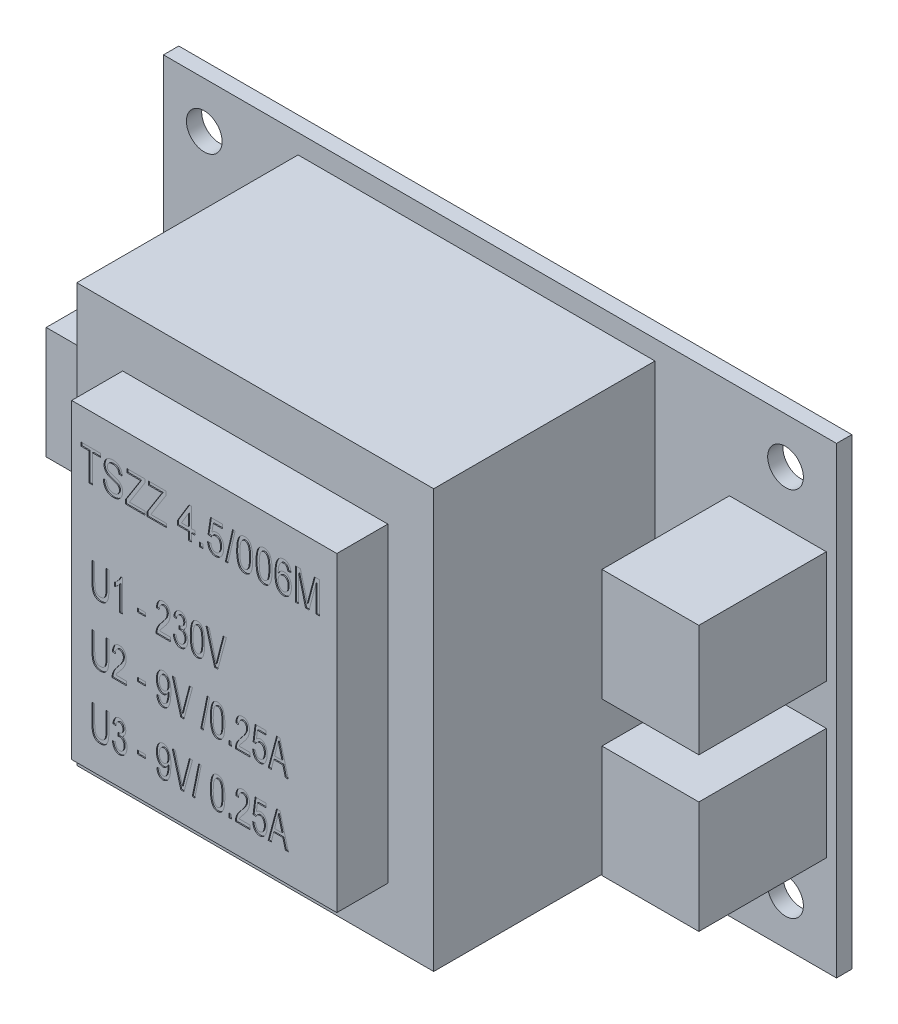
from build123d import *

# Parameters (mm, degrees)
SKICA1_W                 = 66
SKICA1_H                 = 45.4
SKICA1_R                 = 1.75
P_IDAT_VYSUNUT_M1_DEPTH  = 1.5
SKICA2_W                 = 35
SKICA2_H                 = 41
P_IDAT_VYSUNUT_M2_DEPTH  = 23.2
SKICA3_W                 = 26
SKICA3_H                 = 30.5
P_IDAT_VYSUNUT_M3_DEPTH  = 5
SKICA4_W                 = 0.316100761
SKICA4_H                 = 0.395125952
SKICA4_W_2               = 0.790251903
SKICA4_H_2               = 0.355613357
SKICA4_H_3               = 0.355613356
SKICA4_W_3               = 0.276588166
SKICA4_H_4               = 0.395125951
ODEBRAT_VYSUNUT_M1_DEPTH = 0.1
SKICA5_W                 = 9.5
SKICA5_H                 = 11
P_IDAT_VYSUNUT_M4_DEPTH  = 12.5


with BuildPart() as part:
    # Skica1 → P_idat vysunut_m1 (new body)
    with BuildSketch(Plane.XY):
        with Locations((-11.212066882, -13.283333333)):
            Rectangle(SKICA1_W, SKICA1_H)
        with Locations((-40.212066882, 4.916666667)):
            Circle(SKICA1_R, mode=Mode.SUBTRACT)
        with Locations((16.787933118, 4.916666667)):
            Circle(SKICA1_R, mode=Mode.SUBTRACT)
        with Locations((16.787933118, -31.483333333)):
            Circle(SKICA1_R, mode=Mode.SUBTRACT)
        with Locations((-40.212066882, -31.483333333)):
            Circle(SKICA1_R, mode=Mode.SUBTRACT)
    extrude(amount=P_IDAT_VYSUNUT_M1_DEPTH)

    # Skica2 → P_idat vysunut_m2 (add)
    with BuildSketch(Plane.XY):
        with Locations((-13.512066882, -12.983333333)):
            Rectangle(SKICA2_W, SKICA2_H)
    extrude(amount=P_IDAT_VYSUNUT_M2_DEPTH)

    # Skica3 → P_idat vysunut_m3 (add)
    with BuildSketch(Plane.XY.offset(23.2)):
        with Locations((-13.512066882, -12.983333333)):
            Rectangle(SKICA3_W, SKICA3_H)
    extrude(amount=P_IDAT_VYSUNUT_M3_DEPTH)

    # Skica4 → Odebrat vysunut_m1 (cut)
    # profile 1 of 41: a face of its own
    with BuildSketch(Plane.XY.offset(28.2)):
        Polygon((-24.796416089, -3.890209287), (-24.796416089, -1.163840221), (-25.586667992, -1.163840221), (-25.586667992, -0.808226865), (-23.690063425, -0.808226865), (-23.690063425, -1.163840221), (-24.480315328, -1.163840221), (-24.480315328, -3.890209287), align=None)
    # profile 2 of 41: a face of its own
    with BuildSketch(Plane.XY.offset(28.2)):
        with BuildLine():
            Line((-23.413475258, -2.823369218), (-23.097374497, -2.823369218))
            add(Edge.make_bspline(
                [(-23.097374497, -2.823369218), (-23.093434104, -2.862338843), (-23.085887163, -2.936976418), (-23.06571248, -3.043293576), (-23.037831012, -3.138426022), (-23.004544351, -3.22426869), (-22.960001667, -3.29977994), (-22.906861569, -3.367979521), (-22.841904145, -3.427536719), (-22.768495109, -3.480025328), (-22.686546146, -3.52152825), (-22.599082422, -3.552394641), (-22.506254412, -3.570540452), (-22.44261429, -3.572905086), (-22.410225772, -3.574108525)],
                knots=[0, 0, 0, 0, 1.238232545, 2.371556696, 3.415629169, 4.370290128, 5.274348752, 6.177868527, 7.094140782, 8.051105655, 9.02317427, 9.988422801, 10.976243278, 12, 12, 12, 12], degree=3))
            add(Edge.make_bspline(
                [(-22.410225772, -3.574108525), (-22.3817498, -3.573462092), (-22.326067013, -3.572198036), (-22.245457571, -3.556940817), (-22.169279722, -3.535544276), (-22.099495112, -3.503026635), (-22.036388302, -3.462954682), (-21.980794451, -3.416018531), (-21.934404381, -3.361490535), (-21.897912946, -3.300750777), (-21.868849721, -3.236904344), (-21.848503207, -3.170891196), (-21.83560778, -3.103956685), (-21.833848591, -3.058854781), (-21.832971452, -3.036366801)],
                knots=[0, 0, 0, 0, 1.157021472, 2.262475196, 3.327583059, 4.369160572, 5.381932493, 6.36191215, 7.318283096, 8.28046479, 9.236102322, 10.165705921, 11.08541399, 12, 12, 12, 12], degree=3))
            add(Edge.make_bspline(
                [(-21.832971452, -3.036366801), (-21.833552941, -3.014114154), (-21.834683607, -2.970845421), (-21.843740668, -2.908145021), (-21.860280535, -2.850089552), (-21.881986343, -2.795252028), (-21.914581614, -2.744200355), (-21.959335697, -2.697494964), (-22.017273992, -2.655269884), (-22.061860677, -2.632377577), (-22.085481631, -2.620249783)],
                knots=[0, 0, 0, 0, 1.026754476, 1.996453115, 2.913522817, 3.807687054, 4.708683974, 5.68948004, 6.775942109, 8, 8, 8, 8], degree=3))
            add(Edge.make_bspline(
                [(-22.085481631, -2.620249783), (-22.094685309, -2.615795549), (-22.11545296, -2.605744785), (-22.151401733, -2.592411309), (-22.193830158, -2.57518862), (-22.244127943, -2.557422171), (-22.301945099, -2.538656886), (-22.366926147, -2.517505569), (-22.439169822, -2.494686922), (-22.516684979, -2.470839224), (-22.59480951, -2.446335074), (-22.669063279, -2.421864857), (-22.736865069, -2.397008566), (-22.798822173, -2.373206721), (-22.854329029, -2.349081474), (-22.903749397, -2.325632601), (-22.947392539, -2.303182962), (-22.973385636, -2.28663165), (-22.985627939, -2.278836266)],
                knots=[0, 0, 0, 0, 0.50840653, 1.147194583, 1.905773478, 2.786597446, 3.799951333, 4.929893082, 6.18620717, 7.568942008, 8.964503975, 10.259518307, 11.457843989, 12.556747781, 13.560958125, 14.467699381, 15.278312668, 16, 16, 16, 16], degree=3))
            add(Edge.make_bspline(
                [(-22.985627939, -2.278836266), (-23.013480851, -2.259082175), (-23.068073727, -2.220363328), (-23.140508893, -2.152618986), (-23.200860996, -2.0771538), (-23.250027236, -1.995076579), (-23.28768325, -1.906658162), (-23.314845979, -1.813204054), (-23.331293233, -1.714506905), (-23.333382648, -1.647109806), (-23.334450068, -1.612678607)],
                knots=[0, 0, 0, 0, 1.041883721, 2.042135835, 3.016652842, 3.983338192, 4.954506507, 5.942844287, 6.949059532, 8, 8, 8, 8], degree=3))
            add(Edge.make_bspline(
                [(-23.334450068, -1.612678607), (-23.333125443, -1.574521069), (-23.330501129, -1.498924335), (-23.310111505, -1.387771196), (-23.277127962, -1.280657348), (-23.231751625, -1.178295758), (-23.17376315, -1.083383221), (-23.102577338, -0.999355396), (-23.018792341, -0.92830843), (-22.923686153, -0.870428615), (-22.820105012, -0.825135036), (-22.709890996, -0.792019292), (-22.593847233, -0.772828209), (-22.514633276, -0.770099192), (-22.474433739, -0.76871427)],
                knots=[0, 0, 0, 0, 1.013419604, 2.007760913, 2.991946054, 3.985791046, 4.975248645, 5.937294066, 6.899339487, 7.881273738, 8.885117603, 9.895463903, 10.931989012, 12, 12, 12, 12], degree=3))
            add(Edge.make_bspline(
                [(-22.474433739, -0.76871427), (-22.430312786, -0.769946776), (-22.344454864, -0.772345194), (-22.219557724, -0.793098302), (-22.10304672, -0.827676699), (-21.99494638, -0.875240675), (-21.896303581, -0.93566059), (-21.809932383, -1.010765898), (-21.734742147, -1.098030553), (-21.673488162, -1.198129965), (-21.624272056, -1.307369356), (-21.587781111, -1.42448412), (-21.563849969, -1.548583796), (-21.558904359, -1.633974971), (-21.556383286, -1.677503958)],
                knots=[0, 0, 0, 0, 1.092607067, 2.126177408, 3.126395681, 4.096596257, 5.044609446, 5.980936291, 6.921128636, 7.887516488, 8.877926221, 9.882618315, 10.920643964, 12, 12, 12, 12], degree=3))
            Line((-21.556383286, -1.677503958), (-21.872484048, -1.677503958))
            add(Edge.make_bspline(
                [(-21.872484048, -1.677503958), (-21.874861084, -1.655442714), (-21.879504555, -1.612346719), (-21.891285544, -1.550032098), (-21.906597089, -1.491782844), (-21.92571196, -1.437834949), (-21.948519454, -1.388149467), (-21.975325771, -1.342730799), (-22.00549395, -1.30116242), (-22.039677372, -1.263895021), (-22.077643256, -1.230760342), (-22.119986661, -1.202245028), (-22.166620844, -1.17810493), (-22.21756236, -1.158353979), (-22.272792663, -1.143033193), (-22.332049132, -1.131880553), (-22.395700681, -1.125959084), (-22.439437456, -1.124884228), (-22.462086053, -1.124327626)],
                knots=[0, 0, 0, 0, 1.168744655, 2.283108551, 3.337792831, 4.339240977, 5.294973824, 6.213635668, 7.113679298, 7.996244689, 8.872459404, 9.76265184, 10.679263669, 11.633703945, 12.636090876, 13.695169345, 14.806469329, 16, 16, 16, 16], degree=3))
            add(Edge.make_bspline(
                [(-22.462086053, -1.124327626), (-22.485569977, -1.124522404), (-22.530794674, -1.124897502), (-22.596124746, -1.132273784), (-22.656526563, -1.142184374), (-22.712152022, -1.15712083), (-22.762738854, -1.176283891), (-22.809186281, -1.198872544), (-22.849938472, -1.226991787), (-22.886044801, -1.258477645), (-22.916738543, -1.293519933), (-22.943975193, -1.329737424), (-22.967156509, -1.367685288), (-22.985764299, -1.407717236), (-23.000566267, -1.449455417), (-23.011036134, -1.492899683), (-23.017502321, -1.537984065), (-23.018062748, -1.568616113), (-23.018349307, -1.584278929)],
                knots=[0, 0, 0, 0, 1.379823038, 2.657225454, 3.860687, 4.976010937, 6.036705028, 7.037753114, 8.004276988, 8.938764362, 9.847115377, 10.737643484, 11.600874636, 12.456097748, 13.328606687, 14.200192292, 15.079720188, 16, 16, 16, 16], degree=3))
            add(Edge.make_bspline(
                [(-23.018349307, -1.584278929), (-23.017163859, -1.610727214), (-23.014876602, -1.661757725), (-22.997237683, -1.734826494), (-22.967938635, -1.800905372), (-22.938889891, -1.83811947), (-22.924506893, -1.856545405)],
                knots=[0, 0, 0, 0, 1.078005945, 2.079953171, 3.049321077, 4, 4, 4, 4], degree=3))
            add(Edge.make_bspline(
                [(-22.924506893, -1.856545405), (-22.91546996, -1.865651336), (-22.895630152, -1.885642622), (-22.857869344, -1.912280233), (-22.811200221, -1.93951085), (-22.75500687, -1.966160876), (-22.689788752, -1.993228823), (-22.615552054, -2.021128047), (-22.531832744, -2.048585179), (-22.44134048, -2.075234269), (-22.350366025, -2.101875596), (-22.264552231, -2.128458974), (-22.186445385, -2.153682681), (-22.116188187, -2.178221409), (-22.053719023, -2.202132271), (-21.999448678, -2.225624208), (-21.952783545, -2.247663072), (-21.924895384, -2.263067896), (-21.911996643, -2.270192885)],
                knots=[0, 0, 0, 0, 0.558600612, 1.226359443, 2.006748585, 2.91390734, 3.935648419, 5.085850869, 6.37149526, 7.776979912, 9.199666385, 10.505482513, 11.694660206, 12.778932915, 13.750611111, 14.610875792, 15.357506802, 16, 16, 16, 16], degree=3))
            add(Edge.make_bspline(
                [(-21.911996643, -2.270192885), (-21.879909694, -2.291192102), (-21.817185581, -2.332241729), (-21.734855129, -2.406538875), (-21.666261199, -2.489466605), (-21.610788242, -2.58037224), (-21.568783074, -2.679132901), (-21.53841039, -2.78482905), (-21.520381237, -2.897868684), (-21.518059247, -2.975591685), (-21.516870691, -3.015375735)],
                knots=[0, 0, 0, 0, 1.038446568, 2.029973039, 2.992896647, 3.946856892, 4.906526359, 5.893585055, 6.921789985, 8, 8, 8, 8], degree=3))
            add(Edge.make_bspline(
                [(-21.516870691, -3.015375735), (-21.518144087, -3.055592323), (-21.520661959, -3.135112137), (-21.541834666, -3.252713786), (-21.576586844, -3.366315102), (-21.623812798, -3.47563195), (-21.683723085, -3.577009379), (-21.756061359, -3.668284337), (-21.841613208, -3.746211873), (-21.937441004, -3.812454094), (-22.042511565, -3.865250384), (-22.155412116, -3.901851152), (-22.274412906, -3.92594135), (-22.356186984, -3.928445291), (-22.397878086, -3.929721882)],
                knots=[0, 0, 0, 0, 1.018443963, 2.013757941, 3.016678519, 4.02319851, 5.023907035, 5.992190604, 6.962774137, 7.944901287, 8.935999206, 9.930329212, 10.94481409, 12, 12, 12, 12], degree=3))
            add(Edge.make_bspline(
                [(-22.397878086, -3.929721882), (-22.424234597, -3.929442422), (-22.475994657, -3.928893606), (-22.552015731, -3.92232344), (-22.624875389, -3.91286652), (-22.694566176, -3.898459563), (-22.760827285, -3.880224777), (-22.823807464, -3.857568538), (-22.88375312, -3.832053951), (-22.940268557, -3.801521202), (-22.993387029, -3.766829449), (-23.043774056, -3.728276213), (-23.091423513, -3.68571431), (-23.135753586, -3.638617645), (-23.17743457, -3.587809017), (-23.215570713, -3.532746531), (-23.25090187, -3.473684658), (-23.294535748, -3.389569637), (-23.340982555, -3.276939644), (-23.3793639, -3.132991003), (-23.406801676, -2.981184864), (-23.411216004, -2.87679565), (-23.413475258, -2.823369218)],
                knots=[0, 0, 0, 0, 0.931710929, 1.829734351, 2.696277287, 3.528308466, 4.34398118, 5.124249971, 5.89344571, 6.645550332, 7.392355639, 8.134644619, 8.887030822, 9.648859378, 10.419430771, 11.208741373, 12.014945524, 12.851419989, 14.558181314, 16.309504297, 18.111203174, 20, 20, 20, 20], degree=3))
        make_face()
    # profile 3 of 41: a face of its own
    with BuildSketch(Plane.XY.offset(28.2)):
        with BuildLine():
            Line((-21.240282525, -3.890209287), (-21.240282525, -3.519778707))
            Line((-21.240282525, -3.519778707), (-19.999957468, -1.56143571))
            add(Edge.make_bspline(
                [(-19.999957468, -1.56143571), (-19.956951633, -1.493520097), (-19.873017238, -1.360969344), (-19.789022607, -1.228456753), (-19.748064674, -1.163840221)],
                knots=[0, 0, 0, 0, 1.024748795, 2, 2, 2, 2], degree=3))
            Line((-19.748064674, -1.163840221), (-21.082232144, -1.163840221))
            Line((-21.082232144, -1.163840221), (-21.082232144, -0.808226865))
            Line((-21.082232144, -0.808226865), (-19.343677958, -0.808226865))
            Line((-19.343677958, -0.808226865), (-19.343677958, -1.163840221))
            Line((-19.343677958, -1.163840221), (-20.714271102, -3.327154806))
            Line((-20.714271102, -3.327154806), (-20.845156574, -3.53459593))
            Line((-20.845156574, -3.53459593), (-19.304165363, -3.53459593))
            Line((-19.304165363, -3.53459593), (-19.304165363, -3.890209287))
            Line((-19.304165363, -3.890209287), (-21.240282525, -3.890209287))
        make_face()
    # profile 4 of 41: a face of its own
    with BuildSketch(Plane.XY.offset(28.2)):
        with BuildLine():
            Line((-19.146114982, -3.890209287), (-19.146114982, -3.519778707))
            Line((-19.146114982, -3.519778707), (-17.905789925, -1.56143571))
            add(Edge.make_bspline(
                [(-17.905789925, -1.56143571), (-17.86278409, -1.493520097), (-17.778849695, -1.360969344), (-17.694855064, -1.228456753), (-17.653897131, -1.163840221)],
                knots=[0, 0, 0, 0, 1.024748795, 2, 2, 2, 2], degree=3))
            Line((-17.653897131, -1.163840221), (-18.988064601, -1.163840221))
            Line((-18.988064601, -1.163840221), (-18.988064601, -0.808226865))
            Line((-18.988064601, -0.808226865), (-17.249510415, -0.808226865))
            Line((-17.249510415, -0.808226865), (-17.249510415, -1.163840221))
            Line((-17.249510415, -1.163840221), (-18.620103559, -3.327154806))
            Line((-18.620103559, -3.327154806), (-18.75098903, -3.53459593))
            Line((-18.75098903, -3.53459593), (-17.20999782, -3.53459593))
            Line((-17.20999782, -3.53459593), (-17.20999782, -3.890209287))
            Line((-17.20999782, -3.890209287), (-19.146114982, -3.890209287))
        make_face()
    # profile 5 of 41: a face of its own
    with BuildSketch(Plane.XY.offset(28.2)):
        Polygon((-15.076317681, -3.890209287), (-15.076317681, -3.139469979), (-16.14315775, -3.139469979), (-16.14315775, -2.744344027), (-14.997292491, -0.84773946), (-14.76021692, -0.84773946), (-14.76021692, -2.744344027), (-14.444116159, -2.744344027), (-14.444116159, -3.139469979), (-14.76021692, -3.139469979), (-14.76021692, -3.890209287), align=None)
        Polygon((-15.076317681, -2.744344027), (-15.076317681, -1.633669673), (-15.74679703, -2.744344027), align=None, mode=Mode.SUBTRACT)
    # profile 6 of 41: a face of its own
    with BuildSketch(Plane.XY.offset(28.2)):
        with Locations((-13.811914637, -3.692646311)):
            Rectangle(SKICA4_W, SKICA4_H)
    # profile 7 of 41: a face of its own
    with BuildSketch(Plane.XY.offset(28.2)):
        with BuildLine():
            Line((-13.179713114, -3.060444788), (-12.863612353, -3.020932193))
            add(Edge.make_bspline(
                [(-12.863612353, -3.020932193), (-12.860463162, -3.043177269), (-12.854349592, -3.086361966), (-12.843072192, -3.148996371), (-12.827682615, -3.20706649), (-12.811875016, -3.261527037), (-12.79136043, -3.311006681), (-12.770576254, -3.357073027), (-12.745165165, -3.397799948), (-12.71895751, -3.435400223), (-12.689312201, -3.468188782), (-12.656675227, -3.496178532), (-12.622081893, -3.520440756), (-12.584905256, -3.540519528), (-12.544820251, -3.555014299), (-12.502795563, -3.566559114), (-12.457945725, -3.572410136), (-12.427340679, -3.573533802), (-12.411687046, -3.574108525)],
                knots=[0, 0, 0, 0, 1.360445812, 2.641053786, 3.849936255, 4.99693178, 6.070580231, 7.090610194, 8.052267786, 8.972084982, 9.863091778, 10.719987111, 11.570334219, 12.417663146, 13.269378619, 14.14589082, 15.051674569, 16, 16, 16, 16], degree=3))
            add(Edge.make_bspline(
                [(-12.411687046, -3.574108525), (-12.392302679, -3.573551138), (-12.354535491, -3.572465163), (-12.299777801, -3.562990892), (-12.248480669, -3.54755229), (-12.200765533, -3.525569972), (-12.155610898, -3.498546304), (-12.114989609, -3.464055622), (-12.077305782, -3.424012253), (-12.043772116, -3.377705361), (-12.013814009, -3.326450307), (-11.986866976, -3.271311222), (-11.965115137, -3.211774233), (-11.946002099, -3.148659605), (-11.933267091, -3.081083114), (-11.922310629, -3.009910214), (-11.916218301, -2.934604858), (-11.915617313, -2.883059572), (-11.915310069, -2.85670797)],
                knots=[0, 0, 0, 0, 0.949217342, 1.849390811, 2.713837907, 3.566739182, 4.417611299, 5.283938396, 6.168558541, 7.10640631, 8.078329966, 9.075046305, 10.108918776, 11.181031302, 12.302330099, 13.474569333, 14.708918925, 16, 16, 16, 16], degree=3))
            add(Edge.make_bspline(
                [(-11.915310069, -2.85670797), (-11.915668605, -2.83159383), (-11.916366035, -2.782741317), (-11.921673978, -2.711539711), (-11.931977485, -2.644660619), (-11.944386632, -2.581327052), (-11.961869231, -2.522450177), (-11.98206223, -2.467262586), (-12.007013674, -2.416577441), (-12.035142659, -2.36962164), (-12.067015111, -2.327363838), (-12.103528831, -2.291002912), (-12.143842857, -2.259864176), (-12.188466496, -2.234344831), (-12.23732318, -2.215482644), (-12.289531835, -2.200818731), (-12.346227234, -2.193162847), (-12.3853258, -2.191847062), (-12.405513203, -2.191167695)],
                knots=[0, 0, 0, 0, 1.286010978, 2.501573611, 3.652087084, 4.749495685, 5.803284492, 6.793677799, 7.75511211, 8.691265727, 9.593348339, 10.457712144, 11.321883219, 12.19500305, 13.079495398, 13.997260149, 14.965943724, 16, 16, 16, 16], degree=3))
            add(Edge.make_bspline(
                [(-12.405513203, -2.191167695), (-12.430488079, -2.192077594), (-12.478406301, -2.193823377), (-12.546864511, -2.208180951), (-12.608522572, -2.232233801), (-12.662573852, -2.266979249), (-12.710206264, -2.308941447), (-12.753015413, -2.35635093), (-12.791900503, -2.409119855), (-12.81321586, -2.447935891), (-12.824099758, -2.467755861)],
                knots=[0, 0, 0, 0, 1.127033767, 2.162391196, 3.14268086, 4.099289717, 5.047919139, 6.001951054, 6.979770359, 8, 8, 8, 8], degree=3))
            Line((-12.824099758, -2.467755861), (-13.140200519, -2.428243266))
            Line((-13.140200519, -2.428243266), (-12.903124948, -0.84773946))
            Line((-12.903124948, -0.84773946), (-11.717747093, -0.84773946))
            Line((-11.717747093, -0.84773946), (-11.717747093, -1.242865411))
            Line((-11.717747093, -1.242865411), (-12.640736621, -1.242865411))
            Line((-12.640736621, -1.242865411), (-12.757422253, -2.04114331))
            add(Edge.make_bspline(
                [(-12.757422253, -2.04114331), (-12.740164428, -2.024828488), (-12.706505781, -1.99300902), (-12.653371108, -1.9508663), (-12.599341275, -1.915509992), (-12.544993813, -1.886113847), (-12.489460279, -1.863645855), (-12.433348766, -1.8477843), (-12.376689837, -1.837158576), (-12.338676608, -1.836088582), (-12.319696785, -1.835554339)],
                knots=[0, 0, 0, 0, 1.147973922, 2.238940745, 3.273922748, 4.266664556, 5.221996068, 6.163756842, 7.083172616, 8, 8, 8, 8], degree=3))
            add(Edge.make_bspline(
                [(-12.319696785, -1.835554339), (-12.294950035, -1.836386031), (-12.245933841, -1.838033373), (-12.173795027, -1.851166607), (-12.104972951, -1.873841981), (-12.0386943, -1.904074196), (-11.976112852, -1.944164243), (-11.91652773, -1.99289333), (-11.859623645, -2.049952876), (-11.806310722, -2.115102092), (-11.757867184, -2.187084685), (-11.714986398, -2.264421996), (-11.679235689, -2.347238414), (-11.649389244, -2.434665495), (-11.627626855, -2.527642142), (-11.610799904, -2.624892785), (-11.600745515, -2.727463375), (-11.599729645, -2.797416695), (-11.599209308, -2.833247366)],
                knots=[0, 0, 0, 0, 0.868515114, 1.720278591, 2.563417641, 3.407175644, 4.271110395, 5.164836, 6.104908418, 7.095729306, 8.115757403, 9.147388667, 10.195760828, 11.278791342, 12.38634479, 13.544497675, 14.742271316, 16, 16, 16, 16], degree=3))
            add(Edge.make_bspline(
                [(-11.599209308, -2.833247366), (-11.599850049, -2.867424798), (-11.601114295, -2.934860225), (-11.609688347, -3.034306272), (-11.624727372, -3.130119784), (-11.64454738, -3.222599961), (-11.672446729, -3.310937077), (-11.704132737, -3.396441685), (-11.742294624, -3.47838358), (-11.772875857, -3.529894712), (-11.788128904, -3.555586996)],
                knots=[0, 0, 0, 0, 1.084409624, 2.139646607, 3.163799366, 4.16028973, 5.137227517, 6.100164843, 7.052416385, 8, 8, 8, 8], degree=3))
            add(Edge.make_bspline(
                [(-11.788128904, -3.555586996), (-11.807447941, -3.585274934), (-11.844934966, -3.642881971), (-11.910380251, -3.719445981), (-11.981063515, -3.784527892), (-12.057762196, -3.837231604), (-12.139024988, -3.879461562), (-12.226188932, -3.908196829), (-12.318264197, -3.92707874), (-12.381749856, -3.928828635), (-12.414156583, -3.929721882)],
                knots=[0, 0, 0, 0, 1.109957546, 2.153782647, 3.149776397, 4.114796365, 5.064498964, 6.011565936, 6.984989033, 8, 8, 8, 8], degree=3))
            add(Edge.make_bspline(
                [(-12.414156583, -3.929721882), (-12.440536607, -3.929025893), (-12.492508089, -3.927654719), (-12.568488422, -3.916381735), (-12.640901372, -3.897709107), (-12.70957834, -3.871913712), (-12.774624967, -3.838090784), (-12.83559467, -3.796686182), (-12.89291752, -3.747840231), (-12.946389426, -3.692537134), (-12.995238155, -3.630713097), (-13.038151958, -3.563254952), (-13.076365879, -3.491434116), (-13.10729715, -3.414096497), (-13.134938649, -3.332928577), (-13.155660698, -3.246295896), (-13.171236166, -3.155123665), (-13.176852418, -3.092395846), (-13.179713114, -3.060444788)],
                knots=[0, 0, 0, 0, 0.983926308, 1.93844052, 2.858450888, 3.769736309, 4.669529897, 5.587423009, 6.513565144, 7.474727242, 8.453275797, 9.4479593, 10.454310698, 11.483830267, 12.552217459, 13.650993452, 14.803509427, 16, 16, 16, 16], degree=3))
        make_face()
    # profile 8 of 41: a face of its own
    with BuildSketch(Plane.XY.offset(28.2)):
        Polygon((-11.441158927, -3.890209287), (-10.729932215, -0.808226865), (-10.483595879, -0.808226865), (-11.194822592, -3.890209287), align=None)
    # profile 9 of 41: a face of its own
    with BuildSketch(Plane.XY.offset(28.2)):
        with BuildLine():
            add(Edge.make_bspline(
                [(-10.334806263, -2.370209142), (-10.3346415, -2.326164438), (-10.334318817, -2.239904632), (-10.329689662, -2.113731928), (-10.323305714, -1.993883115), (-10.31320195, -1.880476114), (-10.30104721, -1.77339853), (-10.286393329, -1.672438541), (-10.268649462, -1.577845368), (-10.247423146, -1.489376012), (-10.224372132, -1.406353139), (-10.197433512, -1.329353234), (-10.169497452, -1.256954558), (-10.137307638, -1.190823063), (-10.103099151, -1.129459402), (-10.066529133, -1.073447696), (-10.026530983, -1.023135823), (-9.984690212, -0.977603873), (-9.93921184, -0.937861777), (-9.890920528, -0.903352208), (-9.840410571, -0.873282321), (-9.786535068, -0.849851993), (-9.730109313, -0.831254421), (-9.670818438, -0.817702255), (-9.608585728, -0.80943055), (-9.566188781, -0.808633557), (-9.54455436, -0.808226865)],
                knots=[0, 0, 0, 0, 1.624040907, 3.180619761, 4.655181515, 6.049201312, 7.378319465, 8.628604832, 9.810339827, 10.92576736, 11.982743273, 12.985880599, 13.93285104, 14.842476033, 15.695279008, 16.522441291, 17.305837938, 18.062916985, 18.799641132, 19.528309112, 20.249350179, 20.962844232, 21.68996947, 22.437364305, 23.202614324, 24, 24, 24, 24], degree=3))
            add(Edge.make_bspline(
                [(-9.54455436, -0.808226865), (-9.512778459, -0.809400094), (-9.450110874, -0.811713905), (-9.358595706, -0.830459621), (-9.272464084, -0.862743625), (-9.191235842, -0.90572465), (-9.117060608, -0.960982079), (-9.050490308, -1.027052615), (-8.994365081, -1.105300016), (-8.946773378, -1.19406387), (-8.906676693, -1.293334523), (-8.869768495, -1.402016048), (-8.836379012, -1.520882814), (-8.812799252, -1.627123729), (-8.795431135, -1.718827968), (-8.784511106, -1.794646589), (-8.775506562, -1.876422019), (-8.767125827, -1.963851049), (-8.762071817, -2.057165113), (-8.757745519, -2.156154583), (-8.754291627, -2.261114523), (-8.75429878, -2.333163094), (-8.754302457, -2.370209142)],
                knots=[0, 0, 0, 0, 0.975680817, 1.924211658, 2.854359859, 3.793403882, 4.73796525, 5.685716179, 6.663238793, 7.684496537, 8.772901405, 9.948504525, 11.209477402, 12.563831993, 13.290481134, 14.076403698, 14.916314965, 15.817832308, 16.77418998, 17.786721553, 18.861973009, 20, 20, 20, 20], degree=3))
            add(Edge.make_bspline(
                [(-8.754302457, -2.370209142), (-8.754471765, -2.414047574), (-8.754802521, -2.499689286), (-8.759342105, -2.624840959), (-8.766083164, -2.743820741), (-8.775090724, -2.856681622), (-8.787339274, -2.963571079), (-8.802820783, -3.064234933), (-8.820669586, -3.158764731), (-8.840721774, -3.247274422), (-8.864465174, -3.329772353), (-8.890358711, -3.407042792), (-8.918305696, -3.479276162), (-8.950005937, -3.54587086), (-8.984783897, -3.606797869), (-9.020870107, -3.66347014), (-9.060498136, -3.71437877), (-9.103393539, -3.759519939), (-9.148392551, -3.799886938), (-9.196238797, -3.834898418), (-9.247338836, -3.863914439), (-9.301166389, -3.888301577), (-9.358236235, -3.906529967), (-9.417857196, -3.920345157), (-9.480326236, -3.928471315), (-9.522922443, -3.929300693), (-9.54455436, -3.929721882)],
                knots=[0, 0, 0, 0, 1.617957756, 3.160803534, 4.621571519, 6.016248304, 7.339058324, 8.591636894, 9.774472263, 10.889205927, 11.939860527, 12.941486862, 13.896403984, 14.796744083, 15.66068734, 16.484463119, 17.274563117, 18.037544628, 18.779984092, 19.503173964, 20.221079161, 20.945265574, 21.680285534, 22.428376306, 23.201871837, 24, 24, 24, 24], degree=3))
            add(Edge.make_bspline(
                [(-9.54455436, -3.929721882), (-9.573001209, -3.928690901), (-9.628784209, -3.926669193), (-9.710257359, -3.913216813), (-9.786626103, -3.889370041), (-9.858705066, -3.857163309), (-9.925690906, -3.814783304), (-9.987559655, -3.762993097), (-10.045376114, -3.702573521), (-10.078324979, -3.656461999), (-10.095261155, -3.632760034)],
                knots=[0, 0, 0, 0, 1.044554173, 2.048324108, 3.021124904, 3.974837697, 4.939237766, 5.921269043, 6.931503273, 8, 8, 8, 8], degree=3))
            add(Edge.make_bspline(
                [(-10.095261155, -3.632760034), (-10.114766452, -3.597327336), (-10.155447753, -3.523426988), (-10.20309854, -3.40042973), (-10.243604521, -3.263622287), (-10.277627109, -3.11269579), (-10.302604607, -2.94715697), (-10.321986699, -2.767575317), (-10.332789, -2.573667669), (-10.334118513, -2.439574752), (-10.334806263, -2.370209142)],
                knots=[0, 0, 0, 0, 0.746670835, 1.557297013, 2.430697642, 3.381804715, 4.413332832, 5.522361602, 6.71832978, 8, 8, 8, 8], degree=3))
        make_face()
        with BuildLine():
            add(Edge.make_bspline(
                [(-10.018705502, -2.368974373), (-10.018508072, -2.428252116), (-10.018130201, -2.541706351), (-10.010994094, -2.703719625), (-10.000993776, -2.849968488), (-9.986530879, -2.980008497), (-9.967818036, -3.094107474), (-9.944608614, -3.192210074), (-9.917834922, -3.274794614), (-9.885054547, -3.342123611), (-9.848494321, -3.396732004), (-9.811855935, -3.444323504), (-9.771932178, -3.483985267), (-9.730600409, -3.517202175), (-9.686963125, -3.542907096), (-9.641387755, -3.561062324), (-9.593628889, -3.571919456), (-9.561073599, -3.573371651), (-9.54455436, -3.574108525)],
                knots=[0, 0, 0, 0, 2.001547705, 3.83084873, 5.475166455, 6.9509536, 8.247671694, 9.37699334, 10.352740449, 11.173245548, 11.896054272, 12.568966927, 13.197958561, 13.791637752, 14.355399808, 14.901273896, 15.442483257, 16, 16, 16, 16], degree=3))
            add(Edge.make_bspline(
                [(-9.54455436, -3.574108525), (-9.528040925, -3.573356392), (-9.495497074, -3.571874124), (-9.447578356, -3.561221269), (-9.402262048, -3.542164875), (-9.358723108, -3.516551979), (-9.316973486, -3.484233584), (-9.27795116, -3.444037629), (-9.2410099, -3.396692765), (-9.204700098, -3.341449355), (-9.172169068, -3.273868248), (-9.144820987, -3.191266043), (-9.122219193, -3.092976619), (-9.102347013, -2.979060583), (-9.088158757, -2.849134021), (-9.078116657, -2.703311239), (-9.070970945, -2.541500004), (-9.070598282, -2.428251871), (-9.070403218, -2.368974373)],
                knots=[0, 0, 0, 0, 0.557761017, 1.099207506, 1.64792563, 2.211934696, 2.801585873, 3.425956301, 4.09916379, 4.828114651, 5.655226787, 6.624818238, 7.761395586, 9.059854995, 10.529381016, 12.174419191, 13.997575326, 16, 16, 16, 16], degree=3))
            add(Edge.make_bspline(
                [(-9.070403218, -2.368974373), (-9.070690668, -2.31093561), (-9.071241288, -2.199760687), (-9.077224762, -2.040785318), (-9.087832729, -1.897092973), (-9.101144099, -1.768374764), (-9.120526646, -1.655153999), (-9.141874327, -1.556592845), (-9.168610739, -1.473542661), (-9.200058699, -1.404642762), (-9.234501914, -1.347186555), (-9.272089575, -1.29898367), (-9.31057103, -1.256632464), (-9.353330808, -1.223261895), (-9.397766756, -1.196005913), (-9.445650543, -1.177392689), (-9.495854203, -1.16593493), (-9.530293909, -1.164541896), (-9.547641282, -1.163840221)],
                knots=[0, 0, 0, 0, 1.955050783, 3.744956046, 5.357587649, 6.80831804, 8.101858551, 9.225251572, 10.202992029, 11.034332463, 11.771453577, 12.453653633, 13.091209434, 13.69317276, 14.274545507, 14.840970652, 15.416193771, 16, 16, 16, 16], degree=3))
            add(Edge.make_bspline(
                [(-9.547641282, -1.163840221), (-9.563950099, -1.164373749), (-9.596260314, -1.165430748), (-9.643707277, -1.175741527), (-9.688774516, -1.19240695), (-9.731831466, -1.215633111), (-9.771529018, -1.246501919), (-9.810571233, -1.282378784), (-9.84616542, -1.325924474), (-9.867140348, -1.358308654), (-9.877941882, -1.374985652)],
                knots=[0, 0, 0, 0, 0.951136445, 1.884344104, 2.819560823, 3.749746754, 4.727824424, 5.747953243, 6.840255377, 8, 8, 8, 8], degree=3))
            add(Edge.make_bspline(
                [(-9.877941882, -1.374985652), (-9.889331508, -1.399691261), (-9.913699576, -1.452548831), (-9.942207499, -1.541794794), (-9.965615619, -1.644949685), (-9.985252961, -1.762256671), (-10.000255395, -1.893739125), (-10.011345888, -2.039537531), (-10.017071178, -2.199559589), (-10.018145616, -2.310936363), (-10.018705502, -2.368974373)],
                knots=[0, 0, 0, 0, 0.645099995, 1.380189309, 2.217673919, 3.153787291, 4.201108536, 5.356956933, 6.622720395, 8, 8, 8, 8], degree=3))
        make_face(mode=Mode.SUBTRACT)
    # profile 10 of 41: a face of its own
    with BuildSketch(Plane.XY.offset(28.2)):
        with BuildLine():
            add(Edge.make_bspline(
                [(-8.438201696, -2.370209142), (-8.438036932, -2.326164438), (-8.43771425, -2.239904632), (-8.433085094, -2.113731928), (-8.426701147, -1.993883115), (-8.416597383, -1.880476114), (-8.404442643, -1.77339853), (-8.389788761, -1.672438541), (-8.372044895, -1.577845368), (-8.350818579, -1.489376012), (-8.327767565, -1.406353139), (-8.300828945, -1.329353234), (-8.272892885, -1.256954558), (-8.240703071, -1.190823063), (-8.206494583, -1.129459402), (-8.169924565, -1.073447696), (-8.129926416, -1.023135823), (-8.088085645, -0.977603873), (-8.042607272, -0.937861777), (-7.994315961, -0.903352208), (-7.943806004, -0.873282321), (-7.8899305, -0.849851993), (-7.833504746, -0.831254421), (-7.774213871, -0.817702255), (-7.711981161, -0.80943055), (-7.669584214, -0.808633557), (-7.647949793, -0.808226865)],
                knots=[0, 0, 0, 0, 1.624040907, 3.180619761, 4.655181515, 6.049201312, 7.378319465, 8.628604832, 9.810339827, 10.92576736, 11.982743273, 12.985880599, 13.93285104, 14.842476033, 15.695279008, 16.522441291, 17.305837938, 18.062916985, 18.799641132, 19.528309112, 20.249350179, 20.962844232, 21.68996947, 22.437364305, 23.202614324, 24, 24, 24, 24], degree=3))
            add(Edge.make_bspline(
                [(-7.647949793, -0.808226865), (-7.616173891, -0.809400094), (-7.553506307, -0.811713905), (-7.461991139, -0.830459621), (-7.375859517, -0.862743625), (-7.294631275, -0.90572465), (-7.220456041, -0.960982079), (-7.153885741, -1.027052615), (-7.097760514, -1.105300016), (-7.050168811, -1.19406387), (-7.010072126, -1.293334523), (-6.973163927, -1.402016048), (-6.939774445, -1.520882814), (-6.916194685, -1.627123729), (-6.898826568, -1.718827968), (-6.887906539, -1.794646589), (-6.878901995, -1.876422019), (-6.87052126, -1.963851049), (-6.865467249, -2.057165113), (-6.861140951, -2.156154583), (-6.85768706, -2.261114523), (-6.857694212, -2.333163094), (-6.85769789, -2.370209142)],
                knots=[0, 0, 0, 0, 0.975680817, 1.924211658, 2.854359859, 3.793403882, 4.73796525, 5.685716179, 6.663238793, 7.684496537, 8.772901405, 9.948504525, 11.209477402, 12.563831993, 13.290481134, 14.076403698, 14.916314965, 15.817832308, 16.77418998, 17.786721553, 18.861973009, 20, 20, 20, 20], degree=3))
            add(Edge.make_bspline(
                [(-6.85769789, -2.370209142), (-6.857867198, -2.414047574), (-6.858197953, -2.499689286), (-6.862737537, -2.624840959), (-6.869478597, -2.743820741), (-6.878486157, -2.856681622), (-6.890734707, -2.963571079), (-6.906216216, -3.064234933), (-6.924065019, -3.158764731), (-6.944117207, -3.247274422), (-6.967860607, -3.329772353), (-6.993754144, -3.407042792), (-7.021701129, -3.479276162), (-7.05340137, -3.54587086), (-7.088179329, -3.606797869), (-7.12426554, -3.66347014), (-7.163893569, -3.71437877), (-7.206788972, -3.759519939), (-7.251787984, -3.799886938), (-7.299634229, -3.834898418), (-7.350734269, -3.863914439), (-7.404561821, -3.888301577), (-7.461631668, -3.906529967), (-7.521252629, -3.920345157), (-7.583721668, -3.928471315), (-7.626317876, -3.929300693), (-7.647949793, -3.929721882)],
                knots=[0, 0, 0, 0, 1.617957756, 3.160803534, 4.621571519, 6.016248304, 7.339058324, 8.591636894, 9.774472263, 10.889205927, 11.939860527, 12.941486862, 13.896403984, 14.796744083, 15.66068734, 16.484463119, 17.274563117, 18.037544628, 18.779984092, 19.503173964, 20.221079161, 20.945265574, 21.680285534, 22.428376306, 23.201871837, 24, 24, 24, 24], degree=3))
            add(Edge.make_bspline(
                [(-7.647949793, -3.929721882), (-7.676396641, -3.928690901), (-7.732179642, -3.926669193), (-7.813652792, -3.913216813), (-7.890021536, -3.889370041), (-7.962100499, -3.857163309), (-8.029086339, -3.814783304), (-8.090955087, -3.762993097), (-8.148771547, -3.702573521), (-8.181720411, -3.656461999), (-8.198656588, -3.632760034)],
                knots=[0, 0, 0, 0, 1.044554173, 2.048324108, 3.021124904, 3.974837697, 4.939237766, 5.921269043, 6.931503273, 8, 8, 8, 8], degree=3))
            add(Edge.make_bspline(
                [(-8.198656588, -3.632760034), (-8.218161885, -3.597327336), (-8.258843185, -3.523426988), (-8.306493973, -3.40042973), (-8.346999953, -3.263622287), (-8.381022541, -3.11269579), (-8.40600004, -2.94715697), (-8.425382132, -2.767575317), (-8.436184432, -2.573667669), (-8.437513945, -2.439574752), (-8.438201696, -2.370209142)],
                knots=[0, 0, 0, 0, 0.746670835, 1.557297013, 2.430697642, 3.381804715, 4.413332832, 5.522361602, 6.71832978, 8, 8, 8, 8], degree=3))
        make_face()
        with BuildLine():
            add(Edge.make_bspline(
                [(-8.122100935, -2.368974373), (-8.121903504, -2.428252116), (-8.121525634, -2.541706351), (-8.114389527, -2.703719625), (-8.104389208, -2.849968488), (-8.089926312, -2.980008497), (-8.071213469, -3.094107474), (-8.048004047, -3.192210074), (-8.021230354, -3.274794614), (-7.98844998, -3.342123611), (-7.951889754, -3.396732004), (-7.915251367, -3.444323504), (-7.87532761, -3.483985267), (-7.833995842, -3.517202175), (-7.790358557, -3.542907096), (-7.744783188, -3.561062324), (-7.697024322, -3.571919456), (-7.664469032, -3.573371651), (-7.647949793, -3.574108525)],
                knots=[0, 0, 0, 0, 2.001547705, 3.83084873, 5.475166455, 6.9509536, 8.247671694, 9.37699334, 10.352740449, 11.173245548, 11.896054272, 12.568966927, 13.197958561, 13.791637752, 14.355399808, 14.901273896, 15.442483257, 16, 16, 16, 16], degree=3))
            add(Edge.make_bspline(
                [(-7.647949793, -3.574108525), (-7.631436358, -3.573356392), (-7.598892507, -3.571874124), (-7.550973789, -3.561221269), (-7.505657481, -3.542164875), (-7.46211854, -3.516551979), (-7.420368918, -3.484233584), (-7.381346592, -3.444037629), (-7.344405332, -3.396692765), (-7.308095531, -3.341449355), (-7.2755645, -3.273868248), (-7.248216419, -3.191266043), (-7.225614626, -3.092976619), (-7.205742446, -2.979060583), (-7.19155419, -2.849134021), (-7.18151209, -2.703311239), (-7.174366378, -2.541500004), (-7.173993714, -2.428251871), (-7.173798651, -2.368974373)],
                knots=[0, 0, 0, 0, 0.557761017, 1.099207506, 1.64792563, 2.211934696, 2.801585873, 3.425956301, 4.09916379, 4.828114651, 5.655226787, 6.624818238, 7.761395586, 9.059854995, 10.529381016, 12.174419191, 13.997575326, 16, 16, 16, 16], degree=3))
            add(Edge.make_bspline(
                [(-7.173798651, -2.368974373), (-7.174086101, -2.31093561), (-7.17463672, -2.199760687), (-7.180620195, -2.040785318), (-7.191228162, -1.897092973), (-7.204539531, -1.768374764), (-7.223922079, -1.655153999), (-7.24526976, -1.556592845), (-7.272006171, -1.473542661), (-7.303454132, -1.404642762), (-7.337897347, -1.347186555), (-7.375485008, -1.29898367), (-7.413966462, -1.256632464), (-7.456726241, -1.223261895), (-7.501162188, -1.196005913), (-7.549045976, -1.177392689), (-7.599249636, -1.16593493), (-7.633689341, -1.164541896), (-7.651036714, -1.163840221)],
                knots=[0, 0, 0, 0, 1.955050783, 3.744956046, 5.357587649, 6.80831804, 8.101858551, 9.225251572, 10.202992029, 11.034332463, 11.771453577, 12.453653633, 13.091209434, 13.69317276, 14.274545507, 14.840970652, 15.416193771, 16, 16, 16, 16], degree=3))
            add(Edge.make_bspline(
                [(-7.651036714, -1.163840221), (-7.667345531, -1.164373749), (-7.699655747, -1.165430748), (-7.74710271, -1.175741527), (-7.792169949, -1.19240695), (-7.835226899, -1.215633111), (-7.87492445, -1.246501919), (-7.913966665, -1.282378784), (-7.949560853, -1.325924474), (-7.97053578, -1.358308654), (-7.981337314, -1.374985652)],
                knots=[0, 0, 0, 0, 0.951136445, 1.884344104, 2.819560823, 3.749746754, 4.727824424, 5.747953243, 6.840255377, 8, 8, 8, 8], degree=3))
            add(Edge.make_bspline(
                [(-7.981337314, -1.374985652), (-7.992726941, -1.399691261), (-8.017095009, -1.452548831), (-8.045602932, -1.541794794), (-8.069011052, -1.644949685), (-8.088648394, -1.762256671), (-8.103650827, -1.893739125), (-8.114741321, -2.039537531), (-8.120466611, -2.199559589), (-8.121541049, -2.310936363), (-8.122100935, -2.368974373)],
                knots=[0, 0, 0, 0, 0.645099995, 1.380189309, 2.217673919, 3.153787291, 4.201108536, 5.356956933, 6.622720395, 8, 8, 8, 8], degree=3))
        make_face(mode=Mode.SUBTRACT)
    # profile 11 of 41: a face of its own
    with BuildSketch(Plane.XY.offset(28.2)):
        with BuildLine():
            Line((-5.000605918, -1.598478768), (-5.316706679, -1.637991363))
            add(Edge.make_bspline(
                [(-5.316706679, -1.637991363), (-5.3233814, -1.604111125), (-5.335862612, -1.540757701), (-5.361098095, -1.453948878), (-5.389427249, -1.380931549), (-5.415301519, -1.340508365), (-5.427218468, -1.321890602)],
                knots=[0, 0, 0, 0, 1.227849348, 2.2959833, 3.215178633, 4, 4, 4, 4], degree=3))
            add(Edge.make_bspline(
                [(-5.427218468, -1.321890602), (-5.437011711, -1.309288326), (-5.456191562, -1.284607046), (-5.489173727, -1.252757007), (-5.523177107, -1.225317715), (-5.558810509, -1.202510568), (-5.596520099, -1.185384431), (-5.635867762, -1.172840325), (-5.676963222, -1.16520587), (-5.705008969, -1.164299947), (-5.719241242, -1.163840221)],
                knots=[0, 0, 0, 0, 1.108673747, 2.171313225, 3.179350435, 4.14419842, 5.104791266, 6.050773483, 7.01083311, 8, 8, 8, 8], degree=3))
            add(Edge.make_bspline(
                [(-5.719241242, -1.163840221), (-5.742414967, -1.164817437), (-5.788599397, -1.166764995), (-5.85636261, -1.185522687), (-5.922810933, -1.213591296), (-5.963314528, -1.24109795), (-5.984099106, -1.255213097)],
                knots=[0, 0, 0, 0, 0.974346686, 1.94183919, 2.94384671, 4, 4, 4, 4], degree=3))
            add(Edge.make_bspline(
                [(-5.984099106, -1.255213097), (-6.003683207, -1.276724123), (-6.044631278, -1.32170117), (-6.095660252, -1.403027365), (-6.143319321, -1.49644989), (-6.177660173, -1.584195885), (-6.201981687, -1.662797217), (-6.218801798, -1.730101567), (-6.231725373, -1.804893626), (-6.243659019, -1.886377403), (-6.252750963, -1.97495326), (-6.25942785, -2.070697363), (-6.263757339, -2.173637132), (-6.26458308, -2.244670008), (-6.265008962, -2.281305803)],
                knots=[0, 0, 0, 0, 0.959436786, 2.00607046, 3.158503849, 4.422340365, 5.112669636, 5.87616352, 6.712335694, 7.619059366, 8.5966573, 9.653160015, 10.789597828, 12, 12, 12, 12], degree=3))
            add(Edge.make_bspline(
                [(-6.265008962, -2.281305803), (-6.246787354, -2.248759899), (-6.21160255, -2.185915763), (-6.148917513, -2.101788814), (-6.07987656, -2.031006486), (-6.004824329, -1.973799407), (-5.925621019, -1.93019156), (-5.844499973, -1.897806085), (-5.761080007, -1.878715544), (-5.704722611, -1.87628032), (-5.676641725, -1.875066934)],
                knots=[0, 0, 0, 0, 1.187774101, 2.293518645, 3.332355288, 4.329251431, 5.289220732, 6.205072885, 7.105651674, 8, 8, 8, 8], degree=3))
            add(Edge.make_bspline(
                [(-5.676641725, -1.875066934), (-5.652306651, -1.875900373), (-5.60410781, -1.877551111), (-5.533176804, -1.890659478), (-5.465463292, -1.913509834), (-5.399888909, -1.943522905), (-5.338157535, -1.983957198), (-5.278188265, -2.031506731), (-5.222187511, -2.089127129), (-5.168779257, -2.153954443), (-5.120335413, -2.225974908), (-5.077526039, -2.303619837), (-5.040890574, -2.386312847), (-5.0121929, -2.474599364), (-4.989330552, -2.56746433), (-4.972648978, -2.665441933), (-4.962650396, -2.768623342), (-4.961619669, -2.839192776), (-4.961093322, -2.875229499)],
                knots=[0, 0, 0, 0, 0.855537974, 1.694506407, 2.525318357, 3.363943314, 4.223238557, 5.113933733, 6.050496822, 7.042998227, 8.064756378, 9.098137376, 10.157821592, 11.240393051, 12.358572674, 13.518689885, 14.732903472, 16, 16, 16, 16], degree=3))
            add(Edge.make_bspline(
                [(-4.961093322, -2.875229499), (-4.962245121, -2.922828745), (-4.96451286, -3.016545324), (-4.983534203, -3.15470321), (-5.014927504, -3.287657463), (-5.058459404, -3.413996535), (-5.111995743, -3.530851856), (-5.175450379, -3.635192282), (-5.249443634, -3.724299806), (-5.331981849, -3.798440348), (-5.421972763, -3.857375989), (-5.519147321, -3.898936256), (-5.622122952, -3.925629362), (-5.693146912, -3.928345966), (-5.729119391, -3.929721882)],
                knots=[0, 0, 0, 0, 1.180497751, 2.324242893, 3.452406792, 4.564876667, 5.633935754, 6.63570042, 7.585533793, 8.496707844, 9.378972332, 10.241108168, 11.109149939, 12, 12, 12, 12], degree=3))
            add(Edge.make_bspline(
                [(-5.729119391, -3.929721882), (-5.759851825, -3.928637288), (-5.820305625, -3.926503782), (-5.908804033, -3.910119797), (-5.992797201, -3.882738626), (-6.072432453, -3.844681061), (-6.147820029, -3.796280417), (-6.218035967, -3.735951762), (-6.284010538, -3.665179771), (-6.346385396, -3.583904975), (-6.402474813, -3.489707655), (-6.449966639, -3.381408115), (-6.491572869, -3.259890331), (-6.524251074, -3.124004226), (-6.549896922, -2.974455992), (-6.568038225, -2.810977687), (-6.579177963, -2.633782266), (-6.580450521, -2.510990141), (-6.581109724, -2.447382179)],
                knots=[0, 0, 0, 0, 0.770954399, 1.516545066, 2.249888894, 2.98221353, 3.72574418, 4.491543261, 5.299050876, 6.150236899, 7.0581366, 8.042971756, 9.112779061, 10.277742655, 11.54630282, 12.918579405, 14.40378296, 16, 16, 16, 16], degree=3))
            add(Edge.make_bspline(
                [(-6.581109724, -2.447382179), (-6.580304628, -2.375951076), (-6.578751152, -2.238120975), (-6.566226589, -2.038912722), (-6.546583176, -1.854765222), (-6.517603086, -1.685702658), (-6.48110131, -1.531613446), (-6.436118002, -1.392520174), (-6.383495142, -1.2679246), (-6.338903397, -1.193857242), (-6.317486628, -1.158283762)],
                knots=[0, 0, 0, 0, 1.286691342, 2.482739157, 3.594264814, 4.621244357, 5.570781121, 6.444200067, 7.25277182, 8, 8, 8, 8], degree=3))
            add(Edge.make_bspline(
                [(-6.317486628, -1.158283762), (-6.298158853, -1.130416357), (-6.260547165, -1.076186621), (-6.194802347, -1.004913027), (-6.125131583, -0.943324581), (-6.048938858, -0.894559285), (-5.968580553, -0.855745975), (-5.883194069, -0.827514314), (-5.792488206, -0.81151463), (-5.730415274, -0.809334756), (-5.69886756, -0.808226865)],
                knots=[0, 0, 0, 0, 1.093651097, 2.128235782, 3.121974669, 4.087599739, 5.038485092, 5.996515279, 6.981756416, 8, 8, 8, 8], degree=3))
            add(Edge.make_bspline(
                [(-5.69886756, -0.808226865), (-5.675167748, -0.808759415), (-5.628581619, -0.809806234), (-5.560444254, -0.819837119), (-5.495775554, -0.836718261), (-5.434128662, -0.859493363), (-5.376027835, -0.8893131), (-5.321095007, -0.92545248), (-5.26965664, -0.968427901), (-5.221677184, -1.017683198), (-5.177956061, -1.072899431), (-5.137987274, -1.132951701), (-5.103930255, -1.198681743), (-5.073104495, -1.26878936), (-5.048374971, -1.344218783), (-5.027012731, -1.424304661), (-5.011164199, -1.509593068), (-5.004180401, -1.568386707), (-5.000605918, -1.598478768)],
                knots=[0, 0, 0, 0, 0.972976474, 1.912555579, 2.820776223, 3.714124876, 4.60627306, 5.497138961, 6.409480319, 7.353913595, 8.316257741, 9.298552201, 10.311887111, 11.352974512, 12.440877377, 13.568510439, 14.755502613, 16, 16, 16, 16], degree=3))
        make_face()
        with BuildLine():
            add(Edge.make_bspline(
                [(-6.265008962, -2.867203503), (-6.264148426, -2.898114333), (-6.262443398, -2.959359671), (-6.249662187, -3.050328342), (-6.228866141, -3.139303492), (-6.199273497, -3.224729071), (-6.163955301, -3.304526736), (-6.120944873, -3.374737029), (-6.073288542, -3.435517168), (-6.020046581, -3.486307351), (-5.960661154, -3.525757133), (-5.8961127, -3.553847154), (-5.826332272, -3.57117527), (-5.777994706, -3.573113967), (-5.753197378, -3.574108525)],
                knots=[0, 0, 0, 0, 1.146574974, 2.271772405, 3.401520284, 4.531577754, 5.621640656, 6.632590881, 7.578225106, 8.48028392, 9.350666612, 10.208907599, 11.081163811, 12, 12, 12, 12], degree=3))
            add(Edge.make_bspline(
                [(-5.753197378, -3.574108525), (-5.735663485, -3.573514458), (-5.701405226, -3.572353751), (-5.651300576, -3.563245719), (-5.603593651, -3.549426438), (-5.558825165, -3.52876343), (-5.517035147, -3.502230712), (-5.477159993, -3.470891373), (-5.440826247, -3.432620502), (-5.406937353, -3.389415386), (-5.376050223, -3.341397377), (-5.34961501, -3.288750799), (-5.327273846, -3.231883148), (-5.308830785, -3.170990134), (-5.294897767, -3.105890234), (-5.284216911, -3.036867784), (-5.278088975, -2.963627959), (-5.277496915, -2.913312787), (-5.277194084, -2.887577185)],
                knots=[0, 0, 0, 0, 0.89972895, 1.75791809, 2.607082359, 3.443995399, 4.279573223, 5.144307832, 6.041053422, 6.981734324, 7.960745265, 8.967310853, 10.001398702, 11.094486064, 12.230304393, 13.416893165, 14.678772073, 16, 16, 16, 16], degree=3))
            add(Edge.make_bspline(
                [(-5.277194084, -2.887577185), (-5.277467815, -2.86286576), (-5.278002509, -2.814595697), (-5.284551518, -2.744118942), (-5.293934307, -2.677599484), (-5.308241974, -2.615240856), (-5.326854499, -2.557095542), (-5.348946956, -2.502703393), (-5.374811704, -2.45223616), (-5.405248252, -2.406432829), (-5.438986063, -2.365295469), (-5.475616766, -2.328744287), (-5.516043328, -2.298428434), (-5.559582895, -2.273528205), (-5.606440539, -2.254067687), (-5.656552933, -2.2410201), (-5.709630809, -2.231607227), (-5.746155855, -2.230994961), (-5.76492768, -2.23068029)],
                knots=[0, 0, 0, 0, 1.285738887, 2.511498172, 3.680927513, 4.780007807, 5.836888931, 6.855292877, 7.832593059, 8.783233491, 9.71171114, 10.597892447, 11.469782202, 12.33334224, 13.202596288, 14.101630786, 15.02434471, 16, 16, 16, 16], degree=3))
            add(Edge.make_bspline(
                [(-5.76492768, -2.23068029), (-5.782053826, -2.231023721), (-5.815918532, -2.231702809), (-5.86549972, -2.241082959), (-5.913320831, -2.254240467), (-5.958956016, -2.273956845), (-6.002817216, -2.29850247), (-6.044460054, -2.329012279), (-6.083466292, -2.36551948), (-6.120924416, -2.406233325), (-6.154560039, -2.451919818), (-6.184663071, -2.500827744), (-6.20908841, -2.553644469), (-6.22975532, -2.60974498), (-6.245630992, -2.669268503), (-6.25662287, -2.73228776), (-6.263553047, -2.798519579), (-6.264515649, -2.843931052), (-6.265008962, -2.867203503)],
                knots=[0, 0, 0, 0, 0.909066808, 1.797560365, 2.673642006, 3.54128144, 4.432800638, 5.340879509, 6.277696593, 7.268951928, 8.277621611, 9.288898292, 10.31661003, 11.365302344, 12.4639335, 13.586274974, 14.763015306, 16, 16, 16, 16], degree=3))
        make_face(mode=Mode.SUBTRACT)
    # profile 12 of 41: a face of its own
    with BuildSketch(Plane.XY.offset(28.2)):
        with BuildLine():
            Line((-4.565967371, -3.890209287), (-4.565967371, -0.808226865))
            Line((-4.565967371, -0.808226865), (-4.082555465, -0.808226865))
            Line((-4.082555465, -0.808226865), (-3.514561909, -2.970924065))
            add(Edge.make_bspline(
                [(-3.514561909, -2.970924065), (-3.50810793, -2.99539456), (-3.495645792, -3.042645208), (-3.478799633, -3.111393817), (-3.461716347, -3.174771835), (-3.447000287, -3.233709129), (-3.433546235, -3.287864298), (-3.420919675, -3.337137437), (-3.410705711, -3.381962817), (-3.403682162, -3.410100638), (-3.400345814, -3.423466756)],
                knots=[0, 0, 0, 0, 1.301279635, 2.512671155, 3.639438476, 4.676308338, 5.636179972, 6.508790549, 7.291640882, 8, 8, 8, 8], degree=3))
            add(Edge.make_bspline(
                [(-3.400345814, -3.423466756), (-3.396880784, -3.40884716), (-3.389501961, -3.377714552), (-3.377145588, -3.328787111), (-3.363464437, -3.274894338), (-3.348828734, -3.216143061), (-3.331941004, -3.152661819), (-3.314109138, -3.084113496), (-3.294949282, -3.010650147), (-3.281803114, -2.960018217), (-3.275016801, -2.933881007)],
                knots=[0, 0, 0, 0, 0.713491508, 1.519388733, 2.396397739, 3.353996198, 4.394619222, 5.515827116, 6.717620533, 8, 8, 8, 8], degree=3))
            Line((-3.275016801, -2.933881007), (-2.712579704, -0.808226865))
            Line((-2.712579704, -0.808226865), (-2.234724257, -0.808226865))
            Line((-2.234724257, -0.808226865), (-2.234724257, -3.890209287))
            Line((-2.234724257, -3.890209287), (-2.550825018, -3.890209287))
            Line((-2.550825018, -3.890209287), (-2.550825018, -1.282378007))
            Line((-2.550825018, -1.282378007), (-3.229330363, -3.890209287))
            Line((-3.229330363, -3.890209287), (-3.576917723, -3.890209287))
            Line((-3.576917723, -3.890209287), (-4.24986661, -1.282378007))
            Line((-4.24986661, -1.282378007), (-4.24986661, -3.890209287))
            Line((-4.24986661, -3.890209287), (-4.565967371, -3.890209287))
        make_face()
    # profile 13 of 41: a face of its own
    with BuildSketch(Plane.XY.offset(28.2)):
        with BuildLine():
            Line((-23.144491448, -10.305333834), (-22.867903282, -10.305333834))
            Line((-22.867903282, -10.305333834), (-22.867903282, -12.078461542))
            add(Edge.make_bspline(
                [(-22.867903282, -12.078461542), (-22.868186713, -12.116123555), (-22.868738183, -12.189402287), (-22.871665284, -12.29625004), (-22.877211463, -12.397126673), (-22.885043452, -12.492064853), (-22.895692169, -12.580967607), (-22.907729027, -12.664039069), (-22.922677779, -12.741004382), (-22.939022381, -12.812687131), (-22.959151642, -12.879657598), (-22.982258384, -12.943142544), (-23.009817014, -13.003119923), (-23.039786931, -13.060496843), (-23.074739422, -13.113917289), (-23.112261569, -13.16518074), (-23.154540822, -13.212352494), (-23.199342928, -13.257127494), (-23.248068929, -13.2974039), (-23.300833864, -13.332222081), (-23.357356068, -13.361025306), (-23.417059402, -13.385654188), (-23.480940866, -13.40377879), (-23.548195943, -13.417421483), (-23.619261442, -13.425648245), (-23.667805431, -13.426428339), (-23.692728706, -13.426828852)],
                knots=[0, 0, 0, 0, 1.510753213, 2.939462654, 4.287075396, 5.562865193, 6.759838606, 7.878260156, 8.928981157, 9.904118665, 10.826057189, 11.732340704, 12.61160361, 13.47206496, 14.326167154, 15.169833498, 16.017850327, 16.864258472, 17.708772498, 18.549039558, 19.394521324, 20.249899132, 21.135494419, 22.053432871, 23.000600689, 24, 24, 24, 24], degree=3))
            add(Edge.make_bspline(
                [(-23.692728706, -13.426828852), (-23.716821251, -13.426315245), (-23.76407418, -13.425307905), (-23.833444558, -13.418560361), (-23.899274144, -13.406899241), (-23.961867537, -13.39072532), (-24.021103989, -13.369982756), (-24.076899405, -13.34369818), (-24.129508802, -13.313567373), (-24.178783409, -13.278703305), (-24.224195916, -13.239148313), (-24.266588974, -13.195783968), (-24.304932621, -13.147815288), (-24.340026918, -13.095881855), (-24.37229901, -13.040017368), (-24.401389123, -12.980058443), (-24.426657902, -12.915631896), (-24.448256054, -12.846665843), (-24.466591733, -12.77233658), (-24.483465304, -12.692325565), (-24.496789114, -12.605517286), (-24.507527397, -12.512600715), (-24.517250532, -12.413232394), (-24.522933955, -12.307359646), (-24.526793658, -12.194970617), (-24.527215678, -12.117977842), (-24.527432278, -12.078461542)],
                knots=[0, 0, 0, 0, 0.958985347, 1.880866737, 2.771086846, 3.617488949, 4.451753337, 5.265330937, 6.069033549, 6.86227319, 7.663718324, 8.463151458, 9.272967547, 10.104533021, 10.955993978, 11.838948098, 12.754694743, 13.708100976, 14.713409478, 15.80105228, 16.961959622, 18.207659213, 19.524073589, 20.935420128, 22.427114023, 24, 24, 24, 24], degree=3))
            Line((-24.527432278, -12.078461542), (-24.527432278, -10.305333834))
            Line((-24.527432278, -10.305333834), (-24.250844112, -10.305333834))
            Line((-24.250844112, -10.305333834), (-24.250844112, -12.05808786))
            add(Edge.make_bspline(
                [(-24.250844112, -12.05808786), (-24.250778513, -12.089987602), (-24.250651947, -12.151534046), (-24.248200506, -12.24067024), (-24.243831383, -12.323409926), (-24.238250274, -12.399767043), (-24.232037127, -12.469686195), (-24.222427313, -12.532820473), (-24.212179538, -12.589503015), (-24.197068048, -12.655303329), (-24.172197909, -12.728610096), (-24.132295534, -12.807041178), (-24.083458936, -12.875300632), (-24.024793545, -12.931998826), (-23.958264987, -12.977127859), (-23.883842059, -13.008817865), (-23.802821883, -13.028560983), (-23.746351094, -13.03063863), (-23.717424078, -13.0317029)],
                knots=[0, 0, 0, 0, 1.215998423, 2.346112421, 3.39877416, 4.374111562, 5.264785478, 6.073580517, 6.807537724, 7.460229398, 8.646094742, 9.74777798, 10.803854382, 11.830229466, 12.841989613, 13.850459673, 14.898903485, 16, 16, 16, 16], degree=3))
            add(Edge.make_bspline(
                [(-23.717424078, -13.0317029), (-23.69249769, -13.031132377), (-23.644312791, -13.030029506), (-23.574673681, -13.020954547), (-23.510853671, -13.004650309), (-23.452035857, -12.983383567), (-23.399207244, -12.954855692), (-23.352253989, -12.919638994), (-23.310566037, -12.878649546), (-23.273712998, -12.830513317), (-23.242486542, -12.772819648), (-23.216587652, -12.704324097), (-23.193730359, -12.624865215), (-23.175593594, -12.533773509), (-23.161828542, -12.431054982), (-23.151419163, -12.316951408), (-23.145306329, -12.191304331), (-23.144770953, -12.103781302), (-23.144491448, -12.05808786)],
                knots=[0, 0, 0, 0, 0.920771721, 1.779932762, 2.587626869, 3.350261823, 4.085101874, 4.796762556, 5.511826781, 6.238717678, 7.028169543, 7.926151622, 8.939204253, 10.079911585, 11.354099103, 12.766616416, 14.311936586, 16, 16, 16, 16], degree=3))
            Line((-23.144491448, -12.05808786), (-23.144491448, -10.305333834))
        make_face()
    # profile 14 of 41: a face of its own
    with BuildSketch(Plane.XY.offset(28.2)):
        with BuildLine():
            Line((-21.524475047, -13.387316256), (-21.801063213, -13.387316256))
            Line((-21.801063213, -13.387316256), (-21.801063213, -10.985691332))
            add(Edge.make_bspline(
                [(-21.801063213, -10.985691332), (-21.817457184, -11.007520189), (-21.851109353, -11.052328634), (-21.908595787, -11.117383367), (-21.973190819, -11.182427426), (-22.043425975, -11.245924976), (-22.115505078, -11.304688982), (-22.184307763, -11.358508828), (-22.250269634, -11.403040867), (-22.294006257, -11.428177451), (-22.31472695, -11.440086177)],
                knots=[0, 0, 0, 0, 0.94864864, 1.947306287, 3.01462516, 4.1338992, 5.236683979, 6.246830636, 7.169417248, 8, 8, 8, 8], degree=3))
            Line((-22.31472695, -11.440086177), (-22.31472695, -11.07582944))
            add(Edge.make_bspline(
                [(-22.31472695, -11.07582944), (-22.279116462, -11.050237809), (-22.208072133, -10.999181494), (-22.109070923, -10.912891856), (-22.017407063, -10.818385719), (-21.933197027, -10.717878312), (-21.858777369, -10.613629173), (-21.794030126, -10.510433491), (-21.742089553, -10.408017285), (-21.715714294, -10.338911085), (-21.702899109, -10.305333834)],
                knots=[0, 0, 0, 0, 1.052977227, 2.100731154, 3.149499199, 4.21285755, 5.247266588, 6.224030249, 7.137093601, 8, 8, 8, 8], degree=3))
            Line((-21.702899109, -10.305333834), (-21.524475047, -10.305333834))
            Line((-21.524475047, -10.305333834), (-21.524475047, -13.387316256))
        make_face()
    # profile 15 of 41: a face of its own
    with BuildSketch(Plane.XY.offset(28.2)):
        with Locations((-19.667383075, -12.30071989)):
            Rectangle(SKICA4_W_2, SKICA4_H_2)
    # profile 16 of 41: a face of its own
    with BuildSketch(Plane.XY.offset(28.2)):
        with BuildLine():
            Line((-16.822476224, -12.992190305), (-16.822476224, -13.387316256))
            Line((-16.822476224, -13.387316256), (-18.244929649, -13.387316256))
            add(Edge.make_bspline(
                [(-18.244929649, -13.387316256), (-18.244487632, -13.341075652), (-18.243616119, -13.249904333), (-18.226298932, -13.16039581), (-18.21776474, -13.116284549)],
                knots=[0, 0, 0, 0, 1.01436734, 2, 2, 2, 2], degree=3))
            add(Edge.make_bspline(
                [(-18.21776474, -13.116284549), (-18.209020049, -13.080537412), (-18.191504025, -13.00893423), (-18.155740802, -12.903635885), (-18.112862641, -12.799917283), (-18.063126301, -12.695249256), (-18.00073356, -12.589092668), (-17.924607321, -12.478114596), (-17.833932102, -12.361174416), (-17.766045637, -12.283293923), (-17.730648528, -12.242685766)],
                knots=[0, 0, 0, 0, 0.872384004, 1.74742583, 2.633771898, 3.533069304, 4.493146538, 5.550322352, 6.722698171, 8, 8, 8, 8], degree=3))
            add(Edge.make_bspline(
                [(-17.730648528, -12.242685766), (-17.70250116, -12.209064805), (-17.648129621, -12.144120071), (-17.572151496, -12.048197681), (-17.501493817, -11.959506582), (-17.439841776, -11.8754503), (-17.383653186, -11.798435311), (-17.335554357, -11.726918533), (-17.294713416, -11.661352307), (-17.249655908, -11.583547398), (-17.205421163, -11.490336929), (-17.167265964, -11.379402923), (-17.142955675, -11.270334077), (-17.140015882, -11.19777679), (-17.138576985, -11.162263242)],
                knots=[0, 0, 0, 0, 1.256312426, 2.426786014, 3.506137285, 4.505047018, 5.413308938, 6.237580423, 6.973887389, 7.626291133, 8.813269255, 9.922802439, 10.983304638, 12, 12, 12, 12], degree=3))
            add(Edge.make_bspline(
                [(-17.138576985, -11.162263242), (-17.139860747, -11.128418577), (-17.142350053, -11.062791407), (-17.162206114, -10.968135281), (-17.196489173, -10.882023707), (-17.235846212, -10.817567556), (-17.272819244, -10.771889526), (-17.302981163, -10.742423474), (-17.334908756, -10.717107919), (-17.369167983, -10.696625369), (-17.405435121, -10.680550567), (-17.443857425, -10.669367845), (-17.484062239, -10.662444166), (-17.511654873, -10.661451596), (-17.52567694, -10.660947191)],
                knots=[0, 0, 0, 0, 1.72498268, 3.344861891, 4.903902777, 6.430209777, 7.175991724, 7.895848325, 8.576057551, 9.249186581, 9.925824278, 10.59328458, 11.285133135, 12, 12, 12, 12], degree=3))
            add(Edge.make_bspline(
                [(-17.52567694, -10.660947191), (-17.540520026, -10.661455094), (-17.569745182, -10.662455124), (-17.612213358, -10.669307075), (-17.652506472, -10.68043733), (-17.690470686, -10.69667502), (-17.726271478, -10.717744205), (-17.75979391, -10.743274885), (-17.791062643, -10.773151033), (-17.819079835, -10.807941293), (-17.845249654, -10.846041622), (-17.867496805, -10.888342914), (-17.885784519, -10.934212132), (-17.901290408, -10.983314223), (-17.913754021, -11.035895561), (-17.92201588, -11.092298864), (-17.927875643, -11.152057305), (-17.928506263, -11.193117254), (-17.928828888, -11.214123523)],
                knots=[0, 0, 0, 0, 0.926742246, 1.824700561, 2.679114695, 3.531302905, 4.395328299, 5.266682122, 6.157438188, 7.088802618, 8.051215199, 9.040037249, 10.066235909, 11.131136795, 12.253354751, 13.436609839, 14.688569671, 16, 16, 16, 16], degree=3))
            Line((-17.928828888, -11.214123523), (-18.205417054, -11.174610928))
            add(Edge.make_bspline(
                [(-18.205417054, -11.174610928), (-18.202683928, -11.140207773), (-18.197382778, -11.073479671), (-18.183829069, -10.97675239), (-18.165430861, -10.886393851), (-18.142136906, -10.802123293), (-18.113587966, -10.72421105), (-18.081268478, -10.652175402), (-18.04322451, -10.587079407), (-18.001261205, -10.527809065), (-17.954457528, -10.475640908), (-17.904011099, -10.429735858), (-17.849337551, -10.391421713), (-17.791078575, -10.359548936), (-17.728543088, -10.3353615), (-17.662434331, -10.318319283), (-17.592504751, -10.307427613), (-17.544651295, -10.30604341), (-17.520120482, -10.305333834)],
                knots=[0, 0, 0, 0, 1.339079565, 2.597268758, 3.787627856, 4.915364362, 5.986599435, 7.00512538, 7.974925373, 8.907955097, 9.818567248, 10.689402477, 11.549107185, 12.403192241, 13.260408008, 14.143714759, 15.048424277, 16, 16, 16, 16], degree=3))
            add(Edge.make_bspline(
                [(-17.520120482, -10.305333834), (-17.495373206, -10.305947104), (-17.447024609, -10.307145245), (-17.376607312, -10.319406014), (-17.31009719, -10.338520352), (-17.247174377, -10.364966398), (-17.188779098, -10.400172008), (-17.13412374, -10.442269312), (-17.08369164, -10.492358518), (-17.037858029, -10.549528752), (-16.996939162, -10.612509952), (-16.960113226, -10.679075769), (-16.930070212, -10.749781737), (-16.905303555, -10.823929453), (-16.885243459, -10.901622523), (-16.872353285, -10.98330836), (-16.862940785, -11.068407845), (-16.862310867, -11.126426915), (-16.861988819, -11.156089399)],
                knots=[0, 0, 0, 0, 0.985756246, 1.925865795, 2.839835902, 3.740451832, 4.638148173, 5.550570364, 6.484610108, 7.464819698, 8.466057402, 9.475730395, 10.493768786, 11.52377059, 12.59034081, 13.688258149, 14.818112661, 16, 16, 16, 16], degree=3))
            add(Edge.make_bspline(
                [(-16.861988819, -11.156089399), (-16.862635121, -11.186565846), (-16.863925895, -11.247432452), (-16.872732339, -11.338411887), (-16.887538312, -11.428758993), (-16.908739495, -11.518642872), (-16.936217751, -11.609497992), (-16.971420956, -11.701947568), (-17.015288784, -11.796713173), (-17.057388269, -11.877668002), (-17.097426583, -11.945194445), (-17.132525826, -12.000648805), (-17.173090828, -12.06020517), (-17.218458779, -12.124107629), (-17.269593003, -12.192066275), (-17.324709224, -12.265022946), (-17.386157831, -12.341383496), (-17.42891296, -12.393567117), (-17.45097344, -12.420492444)],
                knots=[0, 0, 0, 0, 1.025126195, 2.047349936, 3.071610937, 4.102610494, 5.151581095, 6.262412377, 7.427155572, 8.662656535, 9.329886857, 10.06736086, 10.869932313, 11.753531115, 12.703312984, 13.730657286, 14.829081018, 16, 16, 16, 16], degree=3))
            add(Edge.make_bspline(
                [(-17.45097344, -12.420492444), (-17.469893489, -12.442523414), (-17.506119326, -12.48470567), (-17.558258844, -12.54500592), (-17.604172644, -12.600490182), (-17.645182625, -12.650041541), (-17.680885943, -12.693958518), (-17.71214723, -12.731978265), (-17.73704022, -12.76539755), (-17.77600457, -12.816628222), (-17.824341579, -12.890332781), (-17.858848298, -12.958723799), (-17.875733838, -12.992190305)],
                knots=[0, 0, 0, 0, 1.219403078, 2.334766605, 3.34712693, 4.243325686, 5.035549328, 5.723822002, 6.309712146, 6.784983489, 8.426761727, 10, 10, 10, 10], degree=3))
            Line((-17.875733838, -12.992190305), (-16.822476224, -12.992190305))
        make_face()
    # profile 17 of 41: a face of its own
    with BuildSketch(Plane.XY.offset(28.2)):
        with BuildLine():
            Line((-16.545888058, -12.557551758), (-16.269299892, -12.518039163))
            add(Edge.make_bspline(
                [(-16.269299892, -12.518039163), (-16.265418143, -12.541750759), (-16.257929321, -12.587496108), (-16.243244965, -12.653249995), (-16.228484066, -12.714045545), (-16.210815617, -12.769589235), (-16.192141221, -12.820105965), (-16.170898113, -12.865310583), (-16.148869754, -12.905833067), (-16.12474793, -12.941262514), (-16.098400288, -12.972291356), (-16.069413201, -12.998605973), (-16.038215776, -13.021515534), (-16.004023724, -13.039065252), (-15.967886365, -13.053516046), (-15.929409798, -13.064054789), (-15.888377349, -13.070350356), (-15.860202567, -13.0709225), (-15.845774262, -13.071215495)],
                knots=[0, 0, 0, 0, 1.496859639, 2.887800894, 4.197198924, 5.393656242, 6.517833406, 7.550518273, 8.503362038, 9.389032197, 10.216631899, 11.033531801, 11.823620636, 12.620960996, 13.421080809, 14.245495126, 15.101518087, 16, 16, 16, 16], degree=3))
            add(Edge.make_bspline(
                [(-15.845774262, -13.071215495), (-15.828849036, -13.070896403), (-15.795789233, -13.070273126), (-15.747856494, -13.060840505), (-15.702273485, -13.04787614), (-15.660103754, -13.027420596), (-15.620115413, -13.002684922), (-15.582924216, -12.972224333), (-15.548767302, -12.936085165), (-15.518179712, -12.894560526), (-15.490654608, -12.849218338), (-15.466696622, -12.800735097), (-15.44536291, -12.750230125), (-15.428812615, -12.696607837), (-15.415899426, -12.640466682), (-15.406729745, -12.581666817), (-15.401017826, -12.520210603), (-15.400359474, -12.478333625), (-15.400022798, -12.456918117)],
                knots=[0, 0, 0, 0, 0.956033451, 1.86740651, 2.755264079, 3.630430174, 4.509307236, 5.411407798, 6.342214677, 7.315747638, 8.32430992, 9.339839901, 10.373567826, 11.423242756, 12.510797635, 13.630787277, 14.78840606, 16, 16, 16, 16], degree=3))
            add(Edge.make_bspline(
                [(-15.400022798, -12.456918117), (-15.400359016, -12.436531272), (-15.401015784, -12.396707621), (-15.40671874, -12.338325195), (-15.415882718, -12.282819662), (-15.428650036, -12.229810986), (-15.446388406, -12.179931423), (-15.466223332, -12.1319632), (-15.491496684, -12.087596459), (-15.518893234, -12.045577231), (-15.549402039, -12.007638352), (-15.582390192, -11.974335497), (-15.617676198, -11.946762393), (-15.654588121, -11.923078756), (-15.694068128, -11.905606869), (-15.735341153, -11.89211512), (-15.778834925, -11.884795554), (-15.808500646, -11.883848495), (-15.823548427, -11.883368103)],
                knots=[0, 0, 0, 0, 1.232122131, 2.406826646, 3.541867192, 4.631057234, 5.697199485, 6.739339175, 7.763957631, 8.778330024, 9.769163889, 10.701580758, 11.604999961, 12.471343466, 13.345422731, 14.207019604, 15.090520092, 16, 16, 16, 16], degree=3))
            add(Edge.make_bspline(
                [(-15.823548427, -11.883368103), (-15.836962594, -11.883848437), (-15.865447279, -11.884868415), (-15.910157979, -11.893910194), (-15.959614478, -11.906536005), (-15.993426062, -11.918859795), (-16.011233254, -11.925350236)],
                knots=[0, 0, 0, 0, 0.832176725, 1.76710878, 2.824026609, 4, 4, 4, 4], degree=3))
            Line((-16.011233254, -11.925350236), (-15.981598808, -11.569736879))
            add(Edge.make_bspline(
                [(-15.981598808, -11.569736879), (-15.973586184, -11.570901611), (-15.959649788, -11.572927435), (-15.945592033, -11.573721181), (-15.939616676, -11.574058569)],
                knots=[0, 0, 0, 0, 1.149884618, 2, 2, 2, 2], degree=3))
            add(Edge.make_bspline(
                [(-15.939616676, -11.574058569), (-15.913117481, -11.57264391), (-15.860655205, -11.569843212), (-15.784433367, -11.54694472), (-15.712391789, -11.510633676), (-15.65729245, -11.468689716), (-15.616998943, -11.428200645), (-15.590661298, -11.392959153), (-15.567959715, -11.353868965), (-15.549526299, -11.311005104), (-15.536285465, -11.263753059), (-15.525581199, -11.213292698), (-15.51942874, -11.158710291), (-15.518855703, -11.121119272), (-15.518560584, -11.101759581)],
                knots=[0, 0, 0, 0, 1.338367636, 2.649658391, 3.990493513, 5.402161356, 6.130960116, 6.874261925, 7.620619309, 8.41344784, 9.227121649, 10.098922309, 11.020928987, 12, 12, 12, 12], degree=3))
            add(Edge.make_bspline(
                [(-15.518560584, -11.101759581), (-15.519756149, -11.071219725), (-15.522055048, -11.01249598), (-15.539334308, -10.928300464), (-15.569252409, -10.852449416), (-15.610425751, -10.785952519), (-15.660359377, -10.730299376), (-15.719445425, -10.69017149), (-15.785658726, -10.665329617), (-15.832388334, -10.662429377), (-15.856269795, -10.660947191)],
                knots=[0, 0, 0, 0, 1.183973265, 2.276610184, 3.315601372, 4.33002107, 5.295929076, 6.192503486, 7.076267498, 8, 8, 8, 8], degree=3))
            add(Edge.make_bspline(
                [(-15.856269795, -10.660947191), (-15.880124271, -10.662283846), (-15.926879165, -10.664903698), (-15.993573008, -10.688352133), (-16.053503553, -10.726511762), (-16.106695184, -10.779435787), (-16.151167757, -10.847774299), (-16.187488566, -10.930278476), (-16.214334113, -11.027669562), (-16.224436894, -11.097902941), (-16.229787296, -11.135098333)],
                knots=[0, 0, 0, 0, 0.858509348, 1.682682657, 2.516961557, 3.404270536, 4.368032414, 5.441578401, 6.645067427, 8, 8, 8, 8], degree=3))
            Line((-16.229787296, -11.135098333), (-16.506375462, -11.095585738))
            add(Edge.make_bspline(
                [(-16.506375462, -11.095585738), (-16.501888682, -11.065088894), (-16.493124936, -11.005521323), (-16.4761703, -10.919001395), (-16.454506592, -10.838007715), (-16.429089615, -10.76236247), (-16.40049709, -10.691665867), (-16.366642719, -10.62687312), (-16.330663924, -10.566376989), (-16.289611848, -10.512190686), (-16.246108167, -10.463363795), (-16.199601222, -10.420767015), (-16.149905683, -10.385729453), (-16.098190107, -10.35613401), (-16.043716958, -10.333128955), (-15.986416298, -10.317287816), (-15.926826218, -10.306860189), (-15.886154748, -10.305847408), (-15.86553056, -10.305333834)],
                knots=[0, 0, 0, 0, 1.323007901, 2.584148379, 3.781887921, 4.918767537, 6.007978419, 7.050933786, 8.053805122, 9.025458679, 9.963694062, 10.85794521, 11.725625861, 12.568168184, 13.411404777, 14.255889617, 15.115575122, 16, 16, 16, 16], degree=3))
            add(Edge.make_bspline(
                [(-15.86553056, -10.305333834), (-15.836811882, -10.306659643), (-15.779918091, -10.309286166), (-15.696599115, -10.329785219), (-15.617347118, -10.363636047), (-15.542820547, -10.410348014), (-15.473627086, -10.46743954), (-15.412626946, -10.53557809), (-15.360424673, -10.61356771), (-15.317966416, -10.700239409), (-15.284321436, -10.792667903), (-15.25920676, -10.888690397), (-15.244981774, -10.987939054), (-15.242980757, -11.055001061), (-15.241972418, -11.08879451)],
                knots=[0, 0, 0, 0, 0.928298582, 1.839027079, 2.757798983, 3.705565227, 4.674765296, 5.650619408, 6.653267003, 7.701304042, 8.764957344, 9.830692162, 10.906856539, 12, 12, 12, 12], degree=3))
            add(Edge.make_bspline(
                [(-15.241972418, -11.08879451), (-15.242653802, -11.120753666), (-15.243992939, -11.183563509), (-15.25894237, -11.275158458), (-15.281510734, -11.36272344), (-15.31415951, -11.444989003), (-15.355350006, -11.521433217), (-15.405900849, -11.590093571), (-15.465280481, -11.650923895), (-15.511427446, -11.683591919), (-15.534612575, -11.700004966)],
                knots=[0, 0, 0, 0, 1.084276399, 2.130945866, 3.142885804, 4.149891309, 5.128689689, 6.083315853, 7.037020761, 8, 8, 8, 8], degree=3))
            add(Edge.make_bspline(
                [(-15.534612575, -11.700004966), (-15.519266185, -11.70568575), (-15.488549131, -11.717056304), (-15.444735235, -11.739219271), (-15.403896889, -11.76640189), (-15.364415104, -11.796228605), (-15.329000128, -11.832189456), (-15.294414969, -11.870999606), (-15.263408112, -11.91503241), (-15.234172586, -11.962490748), (-15.208492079, -12.013840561), (-15.185424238, -12.068162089), (-15.166546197, -12.125891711), (-15.150215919, -12.186608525), (-15.138146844, -12.250608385), (-15.129417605, -12.317802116), (-15.12464071, -12.387907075), (-15.12384097, -12.435714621), (-15.123434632, -12.460005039)],
                knots=[0, 0, 0, 0, 0.850457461, 1.702260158, 2.545144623, 3.399162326, 4.269316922, 5.164186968, 6.099594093, 7.064880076, 8.060240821, 9.081716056, 10.130675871, 11.215585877, 12.348810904, 13.514115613, 14.736953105, 16, 16, 16, 16], degree=3))
            add(Edge.make_bspline(
                [(-15.123434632, -12.460005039), (-15.123938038, -12.493166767), (-15.124925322, -12.558203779), (-15.135331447, -12.653686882), (-15.150974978, -12.745426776), (-15.174096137, -12.833272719), (-15.202934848, -12.917684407), (-15.238880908, -12.997950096), (-15.281034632, -13.074489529), (-15.329510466, -13.146090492), (-15.382440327, -13.211732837), (-15.439623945, -13.269252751), (-15.500395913, -13.317608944), (-15.564588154, -13.357925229), (-15.632653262, -13.388531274), (-15.70380328, -13.411292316), (-15.778610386, -13.424412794), (-15.829671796, -13.426014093), (-15.855652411, -13.426828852)],
                knots=[0, 0, 0, 0, 1.180161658, 2.314541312, 3.415493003, 4.490617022, 5.544867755, 6.587830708, 7.617559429, 8.651891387, 9.662280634, 10.615535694, 11.533213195, 12.421675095, 13.306959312, 14.182855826, 15.075416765, 16, 16, 16, 16], degree=3))
            add(Edge.make_bspline(
                [(-15.855652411, -13.426828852), (-15.878963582, -13.42620163), (-15.925067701, -13.424961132), (-15.992293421, -13.412579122), (-16.056923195, -13.394249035), (-16.118070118, -13.367522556), (-16.176305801, -13.333068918), (-16.231028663, -13.290787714), (-16.283477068, -13.241674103), (-16.331852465, -13.18496879), (-16.375840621, -13.121964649), (-16.416259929, -13.054790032), (-16.450911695, -12.982847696), (-16.479728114, -12.906228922), (-16.504688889, -12.825531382), (-16.523450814, -12.739982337), (-16.537912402, -12.650317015), (-16.543194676, -12.588878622), (-16.545888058, -12.557551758)],
                knots=[0, 0, 0, 0, 0.911723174, 1.803178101, 2.6675328, 3.537166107, 4.407694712, 5.310114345, 6.239187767, 7.216212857, 8.222144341, 9.244653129, 10.28247441, 11.34337014, 12.446943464, 13.586517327, 14.769387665, 16, 16, 16, 16], degree=3))
        make_face()
    # profile 18 of 41: a face of its own
    with BuildSketch(Plane.XY.offset(28.2)):
        with BuildLine():
            add(Edge.make_bspline(
                [(-14.886359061, -11.867316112), (-14.886131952, -11.823273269), (-14.885687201, -11.73702363), (-14.881930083, -11.610842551), (-14.875903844, -11.491027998), (-14.867163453, -11.377610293), (-14.856528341, -11.270463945), (-14.841919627, -11.169683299), (-14.826229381, -11.075078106), (-14.807657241, -10.9865176), (-14.786759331, -10.903683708), (-14.763412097, -10.82636747), (-14.737359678, -10.754481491), (-14.709394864, -10.687870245), (-14.678032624, -10.626828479), (-14.645188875, -10.570915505), (-14.609674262, -10.520163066), (-14.571517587, -10.47501414), (-14.530481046, -10.435458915), (-14.487606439, -10.400335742), (-14.44206739, -10.370495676), (-14.393293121, -10.347090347), (-14.342428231, -10.328459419), (-14.288917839, -10.314720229), (-14.232800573, -10.306603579), (-14.194503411, -10.305760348), (-14.175132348, -10.305333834)],
                knots=[0, 0, 0, 0, 1.669823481, 3.270035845, 4.785744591, 6.217787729, 7.582680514, 8.867098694, 10.078006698, 11.218063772, 12.296739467, 13.316132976, 14.27873141, 15.194661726, 16.053086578, 16.878722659, 17.651531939, 18.398829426, 19.116157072, 19.809533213, 20.497753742, 21.174736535, 21.856022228, 22.548651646, 23.265894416, 24, 24, 24, 24], degree=3))
            add(Edge.make_bspline(
                [(-14.175132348, -10.305333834), (-14.146428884, -10.306491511), (-14.089844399, -10.308773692), (-14.007157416, -10.327831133), (-13.929337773, -10.359905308), (-13.855990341, -10.403398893), (-13.788669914, -10.458241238), (-13.72910157, -10.524892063), (-13.678594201, -10.602821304), (-13.636108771, -10.691551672), (-13.600440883, -10.790700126), (-13.567052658, -10.899230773), (-13.537549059, -11.018179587), (-13.516570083, -11.124327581), (-13.500693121, -11.215959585), (-13.491293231, -11.29182123), (-13.482350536, -11.373493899), (-13.475974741, -11.46103149), (-13.470151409, -11.5542457), (-13.466803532, -11.653271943), (-13.464043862, -11.758229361), (-13.463952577, -11.830270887), (-13.463905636, -11.867316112)],
                knots=[0, 0, 0, 0, 0.905706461, 1.785461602, 2.662861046, 3.554538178, 4.469085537, 5.394171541, 6.365756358, 7.391808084, 8.49401013, 9.69047588, 10.976702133, 12.362164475, 13.106869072, 13.91299042, 14.775680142, 15.701313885, 16.684416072, 17.724999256, 18.830148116, 20, 20, 20, 20], degree=3))
            add(Edge.make_bspline(
                [(-13.463905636, -11.867316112), (-13.464132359, -11.911153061), (-13.464575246, -11.99678529), (-13.468316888, -12.121939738), (-13.474436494, -12.240922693), (-13.482985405, -12.35374357), (-13.494022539, -12.460603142), (-13.507510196, -12.561304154), (-13.523503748, -12.655833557), (-13.541821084, -12.744247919), (-13.563169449, -12.826694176), (-13.58559492, -12.904204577), (-13.611412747, -12.976142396), (-13.639916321, -13.042725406), (-13.670940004, -13.103789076), (-13.703262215, -13.160447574), (-13.739220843, -13.211138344), (-13.777695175, -13.256548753), (-13.81837484, -13.296654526), (-13.861230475, -13.331949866), (-13.907330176, -13.360796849), (-13.95568715, -13.385412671), (-14.00709114, -13.40351596), (-14.060712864, -13.417481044), (-14.117055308, -13.425578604), (-14.155556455, -13.426407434), (-14.175132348, -13.426828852)],
                knots=[0, 0, 0, 0, 1.66366773, 3.24985149, 4.751462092, 6.184923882, 7.543400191, 8.8280228, 10.04013039, 11.181316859, 12.25349245, 13.271651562, 14.242550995, 15.152208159, 16.018447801, 16.840943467, 17.625402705, 18.373440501, 19.096937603, 19.791000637, 20.475684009, 21.15679432, 21.846094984, 22.539410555, 23.257363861, 24, 24, 24, 24], degree=3))
            add(Edge.make_bspline(
                [(-14.175132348, -13.426828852), (-14.200700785, -13.42578708), (-14.250968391, -13.423738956), (-14.324329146, -13.410364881), (-14.392980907, -13.386163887), (-14.458013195, -13.354169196), (-14.518282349, -13.311542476), (-14.573822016, -13.259521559), (-14.626680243, -13.199610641), (-14.655865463, -13.153571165), (-14.670891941, -13.129867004)],
                knots=[0, 0, 0, 0, 1.011941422, 1.989479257, 2.937254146, 3.884188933, 4.848921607, 5.845974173, 6.890965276, 8, 8, 8, 8], degree=3))
            add(Edge.make_bspline(
                [(-14.670891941, -13.129867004), (-14.688509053, -13.094378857), (-14.725391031, -13.020083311), (-14.767878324, -12.89712353), (-14.805082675, -12.760611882), (-14.834858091, -12.609543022), (-14.858018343, -12.444227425), (-14.874156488, -12.264547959), (-14.88510421, -12.070777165), (-14.885931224, -11.936685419), (-14.886359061, -11.867316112)],
                knots=[0, 0, 0, 0, 0.735214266, 1.539194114, 2.410789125, 3.362024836, 4.396619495, 5.509850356, 6.711777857, 8, 8, 8, 8], degree=3))
        make_face()
        with BuildLine():
            add(Edge.make_bspline(
                [(-14.609770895, -11.866081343), (-14.609508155, -11.925356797), (-14.609005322, -12.038798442), (-14.602717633, -12.200818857), (-14.59313223, -12.347030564), (-14.579814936, -12.477011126), (-14.563184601, -12.591152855), (-14.541548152, -12.689088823), (-14.517479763, -12.77171902), (-14.487068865, -12.838857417), (-14.453769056, -12.893709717), (-14.420251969, -12.941287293), (-14.383440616, -12.980757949), (-14.345854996, -13.014185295), (-14.305911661, -13.039922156), (-14.264030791, -13.058138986), (-14.22012876, -13.068979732), (-14.190214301, -13.070466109), (-14.175132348, -13.071215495)],
                knots=[0, 0, 0, 0, 2.038421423, 3.901140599, 5.575257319, 7.076698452, 8.39394439, 9.539292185, 10.524306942, 11.347851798, 12.065194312, 12.729157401, 13.345222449, 13.917141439, 14.455075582, 14.971779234, 15.48160263, 16, 16, 16, 16], degree=3))
            add(Edge.make_bspline(
                [(-14.175132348, -13.071215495), (-14.160056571, -13.070451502), (-14.13015436, -13.068936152), (-14.086080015, -13.058291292), (-14.044486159, -13.039178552), (-14.00459883, -13.013581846), (-13.966610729, -12.98079018), (-13.930064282, -12.941238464), (-13.896314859, -12.89361983), (-13.863220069, -12.838197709), (-13.833040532, -12.770805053), (-13.808476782, -12.688127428), (-13.787201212, -12.590093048), (-13.770466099, -12.475985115), (-13.757098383, -12.346209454), (-13.747572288, -12.200406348), (-13.741245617, -12.038593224), (-13.740752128, -11.925356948), (-13.740493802, -11.866081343)],
                knots=[0, 0, 0, 0, 0.518500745, 1.028425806, 1.548084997, 2.086126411, 2.65354177, 3.269729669, 3.933825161, 4.657396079, 5.48755883, 6.466007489, 7.618496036, 8.936004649, 10.430704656, 12.105155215, 13.961172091, 16, 16, 16, 16], degree=3))
            add(Edge.make_bspline(
                [(-13.740493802, -11.866081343), (-13.7408101, -11.808041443), (-13.741415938, -11.696871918), (-13.747022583, -11.537947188), (-13.75567366, -11.394147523), (-13.76959244, -11.265724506), (-13.78515233, -11.152131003), (-13.806512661, -11.054127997), (-13.829386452, -10.970746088), (-13.858432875, -10.901860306), (-13.890604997, -10.844887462), (-13.924100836, -10.795769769), (-13.960255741, -10.754336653), (-13.999187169, -10.720432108), (-14.039970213, -10.693209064), (-14.083981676, -10.674626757), (-14.130282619, -10.662975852), (-14.16209801, -10.661629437), (-14.17821927, -10.660947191)],
                knots=[0, 0, 0, 0, 1.990170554, 3.811969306, 5.45259854, 6.928630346, 8.241013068, 9.381533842, 10.36640098, 11.201300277, 11.937458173, 12.606938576, 13.236946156, 13.817162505, 14.373050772, 14.910491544, 15.447932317, 16, 16, 16, 16], degree=3))
            add(Edge.make_bspline(
                [(-14.17821927, -10.660947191), (-14.193301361, -10.66146167), (-14.22298317, -10.662474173), (-14.266523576, -10.672971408), (-14.307867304, -10.689682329), (-14.347647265, -10.71288075), (-14.384277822, -10.743489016), (-14.419530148, -10.780062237), (-14.452727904, -10.823097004), (-14.472015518, -10.85541113), (-14.481972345, -10.872092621)],
                knots=[0, 0, 0, 0, 0.928955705, 1.828200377, 2.745281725, 3.672848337, 4.656333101, 5.679891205, 6.802292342, 8, 8, 8, 8], degree=3))
            add(Edge.make_bspline(
                [(-14.481972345, -10.872092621), (-14.492574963, -10.896803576), (-14.515282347, -10.949726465), (-14.540354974, -11.039162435), (-14.561465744, -11.142180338), (-14.579167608, -11.259459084), (-14.593248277, -11.390865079), (-14.602597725, -11.53670082), (-14.609018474, -11.696654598), (-14.609513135, -11.80804004), (-14.609770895, -11.866081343)],
                knots=[0, 0, 0, 0, 0.639372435, 1.369329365, 2.205018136, 3.141519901, 4.19079776, 5.349312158, 6.618765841, 8, 8, 8, 8], degree=3))
        make_face(mode=Mode.SUBTRACT)
    # profile 19 of 41: a face of its own
    with BuildSketch(Plane.XY.offset(28.2)):
        with BuildLine():
            Line((-12.49522967, -13.387316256), (-13.331168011, -10.305333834))
            Line((-13.331168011, -10.305333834), (-13.029267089, -10.305333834))
            Line((-13.029267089, -10.305333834), (-12.453864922, -12.514334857))
            add(Edge.make_bspline(
                [(-12.453864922, -12.514334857), (-12.442618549, -12.5579301), (-12.420586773, -12.643333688), (-12.39033458, -12.769959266), (-12.362449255, -12.892147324), (-12.345891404, -12.972610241), (-12.337796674, -13.011946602)],
                knots=[0, 0, 0, 0, 1.057188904, 2.071045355, 3.056981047, 4, 4, 4, 4], degree=3))
            add(Edge.make_bspline(
                [(-12.337796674, -13.011946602), (-12.320474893, -12.928876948), (-12.285717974, -12.76219402), (-12.243926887, -12.59713402), (-12.222963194, -12.514334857)],
                knots=[0, 0, 0, 0, 0.9967386, 2, 2, 2, 2], degree=3))
            Line((-12.222963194, -12.514334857), (-11.646326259, -10.305333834))
            Line((-11.646326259, -10.305333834), (-11.344425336, -10.305333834))
            Line((-11.344425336, -10.305333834), (-12.180363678, -13.387316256))
            Line((-12.180363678, -13.387316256), (-12.49522967, -13.387316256))
        make_face()
    # profile 20 of 41: a face of its own
    with BuildSketch(Plane.XY.offset(28.2)):
        with BuildLine():
            Line((-23.144491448, -16.197699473), (-22.867903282, -16.197699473))
            Line((-22.867903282, -16.197699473), (-22.867903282, -17.97082718))
            add(Edge.make_bspline(
                [(-22.867903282, -17.97082718), (-22.868186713, -18.008489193), (-22.868738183, -18.081767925), (-22.871665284, -18.188615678), (-22.877211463, -18.289492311), (-22.885043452, -18.384430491), (-22.895692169, -18.473333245), (-22.907729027, -18.556404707), (-22.922677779, -18.63337002), (-22.939022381, -18.705052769), (-22.959151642, -18.772023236), (-22.982258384, -18.835508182), (-23.009817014, -18.895485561), (-23.039786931, -18.952862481), (-23.074739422, -19.006282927), (-23.112261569, -19.057546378), (-23.154540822, -19.104718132), (-23.199342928, -19.149493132), (-23.248068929, -19.189769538), (-23.300833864, -19.224587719), (-23.357356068, -19.253390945), (-23.417059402, -19.278019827), (-23.480940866, -19.296144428), (-23.548195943, -19.309787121), (-23.619261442, -19.318013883), (-23.667805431, -19.318793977), (-23.692728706, -19.31919449)],
                knots=[0, 0, 0, 0, 1.510753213, 2.939462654, 4.287075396, 5.562865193, 6.759838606, 7.878260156, 8.928981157, 9.904118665, 10.826057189, 11.732340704, 12.61160361, 13.47206496, 14.326167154, 15.169833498, 16.017850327, 16.864258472, 17.708772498, 18.549039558, 19.394521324, 20.249899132, 21.135494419, 22.053432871, 23.000600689, 24, 24, 24, 24], degree=3))
            add(Edge.make_bspline(
                [(-23.692728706, -19.31919449), (-23.716821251, -19.318680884), (-23.76407418, -19.317673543), (-23.833444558, -19.310925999), (-23.899274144, -19.29926488), (-23.961867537, -19.283090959), (-24.021103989, -19.262348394), (-24.076899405, -19.236063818), (-24.129508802, -19.205933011), (-24.178783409, -19.171068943), (-24.224195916, -19.131513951), (-24.266588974, -19.088149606), (-24.304932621, -19.040180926), (-24.340026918, -18.988247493), (-24.37229901, -18.932383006), (-24.401389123, -18.872424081), (-24.426657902, -18.807997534), (-24.448256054, -18.739031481), (-24.466591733, -18.664702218), (-24.483465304, -18.584691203), (-24.496789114, -18.497882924), (-24.507527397, -18.404966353), (-24.517250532, -18.305598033), (-24.522933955, -18.199725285), (-24.526793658, -18.087336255), (-24.527215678, -18.01034348), (-24.527432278, -17.97082718)],
                knots=[0, 0, 0, 0, 0.958985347, 1.880866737, 2.771086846, 3.617488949, 4.451753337, 5.265330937, 6.069033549, 6.86227319, 7.663718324, 8.463151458, 9.272967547, 10.104533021, 10.955993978, 11.838948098, 12.754694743, 13.708100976, 14.713409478, 15.80105228, 16.961959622, 18.207659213, 19.524073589, 20.935420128, 22.427114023, 24, 24, 24, 24], degree=3))
            Line((-24.527432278, -17.97082718), (-24.527432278, -16.197699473))
            Line((-24.527432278, -16.197699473), (-24.250844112, -16.197699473))
            Line((-24.250844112, -16.197699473), (-24.250844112, -17.950453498))
            add(Edge.make_bspline(
                [(-24.250844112, -17.950453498), (-24.250778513, -17.98235324), (-24.250651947, -18.043899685), (-24.248200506, -18.133035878), (-24.243831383, -18.215775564), (-24.238250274, -18.292132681), (-24.232037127, -18.362051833), (-24.222427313, -18.425186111), (-24.212179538, -18.481868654), (-24.197068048, -18.547668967), (-24.172197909, -18.620975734), (-24.132295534, -18.699406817), (-24.083458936, -18.767666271), (-24.024793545, -18.824364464), (-23.958264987, -18.869493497), (-23.883842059, -18.901183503), (-23.802821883, -18.920926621), (-23.746351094, -18.923004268), (-23.717424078, -18.924068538)],
                knots=[0, 0, 0, 0, 1.215998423, 2.346112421, 3.39877416, 4.374111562, 5.264785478, 6.073580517, 6.807537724, 7.460229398, 8.646094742, 9.74777798, 10.803854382, 11.830229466, 12.841989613, 13.850459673, 14.898903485, 16, 16, 16, 16], degree=3))
            add(Edge.make_bspline(
                [(-23.717424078, -18.924068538), (-23.69249769, -18.923498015), (-23.644312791, -18.922395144), (-23.574673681, -18.913320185), (-23.510853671, -18.897015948), (-23.452035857, -18.875749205), (-23.399207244, -18.84722133), (-23.352253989, -18.812004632), (-23.310566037, -18.771015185), (-23.273712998, -18.722878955), (-23.242486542, -18.665185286), (-23.216587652, -18.596689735), (-23.193730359, -18.517230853), (-23.175593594, -18.426139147), (-23.161828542, -18.32342062), (-23.151419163, -18.209317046), (-23.145306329, -18.083669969), (-23.144770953, -17.99614694), (-23.144491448, -17.950453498)],
                knots=[0, 0, 0, 0, 0.920771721, 1.779932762, 2.587626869, 3.350261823, 4.085101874, 4.796762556, 5.511826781, 6.238717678, 7.028169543, 7.926151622, 8.939204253, 10.079911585, 11.354099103, 12.766616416, 14.311936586, 16, 16, 16, 16], degree=3))
            Line((-23.144491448, -17.950453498), (-23.144491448, -16.197699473))
        make_face()
    # profile 21 of 41: a face of its own
    with BuildSketch(Plane.XY.offset(28.2)):
        with BuildLine():
            Line((-21.129349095, -18.884555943), (-21.129349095, -19.279681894))
            Line((-21.129349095, -19.279681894), (-22.551802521, -19.279681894))
            add(Edge.make_bspline(
                [(-22.551802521, -19.279681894), (-22.551360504, -19.23344129), (-22.550488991, -19.142269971), (-22.533171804, -19.052761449), (-22.524637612, -19.008650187)],
                knots=[0, 0, 0, 0, 1.01436734, 2, 2, 2, 2], degree=3))
            add(Edge.make_bspline(
                [(-22.524637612, -19.008650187), (-22.515892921, -18.97290305), (-22.498376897, -18.901299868), (-22.462613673, -18.796001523), (-22.419735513, -18.692282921), (-22.369999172, -18.587614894), (-22.307606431, -18.481458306), (-22.231480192, -18.370480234), (-22.140804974, -18.253540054), (-22.072918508, -18.175659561), (-22.037521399, -18.135051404)],
                knots=[0, 0, 0, 0, 0.872384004, 1.74742583, 2.633771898, 3.533069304, 4.493146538, 5.550322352, 6.722698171, 8, 8, 8, 8], degree=3))
            add(Edge.make_bspline(
                [(-22.037521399, -18.135051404), (-22.009374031, -18.101430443), (-21.955002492, -18.036485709), (-21.879024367, -17.940563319), (-21.808366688, -17.85187222), (-21.746714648, -17.767815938), (-21.690526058, -17.690800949), (-21.642427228, -17.619284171), (-21.601586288, -17.553717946), (-21.55652878, -17.475913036), (-21.512294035, -17.382702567), (-21.474138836, -17.271768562), (-21.449828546, -17.162699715), (-21.446888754, -17.090142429), (-21.445449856, -17.05462888)],
                knots=[0, 0, 0, 0, 1.256312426, 2.426786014, 3.506137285, 4.505047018, 5.413308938, 6.237580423, 6.973887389, 7.626291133, 8.813269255, 9.922802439, 10.983304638, 12, 12, 12, 12], degree=3))
            add(Edge.make_bspline(
                [(-21.445449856, -17.05462888), (-21.446733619, -17.020784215), (-21.449222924, -16.955157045), (-21.469078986, -16.860500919), (-21.503362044, -16.774389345), (-21.542719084, -16.709933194), (-21.579692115, -16.664255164), (-21.609854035, -16.634789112), (-21.641781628, -16.609473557), (-21.676040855, -16.588991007), (-21.712307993, -16.572916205), (-21.750730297, -16.561733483), (-21.790935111, -16.554809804), (-21.818527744, -16.553817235), (-21.832549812, -16.553312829)],
                knots=[0, 0, 0, 0, 1.72498268, 3.344861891, 4.903902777, 6.430209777, 7.175991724, 7.895848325, 8.576057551, 9.249186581, 9.925824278, 10.59328458, 11.285133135, 12, 12, 12, 12], degree=3))
            add(Edge.make_bspline(
                [(-21.832549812, -16.553312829), (-21.847392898, -16.553820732), (-21.876618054, -16.554820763), (-21.91908623, -16.561672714), (-21.959379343, -16.572802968), (-21.997343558, -16.589040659), (-22.033144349, -16.610109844), (-22.066666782, -16.635640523), (-22.097935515, -16.665516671), (-22.125952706, -16.700306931), (-22.152122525, -16.73840726), (-22.174369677, -16.780708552), (-22.192657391, -16.82657777), (-22.208163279, -16.875679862), (-22.220626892, -16.928261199), (-22.228888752, -16.984664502), (-22.234748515, -17.044422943), (-22.235379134, -17.085482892), (-22.235701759, -17.106489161)],
                knots=[0, 0, 0, 0, 0.926742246, 1.824700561, 2.679114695, 3.531302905, 4.395328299, 5.266682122, 6.157438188, 7.088802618, 8.051215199, 9.040037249, 10.066235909, 11.131136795, 12.253354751, 13.436609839, 14.688569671, 16, 16, 16, 16], degree=3))
            Line((-22.235701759, -17.106489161), (-22.512289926, -17.066976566))
            add(Edge.make_bspline(
                [(-22.512289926, -17.066976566), (-22.5095568, -17.032573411), (-22.504255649, -16.965845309), (-22.49070194, -16.869118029), (-22.472303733, -16.778759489), (-22.449009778, -16.694488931), (-22.420460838, -16.616576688), (-22.388141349, -16.54454104), (-22.350097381, -16.479445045), (-22.308134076, -16.420174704), (-22.261330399, -16.368006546), (-22.210883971, -16.322101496), (-22.156210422, -16.283787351), (-22.097951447, -16.251914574), (-22.035415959, -16.227727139), (-21.969307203, -16.210684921), (-21.899377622, -16.199793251), (-21.851524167, -16.198409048), (-21.826993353, -16.197699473)],
                knots=[0, 0, 0, 0, 1.339079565, 2.597268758, 3.787627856, 4.915364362, 5.986599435, 7.00512538, 7.974925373, 8.907955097, 9.818567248, 10.689402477, 11.549107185, 12.403192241, 13.260408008, 14.143714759, 15.048424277, 16, 16, 16, 16], degree=3))
            add(Edge.make_bspline(
                [(-21.826993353, -16.197699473), (-21.802246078, -16.198312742), (-21.75389748, -16.199510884), (-21.683480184, -16.211771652), (-21.616970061, -16.230885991), (-21.554047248, -16.257332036), (-21.49565197, -16.292537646), (-21.440996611, -16.334634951), (-21.390564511, -16.384724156), (-21.344730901, -16.44189439), (-21.303812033, -16.50487559), (-21.266986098, -16.571441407), (-21.236943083, -16.642147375), (-21.212176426, -16.716295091), (-21.19211633, -16.793988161), (-21.179226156, -16.875673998), (-21.169813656, -16.960773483), (-21.169183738, -17.018792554), (-21.16886169, -17.048455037)],
                knots=[0, 0, 0, 0, 0.985756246, 1.925865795, 2.839835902, 3.740451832, 4.638148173, 5.550570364, 6.484610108, 7.464819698, 8.466057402, 9.475730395, 10.493768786, 11.52377059, 12.59034081, 13.688258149, 14.818112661, 16, 16, 16, 16], degree=3))
            add(Edge.make_bspline(
                [(-21.16886169, -17.048455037), (-21.169507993, -17.078931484), (-21.170798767, -17.13979809), (-21.17960521, -17.230777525), (-21.194411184, -17.321124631), (-21.215612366, -17.41100851), (-21.243090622, -17.50186363), (-21.278293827, -17.594313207), (-21.322161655, -17.689078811), (-21.364261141, -17.77003364), (-21.404299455, -17.837560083), (-21.439398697, -17.893014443), (-21.4799637, -17.952570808), (-21.52533165, -18.016473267), (-21.576465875, -18.084431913), (-21.631582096, -18.157388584), (-21.693030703, -18.233749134), (-21.735785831, -18.285932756), (-21.757846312, -18.312858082)],
                knots=[0, 0, 0, 0, 1.025126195, 2.047349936, 3.071610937, 4.102610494, 5.151581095, 6.262412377, 7.427155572, 8.662656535, 9.329886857, 10.06736086, 10.869932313, 11.753531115, 12.703312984, 13.730657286, 14.829081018, 16, 16, 16, 16], degree=3))
            add(Edge.make_bspline(
                [(-21.757846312, -18.312858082), (-21.77676636, -18.334889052), (-21.812992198, -18.377071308), (-21.865131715, -18.437371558), (-21.911045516, -18.49285582), (-21.952055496, -18.542407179), (-21.987758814, -18.586324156), (-22.019020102, -18.624343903), (-22.043913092, -18.657763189), (-22.082877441, -18.70899386), (-22.13121445, -18.782698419), (-22.165721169, -18.851089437), (-22.18260671, -18.884555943)],
                knots=[0, 0, 0, 0, 1.219403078, 2.334766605, 3.34712693, 4.243325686, 5.035549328, 5.723822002, 6.309712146, 6.784983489, 8.426761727, 10, 10, 10, 10], degree=3))
            Line((-22.18260671, -18.884555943), (-21.129349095, -18.884555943))
        make_face()
    # profile 22 of 41: a face of its own
    with BuildSketch(Plane.XY.offset(28.2)):
        with Locations((-19.667383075, -18.193085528)):
            Rectangle(SKICA4_W_2, SKICA4_H_3)
    # profile 23 of 41: a face of its own
    with BuildSketch(Plane.XY.offset(28.2)):
        with BuildLine():
            Line((-18.165904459, -18.528942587), (-17.889316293, -18.489429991))
            add(Edge.make_bspline(
                [(-17.889316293, -18.489429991), (-17.886635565, -18.509629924), (-17.88147459, -18.54851911), (-17.870737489, -18.604509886), (-17.858812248, -18.656148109), (-17.844160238, -18.703346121), (-17.829344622, -18.746856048), (-17.811128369, -18.785581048), (-17.792229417, -18.820571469), (-17.764648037, -18.860300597), (-17.725614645, -18.901547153), (-17.670539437, -18.937231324), (-17.609540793, -18.960246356), (-17.566216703, -18.962457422), (-17.544198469, -18.963581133)],
                knots=[0, 0, 0, 0, 1.134587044, 2.184322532, 3.173963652, 4.084017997, 4.935922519, 5.730794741, 6.464392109, 7.147936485, 8.420527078, 9.596724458, 10.778603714, 12, 12, 12, 12], degree=3))
            add(Edge.make_bspline(
                [(-17.544198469, -18.963581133), (-17.524757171, -18.962634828), (-17.486372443, -18.960766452), (-17.430311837, -18.945635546), (-17.376519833, -18.922128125), (-17.326274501, -18.888415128), (-17.279870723, -18.84744289), (-17.240509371, -18.798573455), (-17.206363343, -18.744374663), (-17.179871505, -18.681966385), (-17.157555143, -18.61091826), (-17.134993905, -18.530138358), (-17.115313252, -18.437613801), (-17.095446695, -18.335665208), (-17.079268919, -18.226905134), (-17.066449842, -18.114729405), (-17.059956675, -18.000745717), (-17.058865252, -17.924118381), (-17.058317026, -17.885628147)],
                knots=[0, 0, 0, 0, 0.717674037, 1.416969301, 2.132220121, 2.879134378, 3.644191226, 4.411740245, 5.190702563, 6.004829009, 6.909365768, 7.942871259, 9.10383051, 10.404839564, 11.781955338, 13.167262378, 14.577103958, 16, 16, 16, 16], degree=3))
            add(Edge.make_bspline(
                [(-17.058317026, -17.885628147), (-17.058255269, -17.875131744), (-17.058107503, -17.850016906), (-17.059020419, -17.824917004), (-17.059551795, -17.810307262)],
                knots=[0, 0, 0, 0, 0.835872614, 2, 2, 2, 2], degree=3))
            add(Edge.make_bspline(
                [(-17.059551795, -17.810307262), (-17.073359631, -17.839025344), (-17.100458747, -17.895387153), (-17.150753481, -17.973302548), (-17.209199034, -18.042036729), (-17.273584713, -18.101931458), (-17.342919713, -18.150928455), (-17.416053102, -18.186956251), (-17.492698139, -18.209124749), (-17.545084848, -18.211600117), (-17.571363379, -18.212841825)],
                knots=[0, 0, 0, 0, 1.110990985, 2.180419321, 3.22475286, 4.251087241, 5.241014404, 6.175436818, 7.084751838, 8, 8, 8, 8], degree=3))
            add(Edge.make_bspline(
                [(-17.571363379, -18.212841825), (-17.593041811, -18.212033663), (-17.636173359, -18.210425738), (-17.699240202, -18.196831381), (-17.760190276, -18.175993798), (-17.81771209, -18.144995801), (-17.87323361, -18.106490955), (-17.925629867, -18.059003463), (-17.976148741, -18.003595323), (-18.022951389, -17.939681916), (-18.066309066, -17.86911617), (-18.102804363, -17.791964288), (-18.135694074, -17.710474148), (-18.16022155, -17.622692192), (-18.181074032, -17.530064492), (-18.19475744, -17.431558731), (-18.203624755, -17.327881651), (-18.204811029, -17.256944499), (-18.205417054, -17.220705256)],
                knots=[0, 0, 0, 0, 0.798164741, 1.588033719, 2.367639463, 3.164938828, 3.987628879, 4.852454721, 5.765210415, 6.746693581, 7.76781947, 8.812642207, 9.888712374, 11.002454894, 12.167372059, 13.385896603, 14.664548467, 16, 16, 16, 16], degree=3))
            add(Edge.make_bspline(
                [(-18.205417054, -17.220705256), (-18.204878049, -17.183226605), (-18.203824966, -17.110002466), (-18.194055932, -17.003062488), (-18.180045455, -16.901587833), (-18.157806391, -16.806061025), (-18.131309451, -16.715772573), (-18.097338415, -16.631407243), (-18.059086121, -16.551855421), (-18.013042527, -16.4794591), (-17.963568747, -16.413522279), (-17.910501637, -16.355670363), (-17.853830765, -16.306766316), (-17.793832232, -16.267405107), (-17.731265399, -16.235682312), (-17.665418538, -16.213401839), (-17.596182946, -16.20011558), (-17.548989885, -16.198512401), (-17.525059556, -16.197699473)],
                knots=[0, 0, 0, 0, 1.318132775, 2.57530972, 3.775276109, 4.918630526, 6.022592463, 7.081974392, 8.114826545, 9.123207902, 10.094792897, 11.011844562, 11.879558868, 12.720898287, 13.530327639, 14.340792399, 15.158660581, 16, 16, 16, 16], degree=3))
            add(Edge.make_bspline(
                [(-17.525059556, -16.197699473), (-17.507543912, -16.19817235), (-17.472969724, -16.199105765), (-17.421575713, -16.206638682), (-17.37175643, -16.219980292), (-17.322423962, -16.236904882), (-17.274985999, -16.260500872), (-17.227676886, -16.287130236), (-17.182589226, -16.320631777), (-17.13835772, -16.358044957), (-17.095448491, -16.399844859), (-17.056327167, -16.447130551), (-17.018983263, -16.497906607), (-16.984289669, -16.553183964), (-16.952407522, -16.612836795), (-16.923343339, -16.676846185), (-16.896893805, -16.744898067), (-16.872398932, -16.817670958), (-16.85149255, -16.896915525), (-16.833108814, -16.983670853), (-16.816830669, -17.078754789), (-16.805111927, -17.182483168), (-16.795221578, -17.294263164), (-16.787801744, -17.414274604), (-16.783494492, -17.54253584), (-16.783144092, -17.630850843), (-16.782963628, -17.676334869)],
                knots=[0, 0, 0, 0, 0.688507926, 1.359048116, 2.036098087, 2.714259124, 3.40547165, 4.116019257, 4.845927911, 5.609458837, 6.39329773, 7.197216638, 8.019333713, 8.870135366, 9.760638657, 10.676689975, 11.632301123, 12.630171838, 13.693933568, 14.852408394, 16.116077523, 17.484987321, 18.955194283, 20.527875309, 22.211785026, 24, 24, 24, 24], degree=3))
            add(Edge.make_bspline(
                [(-16.782963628, -17.676334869), (-16.783153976, -17.723875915), (-16.783524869, -17.816509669), (-16.787747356, -17.951774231), (-16.795594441, -18.079545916), (-16.804023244, -18.200105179), (-16.817458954, -18.313054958), (-16.832331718, -18.418606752), (-16.851188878, -18.516547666), (-16.871747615, -18.607551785), (-16.896228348, -18.692077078), (-16.922706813, -18.771207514), (-16.951410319, -18.845435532), (-16.983669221, -18.914286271), (-17.018711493, -18.977835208), (-17.056564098, -19.036155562), (-17.096709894, -19.089637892), (-17.139811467, -19.137861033), (-17.18559071, -19.180225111), (-17.232529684, -19.218012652), (-17.282279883, -19.248854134), (-17.333872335, -19.274197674), (-17.386987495, -19.294961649), (-17.442323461, -19.309178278), (-17.499514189, -19.317144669), (-17.538206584, -19.318505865), (-17.557780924, -19.31919449)],
                knots=[0, 0, 0, 0, 1.706372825, 3.324868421, 4.856465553, 6.301111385, 7.66173373, 8.938273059, 10.126210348, 11.240708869, 12.285778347, 13.283190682, 14.235147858, 15.140573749, 16.010126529, 16.837856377, 17.634139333, 18.408290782, 19.155654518, 19.870898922, 20.567751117, 21.251562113, 21.93197353, 22.610980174, 23.297299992, 24, 24, 24, 24], degree=3))
            add(Edge.make_bspline(
                [(-17.557780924, -19.31919449), (-17.578405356, -19.318679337), (-17.619077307, -19.317663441), (-17.678468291, -19.307292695), (-17.735231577, -19.291550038), (-17.788678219, -19.268138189), (-17.839744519, -19.239218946), (-17.88734979, -19.202973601), (-17.932216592, -19.160508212), (-17.973889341, -19.111820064), (-18.012385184, -19.057388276), (-18.046027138, -18.997104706), (-18.076644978, -18.932081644), (-18.102177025, -18.861444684), (-18.124500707, -18.785793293), (-18.14290047, -18.704982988), (-18.15726809, -18.61881535), (-18.162973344, -18.559444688), (-18.165904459, -18.528942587)],
                knots=[0, 0, 0, 0, 0.896093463, 1.767121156, 2.6141387, 3.452028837, 4.297910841, 5.160669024, 6.04701106, 6.979891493, 7.943310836, 8.941278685, 9.978292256, 11.065604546, 12.204018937, 13.406787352, 14.667718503, 16, 16, 16, 16], degree=3))
        make_face()
        with BuildLine():
            add(Edge.make_bspline(
                [(-17.059551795, -17.212061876), (-17.059866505, -17.187353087), (-17.060478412, -17.139310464), (-17.066393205, -17.069277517), (-17.07462691, -17.003234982), (-17.087033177, -16.941136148), (-17.103017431, -16.882908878), (-17.122747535, -16.828360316), (-17.146150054, -16.777775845), (-17.1727665, -16.731284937), (-17.201883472, -16.689328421), (-17.234558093, -16.653219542), (-17.268857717, -16.621882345), (-17.306747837, -16.596981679), (-17.346620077, -16.576960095), (-17.389606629, -16.563548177), (-17.434527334, -16.554356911), (-17.465537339, -16.553663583), (-17.481225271, -16.553312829)],
                knots=[0, 0, 0, 0, 1.358316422, 2.641047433, 3.862154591, 5.016141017, 6.119762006, 7.179343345, 8.202028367, 9.180302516, 10.122166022, 11.003634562, 11.853146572, 12.669138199, 13.488965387, 14.297706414, 15.138811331, 16, 16, 16, 16], degree=3))
            add(Edge.make_bspline(
                [(-17.481225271, -16.553312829), (-17.497517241, -16.553946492), (-17.529512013, -16.555190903), (-17.576603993, -16.563861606), (-17.620983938, -16.579411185), (-17.662896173, -16.600923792), (-17.703022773, -16.627450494), (-17.739789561, -16.661304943), (-17.774763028, -16.700452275), (-17.806287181, -16.745490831), (-17.835521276, -16.794589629), (-17.859856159, -16.848276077), (-17.881881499, -16.904958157), (-17.898694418, -16.965650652), (-17.912678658, -17.029486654), (-17.921291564, -17.097059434), (-17.928068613, -17.168091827), (-17.928571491, -17.216776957), (-17.928828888, -17.241696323)],
                knots=[0, 0, 0, 0, 0.856715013, 1.68244866, 2.507330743, 3.320485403, 4.154967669, 5.028606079, 5.940875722, 6.91089433, 7.915088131, 8.941604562, 10.006925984, 11.110006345, 12.24990355, 13.440710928, 14.690034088, 16, 16, 16, 16], degree=3))
            add(Edge.make_bspline(
                [(-17.928828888, -17.241696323), (-17.928484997, -17.263933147), (-17.927812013, -17.307449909), (-17.922207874, -17.371186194), (-17.912858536, -17.431541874), (-17.90082706, -17.489087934), (-17.883926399, -17.542986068), (-17.864475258, -17.594324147), (-17.839970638, -17.641676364), (-17.813260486, -17.686370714), (-17.782507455, -17.726262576), (-17.748862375, -17.761389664), (-17.712408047, -17.791098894), (-17.67310477, -17.815671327), (-17.6307287, -17.834006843), (-17.585876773, -17.847875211), (-17.538114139, -17.85599206), (-17.505333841, -17.856811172), (-17.488633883, -17.857228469)],
                knots=[0, 0, 0, 0, 1.257905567, 2.46168148, 3.61596226, 4.712116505, 5.783821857, 6.80865132, 7.813579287, 8.795998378, 9.750777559, 10.656523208, 11.542063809, 12.404730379, 13.270064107, 14.146604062, 15.055785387, 16, 16, 16, 16], degree=3))
            add(Edge.make_bspline(
                [(-17.488633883, -17.857228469), (-17.47337132, -17.856806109), (-17.443243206, -17.855972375), (-17.3991763, -17.84779251), (-17.357409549, -17.833915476), (-17.317461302, -17.815320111), (-17.279588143, -17.791136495), (-17.24437449, -17.760992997), (-17.210759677, -17.726154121), (-17.179356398, -17.686126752), (-17.151274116, -17.641115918), (-17.126157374, -17.592138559), (-17.10623756, -17.538471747), (-17.088607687, -17.481297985), (-17.076153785, -17.419598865), (-17.065920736, -17.354147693), (-17.060620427, -17.284383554), (-17.059913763, -17.23655873), (-17.059551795, -17.212061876)],
                knots=[0, 0, 0, 0, 0.847133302, 1.672230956, 2.478343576, 3.28631817, 4.113945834, 4.965770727, 5.855045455, 6.799475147, 7.785797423, 8.798011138, 9.850972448, 10.961198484, 12.118053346, 13.34347147, 14.639271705, 16, 16, 16, 16], degree=3))
        make_face(mode=Mode.SUBTRACT)
    # profile 24 of 41: a face of its own
    with BuildSketch(Plane.XY.offset(28.2)):
        with BuildLine():
            Line((-15.814287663, -19.279681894), (-16.650226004, -16.197699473))
            Line((-16.650226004, -16.197699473), (-16.348325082, -16.197699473))
            Line((-16.348325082, -16.197699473), (-15.772922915, -18.406700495))
            add(Edge.make_bspline(
                [(-15.772922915, -18.406700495), (-15.761676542, -18.450295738), (-15.739644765, -18.535699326), (-15.709392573, -18.662324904), (-15.681507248, -18.784512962), (-15.664949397, -18.86497588), (-15.656854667, -18.904312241)],
                knots=[0, 0, 0, 0, 1.057188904, 2.071045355, 3.056981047, 4, 4, 4, 4], degree=3))
            add(Edge.make_bspline(
                [(-15.656854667, -18.904312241), (-15.639532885, -18.821242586), (-15.604775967, -18.654559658), (-15.562984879, -18.489499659), (-15.542021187, -18.406700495)],
                knots=[0, 0, 0, 0, 0.9967386, 2, 2, 2, 2], degree=3))
            Line((-15.542021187, -18.406700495), (-14.965384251, -16.197699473))
            Line((-14.965384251, -16.197699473), (-14.663483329, -16.197699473))
            Line((-14.663483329, -16.197699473), (-15.49942167, -19.279681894))
            Line((-15.49942167, -19.279681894), (-15.814287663, -19.279681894))
        make_face()
    # profile 25 of 41: a face of its own
    with BuildSketch(Plane.XY.offset(28.2)):
        Polygon((-13.859031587, -19.279681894), (-13.226830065, -16.197699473), (-12.979876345, -16.197699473), (-13.612077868, -19.279681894), align=None)
    # profile 26 of 41: a face of its own
    with BuildSketch(Plane.XY.offset(28.2)):
        with BuildLine():
            add(Edge.make_bspline(
                [(-12.910729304, -17.75968175), (-12.910502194, -17.715638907), (-12.910057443, -17.629389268), (-12.906300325, -17.503208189), (-12.900274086, -17.383393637), (-12.891533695, -17.269975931), (-12.880898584, -17.162829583), (-12.86628987, -17.062048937), (-12.850599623, -16.967443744), (-12.832027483, -16.878883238), (-12.811129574, -16.796049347), (-12.787782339, -16.718733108), (-12.76172992, -16.646847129), (-12.733765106, -16.580235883), (-12.702402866, -16.519194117), (-12.669559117, -16.463281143), (-12.634044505, -16.412528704), (-12.595887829, -16.367379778), (-12.554851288, -16.327824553), (-12.511976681, -16.292701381), (-12.466437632, -16.262861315), (-12.417663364, -16.239455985), (-12.366798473, -16.220825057), (-12.313288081, -16.207085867), (-12.257170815, -16.198969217), (-12.218873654, -16.198125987), (-12.199502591, -16.197699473)],
                knots=[0, 0, 0, 0, 1.669823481, 3.270035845, 4.785744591, 6.217787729, 7.582680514, 8.867098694, 10.078006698, 11.218063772, 12.296739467, 13.316132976, 14.27873141, 15.194661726, 16.053086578, 16.878722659, 17.651531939, 18.398829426, 19.116157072, 19.809533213, 20.497753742, 21.174736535, 21.856022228, 22.548651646, 23.265894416, 24, 24, 24, 24], degree=3))
            add(Edge.make_bspline(
                [(-12.199502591, -16.197699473), (-12.170799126, -16.198857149), (-12.114214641, -16.20113933), (-12.031527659, -16.220196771), (-11.953708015, -16.252270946), (-11.880360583, -16.295764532), (-11.813040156, -16.350606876), (-11.753471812, -16.417257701), (-11.702964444, -16.495186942), (-11.660479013, -16.58391731), (-11.624811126, -16.683065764), (-11.5914229, -16.791596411), (-11.561919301, -16.910545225), (-11.540940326, -17.01669322), (-11.525063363, -17.108325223), (-11.515663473, -17.184186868), (-11.506720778, -17.265859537), (-11.500344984, -17.353397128), (-11.494521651, -17.446611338), (-11.491173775, -17.545637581), (-11.488414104, -17.650594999), (-11.488322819, -17.722636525), (-11.488275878, -17.75968175)],
                knots=[0, 0, 0, 0, 0.905706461, 1.785461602, 2.662861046, 3.554538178, 4.469085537, 5.394171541, 6.365756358, 7.391808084, 8.49401013, 9.69047588, 10.976702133, 12.362164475, 13.106869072, 13.91299042, 14.775680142, 15.701313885, 16.684416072, 17.724999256, 18.830148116, 20, 20, 20, 20], degree=3))
            add(Edge.make_bspline(
                [(-11.488275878, -17.75968175), (-11.488502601, -17.803518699), (-11.488945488, -17.889150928), (-11.49268713, -18.014305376), (-11.498806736, -18.133288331), (-11.507355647, -18.246109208), (-11.518392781, -18.35296878), (-11.531880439, -18.453669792), (-11.547873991, -18.548199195), (-11.566191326, -18.636613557), (-11.587539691, -18.719059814), (-11.609965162, -18.796570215), (-11.635782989, -18.868508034), (-11.664286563, -18.935091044), (-11.695310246, -18.996154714), (-11.727632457, -19.052813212), (-11.763591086, -19.103503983), (-11.802065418, -19.148914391), (-11.842745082, -19.189020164), (-11.885600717, -19.224315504), (-11.931700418, -19.253162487), (-11.980057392, -19.277778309), (-12.031461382, -19.295881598), (-12.085083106, -19.309846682), (-12.14142555, -19.317944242), (-12.179926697, -19.318773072), (-12.199502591, -19.31919449)],
                knots=[0, 0, 0, 0, 1.66366773, 3.24985149, 4.751462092, 6.184923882, 7.543400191, 8.8280228, 10.04013039, 11.181316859, 12.25349245, 13.271651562, 14.242550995, 15.152208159, 16.018447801, 16.840943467, 17.625402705, 18.373440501, 19.096937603, 19.791000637, 20.475684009, 21.15679432, 21.846094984, 22.539410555, 23.257363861, 24, 24, 24, 24], degree=3))
            add(Edge.make_bspline(
                [(-12.199502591, -19.31919449), (-12.225071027, -19.318152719), (-12.275338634, -19.316104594), (-12.348699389, -19.302730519), (-12.417351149, -19.278529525), (-12.482383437, -19.246534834), (-12.542652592, -19.203908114), (-12.598192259, -19.151887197), (-12.651050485, -19.091976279), (-12.680235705, -19.045936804), (-12.695262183, -19.022232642)],
                knots=[0, 0, 0, 0, 1.011941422, 1.989479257, 2.937254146, 3.884188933, 4.848921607, 5.845974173, 6.890965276, 8, 8, 8, 8], degree=3))
            add(Edge.make_bspline(
                [(-12.695262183, -19.022232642), (-12.712879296, -18.986744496), (-12.749761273, -18.912448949), (-12.792248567, -18.789489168), (-12.829452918, -18.65297752), (-12.859228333, -18.50190866), (-12.882388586, -18.336593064), (-12.89852673, -18.156913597), (-12.909474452, -17.963142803), (-12.910301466, -17.829051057), (-12.910729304, -17.75968175)],
                knots=[0, 0, 0, 0, 0.735214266, 1.539194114, 2.410789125, 3.362024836, 4.396619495, 5.509850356, 6.711777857, 8, 8, 8, 8], degree=3))
        make_face()
        with BuildLine():
            add(Edge.make_bspline(
                [(-12.634141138, -17.758446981), (-12.633878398, -17.817722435), (-12.633375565, -17.93116408), (-12.627087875, -18.093184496), (-12.617502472, -18.239396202), (-12.604185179, -18.369376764), (-12.587554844, -18.483518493), (-12.565918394, -18.581454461), (-12.541850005, -18.664084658), (-12.511439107, -18.731223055), (-12.478139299, -18.786075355), (-12.444622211, -18.833652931), (-12.407810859, -18.873123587), (-12.370225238, -18.906550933), (-12.330281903, -18.932287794), (-12.288401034, -18.950504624), (-12.244499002, -18.96134537), (-12.214584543, -18.962831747), (-12.199502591, -18.963581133)],
                knots=[0, 0, 0, 0, 2.038421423, 3.901140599, 5.575257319, 7.076698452, 8.39394439, 9.539292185, 10.524306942, 11.347851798, 12.065194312, 12.729157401, 13.345222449, 13.917141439, 14.455075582, 14.971779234, 15.48160263, 16, 16, 16, 16], degree=3))
            add(Edge.make_bspline(
                [(-12.199502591, -18.963581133), (-12.184426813, -18.96281714), (-12.154524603, -18.96130179), (-12.110450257, -18.95065693), (-12.068856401, -18.931544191), (-12.028969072, -18.905947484), (-11.990980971, -18.873155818), (-11.954434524, -18.833604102), (-11.920685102, -18.785985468), (-11.887590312, -18.730563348), (-11.857410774, -18.663170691), (-11.832847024, -18.580493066), (-11.811571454, -18.482458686), (-11.794836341, -18.368350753), (-11.781468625, -18.238575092), (-11.771942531, -18.092771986), (-11.76561586, -17.930958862), (-11.76512237, -17.817722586), (-11.764864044, -17.758446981)],
                knots=[0, 0, 0, 0, 0.518500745, 1.028425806, 1.548084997, 2.086126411, 2.65354177, 3.269729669, 3.933825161, 4.657396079, 5.48755883, 6.466007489, 7.618496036, 8.936004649, 10.430704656, 12.105155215, 13.961172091, 16, 16, 16, 16], degree=3))
            add(Edge.make_bspline(
                [(-11.764864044, -17.758446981), (-11.765180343, -17.700407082), (-11.76578618, -17.589237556), (-11.771392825, -17.430312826), (-11.780043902, -17.286513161), (-11.793962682, -17.158090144), (-11.809522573, -17.044496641), (-11.830882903, -16.946493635), (-11.853756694, -16.863111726), (-11.882803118, -16.794225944), (-11.91497524, -16.7372531), (-11.948471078, -16.688135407), (-11.984625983, -16.646702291), (-12.023557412, -16.612797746), (-12.064340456, -16.585574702), (-12.108351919, -16.566992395), (-12.154652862, -16.55534149), (-12.186468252, -16.553995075), (-12.202589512, -16.553312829)],
                knots=[0, 0, 0, 0, 1.990170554, 3.811969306, 5.45259854, 6.928630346, 8.241013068, 9.381533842, 10.36640098, 11.201300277, 11.937458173, 12.606938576, 13.236946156, 13.817162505, 14.373050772, 14.910491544, 15.447932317, 16, 16, 16, 16], degree=3))
            add(Edge.make_bspline(
                [(-12.202589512, -16.553312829), (-12.217671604, -16.553827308), (-12.247353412, -16.554839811), (-12.290893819, -16.565337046), (-12.332237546, -16.582047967), (-12.372017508, -16.605246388), (-12.408648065, -16.635854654), (-12.44390039, -16.672427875), (-12.477098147, -16.715462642), (-12.49638576, -16.747776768), (-12.506342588, -16.764458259)],
                knots=[0, 0, 0, 0, 0.928955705, 1.828200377, 2.745281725, 3.672848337, 4.656333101, 5.679891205, 6.802292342, 8, 8, 8, 8], degree=3))
            add(Edge.make_bspline(
                [(-12.506342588, -16.764458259), (-12.516945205, -16.789169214), (-12.53965259, -16.842092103), (-12.564725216, -16.931528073), (-12.585835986, -17.034545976), (-12.60353785, -17.151824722), (-12.617618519, -17.283230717), (-12.626967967, -17.429066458), (-12.633388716, -17.589020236), (-12.633883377, -17.700405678), (-12.634141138, -17.758446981)],
                knots=[0, 0, 0, 0, 0.639372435, 1.369329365, 2.205018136, 3.141519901, 4.19079776, 5.349312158, 6.618765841, 8, 8, 8, 8], degree=3))
        make_face(mode=Mode.SUBTRACT)
    # profile 27 of 41: a face of its own
    with BuildSketch(Plane.XY.offset(28.2)):
        with Locations((-10.954855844, -19.082118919)):
            Rectangle(SKICA4_W_3, SKICA4_H_4)
    # profile 28 of 41: a face of its own
    with BuildSketch(Plane.XY.offset(28.2)):
        with BuildLine():
            Line((-9.038494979, -18.884555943), (-9.038494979, -19.279681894))
            Line((-9.038494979, -19.279681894), (-10.460948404, -19.279681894))
            add(Edge.make_bspline(
                [(-10.460948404, -19.279681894), (-10.460506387, -19.23344129), (-10.459634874, -19.142269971), (-10.442317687, -19.052761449), (-10.433783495, -19.008650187)],
                knots=[0, 0, 0, 0, 1.01436734, 2, 2, 2, 2], degree=3))
            add(Edge.make_bspline(
                [(-10.433783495, -19.008650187), (-10.425038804, -18.97290305), (-10.40752278, -18.901299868), (-10.371759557, -18.796001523), (-10.328881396, -18.692282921), (-10.279145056, -18.587614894), (-10.216752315, -18.481458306), (-10.140626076, -18.370480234), (-10.049950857, -18.253540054), (-9.982064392, -18.175659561), (-9.946667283, -18.135051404)],
                knots=[0, 0, 0, 0, 0.872384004, 1.74742583, 2.633771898, 3.533069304, 4.493146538, 5.550322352, 6.722698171, 8, 8, 8, 8], degree=3))
            add(Edge.make_bspline(
                [(-9.946667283, -18.135051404), (-9.918519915, -18.101430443), (-9.864148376, -18.036485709), (-9.788170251, -17.940563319), (-9.717512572, -17.85187222), (-9.655860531, -17.767815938), (-9.599671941, -17.690800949), (-9.551573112, -17.619284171), (-9.510732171, -17.553717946), (-9.465674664, -17.475913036), (-9.421439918, -17.382702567), (-9.383284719, -17.271768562), (-9.35897443, -17.162699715), (-9.356034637, -17.090142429), (-9.35459574, -17.05462888)],
                knots=[0, 0, 0, 0, 1.256312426, 2.426786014, 3.506137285, 4.505047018, 5.413308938, 6.237580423, 6.973887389, 7.626291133, 8.813269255, 9.922802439, 10.983304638, 12, 12, 12, 12], degree=3))
            add(Edge.make_bspline(
                [(-9.35459574, -17.05462888), (-9.355879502, -17.020784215), (-9.358368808, -16.955157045), (-9.378224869, -16.860500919), (-9.412507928, -16.774389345), (-9.451864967, -16.709933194), (-9.488837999, -16.664255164), (-9.518999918, -16.634789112), (-9.550927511, -16.609473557), (-9.585186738, -16.588991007), (-9.621453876, -16.572916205), (-9.65987618, -16.561733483), (-9.700080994, -16.554809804), (-9.727673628, -16.553817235), (-9.741695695, -16.553312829)],
                knots=[0, 0, 0, 0, 1.72498268, 3.344861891, 4.903902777, 6.430209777, 7.175991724, 7.895848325, 8.576057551, 9.249186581, 9.925824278, 10.59328458, 11.285133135, 12, 12, 12, 12], degree=3))
            add(Edge.make_bspline(
                [(-9.741695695, -16.553312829), (-9.756538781, -16.553820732), (-9.785763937, -16.554820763), (-9.828232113, -16.561672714), (-9.868525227, -16.572802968), (-9.906489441, -16.589040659), (-9.942290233, -16.610109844), (-9.975812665, -16.635640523), (-10.007081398, -16.665516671), (-10.03509859, -16.700306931), (-10.061268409, -16.73840726), (-10.08351556, -16.780708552), (-10.101803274, -16.82657777), (-10.117309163, -16.875679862), (-10.129772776, -16.928261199), (-10.138034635, -16.984664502), (-10.143894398, -17.044422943), (-10.144525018, -17.085482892), (-10.144847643, -17.106489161)],
                knots=[0, 0, 0, 0, 0.926742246, 1.824700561, 2.679114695, 3.531302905, 4.395328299, 5.266682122, 6.157438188, 7.088802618, 8.051215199, 9.040037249, 10.066235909, 11.131136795, 12.253354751, 13.436609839, 14.688569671, 16, 16, 16, 16], degree=3))
            Line((-10.144847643, -17.106489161), (-10.421435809, -17.066976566))
            add(Edge.make_bspline(
                [(-10.421435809, -17.066976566), (-10.418702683, -17.032573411), (-10.413401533, -16.965845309), (-10.399847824, -16.869118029), (-10.381449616, -16.778759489), (-10.358155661, -16.694488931), (-10.329606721, -16.616576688), (-10.297287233, -16.54454104), (-10.259243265, -16.479445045), (-10.21727996, -16.420174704), (-10.170476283, -16.368006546), (-10.120029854, -16.322101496), (-10.065356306, -16.283787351), (-10.00709733, -16.251914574), (-9.944561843, -16.227727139), (-9.878453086, -16.210684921), (-9.808523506, -16.199793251), (-9.76067005, -16.198409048), (-9.736139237, -16.197699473)],
                knots=[0, 0, 0, 0, 1.339079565, 2.597268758, 3.787627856, 4.915364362, 5.986599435, 7.00512538, 7.974925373, 8.907955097, 9.818567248, 10.689402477, 11.549107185, 12.403192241, 13.260408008, 14.143714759, 15.048424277, 16, 16, 16, 16], degree=3))
            add(Edge.make_bspline(
                [(-9.736139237, -16.197699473), (-9.711391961, -16.198312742), (-9.663043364, -16.199510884), (-9.592626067, -16.211771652), (-9.526115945, -16.230885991), (-9.463193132, -16.257332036), (-9.404797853, -16.292537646), (-9.350142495, -16.334634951), (-9.299710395, -16.384724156), (-9.253876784, -16.44189439), (-9.212957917, -16.50487559), (-9.176131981, -16.571441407), (-9.146088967, -16.642147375), (-9.12132231, -16.716295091), (-9.101262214, -16.793988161), (-9.08837204, -16.875673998), (-9.07895954, -16.960773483), (-9.078329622, -17.018792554), (-9.078007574, -17.048455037)],
                knots=[0, 0, 0, 0, 0.985756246, 1.925865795, 2.839835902, 3.740451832, 4.638148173, 5.550570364, 6.484610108, 7.464819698, 8.466057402, 9.475730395, 10.493768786, 11.52377059, 12.59034081, 13.688258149, 14.818112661, 16, 16, 16, 16], degree=3))
            add(Edge.make_bspline(
                [(-9.078007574, -17.048455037), (-9.078653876, -17.078931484), (-9.07994465, -17.13979809), (-9.088751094, -17.230777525), (-9.103557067, -17.321124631), (-9.12475825, -17.41100851), (-9.152236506, -17.50186363), (-9.187439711, -17.594313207), (-9.231307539, -17.689078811), (-9.273407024, -17.77003364), (-9.313445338, -17.837560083), (-9.348544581, -17.893014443), (-9.389109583, -17.952570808), (-9.434477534, -18.016473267), (-9.485611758, -18.084431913), (-9.540727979, -18.157388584), (-9.602176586, -18.233749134), (-9.644931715, -18.285932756), (-9.666992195, -18.312858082)],
                knots=[0, 0, 0, 0, 1.025126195, 2.047349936, 3.071610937, 4.102610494, 5.151581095, 6.262412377, 7.427155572, 8.662656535, 9.329886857, 10.06736086, 10.869932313, 11.753531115, 12.703312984, 13.730657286, 14.829081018, 16, 16, 16, 16], degree=3))
            add(Edge.make_bspline(
                [(-9.666992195, -18.312858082), (-9.685912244, -18.334889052), (-9.722138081, -18.377071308), (-9.774277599, -18.437371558), (-9.820191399, -18.49285582), (-9.86120138, -18.542407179), (-9.896904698, -18.586324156), (-9.928165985, -18.624343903), (-9.953058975, -18.657763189), (-9.992023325, -18.70899386), (-10.040360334, -18.782698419), (-10.074867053, -18.851089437), (-10.091752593, -18.884555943)],
                knots=[0, 0, 0, 0, 1.219403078, 2.334766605, 3.34712693, 4.243325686, 5.035549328, 5.723822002, 6.309712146, 6.784983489, 8.426761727, 10, 10, 10, 10], degree=3))
            Line((-10.091752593, -18.884555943), (-9.038494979, -18.884555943))
        make_face()
    # profile 29 of 41: a face of its own
    with BuildSketch(Plane.XY.offset(28.2)):
        with BuildLine():
            Line((-8.761906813, -18.449917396), (-8.485318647, -18.410404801))
            add(Edge.make_bspline(
                [(-8.485318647, -18.410404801), (-8.48265195, -18.432660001), (-8.477473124, -18.475880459), (-8.466396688, -18.53834564), (-8.4525556, -18.596537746), (-8.437703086, -18.650794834), (-8.419318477, -18.700468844), (-8.400127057, -18.746224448), (-8.37755256, -18.787443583), (-8.352891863, -18.824335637), (-8.326598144, -18.857802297), (-8.296355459, -18.88536578), (-8.264893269, -18.909880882), (-8.230770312, -18.929961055), (-8.193913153, -18.944365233), (-8.155237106, -18.95613216), (-8.113819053, -18.9618377), (-8.08547146, -18.962993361), (-8.071053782, -18.963581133)],
                knots=[0, 0, 0, 0, 1.404624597, 2.727835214, 3.972997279, 5.15292311, 6.250455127, 7.290314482, 8.259973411, 9.190051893, 10.070325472, 10.918942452, 11.747021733, 12.567735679, 13.389260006, 14.221946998, 15.095676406, 16, 16, 16, 16], degree=3))
            add(Edge.make_bspline(
                [(-8.071053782, -18.963581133), (-8.053105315, -18.963031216), (-8.018190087, -18.961961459), (-7.967537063, -18.952381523), (-7.920108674, -18.936998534), (-7.876066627, -18.915016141), (-7.834557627, -18.88772037), (-7.797115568, -18.853435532), (-7.762532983, -18.813332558), (-7.732265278, -18.766863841), (-7.704425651, -18.716020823), (-7.681130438, -18.660377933), (-7.660772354, -18.601233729), (-7.643863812, -18.537960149), (-7.6320783, -18.470543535), (-7.622596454, -18.399306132), (-7.617067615, -18.324058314), (-7.616388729, -18.272531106), (-7.616041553, -18.246180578)],
                knots=[0, 0, 0, 0, 0.905364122, 1.761208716, 2.592420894, 3.41482104, 4.238925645, 5.092244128, 5.968959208, 6.905441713, 7.886340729, 8.891747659, 9.946406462, 11.042617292, 12.193960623, 13.398855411, 14.669799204, 16, 16, 16, 16], degree=3))
            add(Edge.make_bspline(
                [(-7.616041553, -18.246180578), (-7.616440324, -18.221067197), (-7.61721578, -18.172231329), (-7.621965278, -18.101090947), (-7.630779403, -18.034146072), (-7.642283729, -17.970975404), (-7.657428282, -17.911839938), (-7.67687393, -17.857077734), (-7.699097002, -17.806284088), (-7.724097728, -17.759229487), (-7.752883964, -17.717017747), (-7.786220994, -17.680518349), (-7.823318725, -17.649804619), (-7.863840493, -17.6236475), (-7.908822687, -17.605113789), (-7.956843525, -17.590247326), (-8.009079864, -17.582665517), (-8.0451044, -17.581328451), (-8.06364517, -17.580640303)],
                knots=[0, 0, 0, 0, 1.329687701, 2.58573128, 3.772321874, 4.902808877, 5.983690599, 7.000273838, 7.976039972, 8.916933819, 9.817600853, 10.673665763, 11.524653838, 12.362000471, 13.216121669, 14.091725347, 15.01786714, 16, 16, 16, 16], degree=3))
            add(Edge.make_bspline(
                [(-8.06364517, -17.580640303), (-8.086561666, -17.581579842), (-8.130808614, -17.583393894), (-8.193874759, -17.597508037), (-8.250342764, -17.621950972), (-8.299365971, -17.656735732), (-8.34252197, -17.698726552), (-8.381632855, -17.745932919), (-8.416636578, -17.798942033), (-8.435911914, -17.837458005), (-8.445806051, -17.857228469)],
                knots=[0, 0, 0, 0, 1.095002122, 2.114219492, 3.070309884, 4.017447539, 4.970850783, 5.942160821, 6.943699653, 8, 8, 8, 8], degree=3))
            Line((-8.445806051, -17.857228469), (-8.722394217, -17.817715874))
            Line((-8.722394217, -17.817715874), (-8.524831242, -16.237212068))
            Line((-8.524831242, -16.237212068), (-7.457991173, -16.237212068))
            Line((-7.457991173, -16.237212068), (-7.457991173, -16.632338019))
            Line((-7.457991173, -16.632338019), (-8.293312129, -16.632338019))
            Line((-8.293312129, -16.632338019), (-8.392093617, -17.430615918))
            add(Edge.make_bspline(
                [(-8.392093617, -17.430615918), (-8.376488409, -17.414318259), (-8.346149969, -17.382633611), (-8.297959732, -17.340522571), (-8.248821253, -17.304871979), (-8.199128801, -17.276017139), (-8.148946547, -17.25312824), (-8.098143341, -17.237210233), (-8.046588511, -17.2266429), (-8.011835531, -17.225564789), (-7.994498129, -17.225026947)],
                knots=[0, 0, 0, 0, 1.174470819, 2.283315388, 3.327193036, 4.330690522, 5.27073634, 6.192527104, 7.098296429, 8, 8, 8, 8], degree=3))
            add(Edge.make_bspline(
                [(-7.994498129, -17.225026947), (-7.971801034, -17.225839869), (-7.927054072, -17.227442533), (-7.861266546, -17.24076562), (-7.798770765, -17.263343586), (-7.738521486, -17.293826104), (-7.681625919, -17.333992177), (-7.627051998, -17.382342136), (-7.575766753, -17.439849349), (-7.527403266, -17.504905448), (-7.483118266, -17.576663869), (-7.444964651, -17.65435069), (-7.411857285, -17.736770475), (-7.385838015, -17.824540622), (-7.364475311, -17.917051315), (-7.350009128, -18.014489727), (-7.341262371, -18.116986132), (-7.340066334, -18.186893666), (-7.339453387, -18.222719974)],
                knots=[0, 0, 0, 0, 0.824541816, 1.625571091, 2.427682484, 3.233969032, 4.072341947, 4.952016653, 5.878929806, 6.867883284, 7.89557508, 8.939367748, 10.010389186, 11.120284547, 12.263560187, 13.459069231, 14.697820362, 16, 16, 16, 16], degree=3))
            add(Edge.make_bspline(
                [(-7.339453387, -18.222719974), (-7.339873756, -18.256897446), (-7.34070304, -18.324321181), (-7.348879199, -18.423699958), (-7.36246728, -18.519530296), (-7.381020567, -18.61166842), (-7.404180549, -18.700587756), (-7.434161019, -18.785548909), (-7.468362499, -18.867449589), (-7.495676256, -18.919315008), (-7.509234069, -18.945059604)],
                knots=[0, 0, 0, 0, 1.093413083, 2.157034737, 3.187926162, 4.188768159, 5.163090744, 6.125209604, 7.069404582, 8, 8, 8, 8], degree=3))
            add(Edge.make_bspline(
                [(-7.509234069, -18.945059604), (-7.52648587, -18.974706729), (-7.559837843, -19.032021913), (-7.618992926, -19.108475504), (-7.68272893, -19.173357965), (-7.751441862, -19.226550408), (-7.824712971, -19.268830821), (-7.903558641, -19.297461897), (-7.986590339, -19.31655129), (-8.043779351, -19.318302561), (-8.072905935, -19.31919449)],
                knots=[0, 0, 0, 0, 1.153548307, 2.230092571, 3.243998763, 4.206934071, 5.146873, 6.078402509, 7.021322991, 8, 8, 8, 8], degree=3))
            add(Edge.make_bspline(
                [(-8.072905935, -19.31919449), (-8.096825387, -19.318522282), (-8.143698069, -19.31720502), (-8.21225267, -19.305665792), (-8.277432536, -19.287362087), (-8.339201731, -19.260803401), (-8.398216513, -19.227875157), (-8.452572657, -19.185568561), (-8.504282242, -19.137197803), (-8.552089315, -19.081617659), (-8.596115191, -19.020046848), (-8.633874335, -18.952287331), (-8.668255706, -18.880517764), (-8.697100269, -18.803622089), (-8.721307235, -18.722178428), (-8.739446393, -18.635583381), (-8.753951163, -18.544531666), (-8.759220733, -18.481862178), (-8.761906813, -18.449917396)],
                knots=[0, 0, 0, 0, 0.933158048, 1.828621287, 2.705917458, 3.569869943, 4.447754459, 5.336307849, 6.251341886, 7.208131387, 8.193401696, 9.200825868, 10.232182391, 11.297522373, 12.403291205, 13.545691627, 14.748955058, 16, 16, 16, 16], degree=3))
        make_face()
    # profile 30 of 41: a face of its own
    with BuildSketch(Plane.XY.offset(28.2)):
        Polygon((-7.238819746, -19.279681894), (-6.41646386, -16.197699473), (-6.089250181, -16.197699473), (-5.266894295, -19.279681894), (-5.561386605, -19.279681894), (-5.802166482, -18.331379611), (-6.703547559, -18.331379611), (-6.944327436, -19.279681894), align=None)
        with BuildLine():
            Line((-6.614026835, -17.975766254), (-5.891687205, -17.975766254))
            Line((-5.891687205, -17.975766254), (-6.095424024, -17.174401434))
            add(Edge.make_bspline(
                [(-6.095424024, -17.174401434), (-6.10344229, -17.143118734), (-6.119106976, -17.082004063), (-6.142113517, -16.992781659), (-6.162819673, -16.907819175), (-6.183331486, -16.827851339), (-6.202404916, -16.752513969), (-6.220427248, -16.681956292), (-6.236995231, -16.616076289), (-6.247708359, -16.573685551), (-6.25285702, -16.553312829)],
                knots=[0, 0, 0, 0, 1.209641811, 2.36318672, 3.451284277, 4.48516915, 5.455488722, 6.362243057, 7.212904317, 8, 8, 8, 8], degree=3))
            add(Edge.make_bspline(
                [(-6.25285702, -16.553312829), (-6.276658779, -16.647996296), (-6.324591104, -16.838671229), (-6.37338036, -17.0291287), (-6.397942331, -17.12501069)],
                knots=[0, 0, 0, 0, 0.993140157, 2, 2, 2, 2], degree=3))
            Line((-6.397942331, -17.12501069), (-6.614026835, -17.975766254))
        make_face(mode=Mode.SUBTRACT)
    # profile 31 of 41: a face of its own
    with BuildSketch(Plane.XY.offset(28.2)):
        with BuildLine():
            Line((-23.144491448, -22.367352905), (-22.867903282, -22.367352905))
            Line((-22.867903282, -22.367352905), (-22.867903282, -24.140480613))
            add(Edge.make_bspline(
                [(-22.867903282, -24.140480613), (-22.868186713, -24.178142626), (-22.868738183, -24.251421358), (-22.871665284, -24.358269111), (-22.877211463, -24.459145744), (-22.885043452, -24.554083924), (-22.895692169, -24.642986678), (-22.907729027, -24.72605814), (-22.922677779, -24.803023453), (-22.939022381, -24.874706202), (-22.959151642, -24.941676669), (-22.982258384, -25.005161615), (-23.009817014, -25.065138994), (-23.039786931, -25.122515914), (-23.074739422, -25.17593636), (-23.112261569, -25.227199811), (-23.154540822, -25.274371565), (-23.199342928, -25.319146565), (-23.248068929, -25.359422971), (-23.300833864, -25.394241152), (-23.357356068, -25.423044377), (-23.417059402, -25.447673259), (-23.480940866, -25.465797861), (-23.548195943, -25.479440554), (-23.619261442, -25.487667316), (-23.667805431, -25.48844741), (-23.692728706, -25.488847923)],
                knots=[0, 0, 0, 0, 1.510753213, 2.939462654, 4.287075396, 5.562865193, 6.759838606, 7.878260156, 8.928981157, 9.904118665, 10.826057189, 11.732340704, 12.61160361, 13.47206496, 14.326167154, 15.169833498, 16.017850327, 16.864258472, 17.708772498, 18.549039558, 19.394521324, 20.249899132, 21.135494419, 22.053432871, 23.000600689, 24, 24, 24, 24], degree=3))
            add(Edge.make_bspline(
                [(-23.692728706, -25.488847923), (-23.716821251, -25.488334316), (-23.76407418, -25.487326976), (-23.833444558, -25.480579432), (-23.899274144, -25.468918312), (-23.961867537, -25.452744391), (-24.021103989, -25.432001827), (-24.076899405, -25.405717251), (-24.129508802, -25.375586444), (-24.178783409, -25.340722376), (-24.224195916, -25.301167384), (-24.266588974, -25.257803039), (-24.304932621, -25.209834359), (-24.340026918, -25.157900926), (-24.37229901, -25.102036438), (-24.401389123, -25.042077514), (-24.426657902, -24.977650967), (-24.448256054, -24.908684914), (-24.466591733, -24.834355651), (-24.483465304, -24.754344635), (-24.496789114, -24.667536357), (-24.507527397, -24.574619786), (-24.517250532, -24.475251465), (-24.522933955, -24.369378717), (-24.526793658, -24.256989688), (-24.527215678, -24.179996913), (-24.527432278, -24.140480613)],
                knots=[0, 0, 0, 0, 0.958985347, 1.880866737, 2.771086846, 3.617488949, 4.451753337, 5.265330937, 6.069033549, 6.86227319, 7.663718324, 8.463151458, 9.272967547, 10.104533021, 10.955993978, 11.838948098, 12.754694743, 13.708100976, 14.713409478, 15.80105228, 16.961959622, 18.207659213, 19.524073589, 20.935420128, 22.427114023, 24, 24, 24, 24], degree=3))
            Line((-24.527432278, -24.140480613), (-24.527432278, -22.367352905))
            Line((-24.527432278, -22.367352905), (-24.250844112, -22.367352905))
            Line((-24.250844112, -22.367352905), (-24.250844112, -24.120106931))
            add(Edge.make_bspline(
                [(-24.250844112, -24.120106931), (-24.250778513, -24.152006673), (-24.250651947, -24.213553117), (-24.248200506, -24.302689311), (-24.243831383, -24.385428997), (-24.238250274, -24.461786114), (-24.232037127, -24.531705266), (-24.222427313, -24.594839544), (-24.212179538, -24.651522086), (-24.197068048, -24.7173224), (-24.172197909, -24.790629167), (-24.132295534, -24.869060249), (-24.083458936, -24.937319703), (-24.024793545, -24.994017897), (-23.958264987, -25.03914693), (-23.883842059, -25.070836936), (-23.802821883, -25.090580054), (-23.746351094, -25.092657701), (-23.717424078, -25.093721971)],
                knots=[0, 0, 0, 0, 1.215998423, 2.346112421, 3.39877416, 4.374111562, 5.264785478, 6.073580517, 6.807537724, 7.460229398, 8.646094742, 9.74777798, 10.803854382, 11.830229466, 12.841989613, 13.850459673, 14.898903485, 16, 16, 16, 16], degree=3))
            add(Edge.make_bspline(
                [(-23.717424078, -25.093721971), (-23.69249769, -25.093151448), (-23.644312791, -25.092048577), (-23.574673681, -25.082973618), (-23.510853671, -25.06666938), (-23.452035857, -25.045402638), (-23.399207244, -25.016874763), (-23.352253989, -24.981658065), (-23.310566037, -24.940668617), (-23.273712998, -24.892532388), (-23.242486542, -24.834838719), (-23.216587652, -24.766343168), (-23.193730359, -24.686884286), (-23.175593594, -24.59579258), (-23.161828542, -24.493074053), (-23.151419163, -24.378970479), (-23.145306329, -24.253323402), (-23.144770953, -24.165800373), (-23.144491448, -24.120106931)],
                knots=[0, 0, 0, 0, 0.920771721, 1.779932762, 2.587626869, 3.350261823, 4.085101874, 4.796762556, 5.511826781, 6.238717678, 7.028169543, 7.926151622, 8.939204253, 10.079911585, 11.354099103, 12.766616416, 14.311936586, 16, 16, 16, 16], degree=3))
            Line((-23.144491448, -24.120106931), (-23.144491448, -22.367352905))
        make_face()
    # profile 32 of 41: a face of its own
    with BuildSketch(Plane.XY.offset(28.2)):
        with BuildLine():
            Line((-22.512289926, -24.619570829), (-22.235701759, -24.580058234))
            add(Edge.make_bspline(
                [(-22.235701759, -24.580058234), (-22.231820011, -24.603769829), (-22.224331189, -24.649515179), (-22.209646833, -24.715269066), (-22.194885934, -24.776064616), (-22.177217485, -24.831608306), (-22.158543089, -24.882125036), (-22.137299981, -24.927329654), (-22.115271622, -24.967852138), (-22.091149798, -25.003281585), (-22.064802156, -25.034310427), (-22.035815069, -25.060625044), (-22.004617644, -25.083534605), (-21.970425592, -25.101084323), (-21.934288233, -25.115535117), (-21.895811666, -25.12607386), (-21.854779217, -25.132369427), (-21.826604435, -25.132941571), (-21.81217613, -25.133234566)],
                knots=[0, 0, 0, 0, 1.496859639, 2.887800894, 4.197198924, 5.393656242, 6.517833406, 7.550518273, 8.503362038, 9.389032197, 10.216631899, 11.033531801, 11.823620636, 12.620960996, 13.421080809, 14.245495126, 15.101518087, 16, 16, 16, 16], degree=3))
            add(Edge.make_bspline(
                [(-21.81217613, -25.133234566), (-21.795250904, -25.132915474), (-21.762191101, -25.132292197), (-21.714258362, -25.122859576), (-21.668675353, -25.109895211), (-21.626505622, -25.089439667), (-21.586517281, -25.064703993), (-21.549326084, -25.034243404), (-21.51516917, -24.998104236), (-21.48458158, -24.956579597), (-21.457056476, -24.911237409), (-21.43309849, -24.862754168), (-21.411764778, -24.812249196), (-21.395214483, -24.758626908), (-21.382301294, -24.702485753), (-21.373131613, -24.643685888), (-21.367419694, -24.582229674), (-21.366761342, -24.540352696), (-21.366424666, -24.518937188)],
                knots=[0, 0, 0, 0, 0.956033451, 1.86740651, 2.755264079, 3.630430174, 4.509307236, 5.411407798, 6.342214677, 7.315747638, 8.32430992, 9.339839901, 10.373567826, 11.423242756, 12.510797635, 13.630787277, 14.78840606, 16, 16, 16, 16], degree=3))
            add(Edge.make_bspline(
                [(-21.366424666, -24.518937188), (-21.366760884, -24.498550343), (-21.367417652, -24.458726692), (-21.373120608, -24.400344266), (-21.382284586, -24.344838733), (-21.395051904, -24.291830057), (-21.412790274, -24.241950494), (-21.4326252, -24.193982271), (-21.457898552, -24.14961553), (-21.485295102, -24.107596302), (-21.515803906, -24.069657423), (-21.54879206, -24.036354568), (-21.584078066, -24.008781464), (-21.620989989, -23.985097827), (-21.660469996, -23.96762594), (-21.701743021, -23.954134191), (-21.745236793, -23.946814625), (-21.774902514, -23.945867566), (-21.789950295, -23.945387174)],
                knots=[0, 0, 0, 0, 1.232122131, 2.406826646, 3.541867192, 4.631057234, 5.697199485, 6.739339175, 7.763957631, 8.778330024, 9.769163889, 10.701580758, 11.604999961, 12.471343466, 13.345422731, 14.207019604, 15.090520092, 16, 16, 16, 16], degree=3))
            add(Edge.make_bspline(
                [(-21.789950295, -23.945387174), (-21.803364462, -23.945867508), (-21.831849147, -23.946887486), (-21.876559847, -23.955929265), (-21.926016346, -23.968555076), (-21.95982793, -23.980878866), (-21.977635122, -23.987369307)],
                knots=[0, 0, 0, 0, 0.832176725, 1.76710878, 2.824026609, 4, 4, 4, 4], degree=3))
            Line((-21.977635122, -23.987369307), (-21.948000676, -23.63175595))
            add(Edge.make_bspline(
                [(-21.948000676, -23.63175595), (-21.939988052, -23.632920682), (-21.926051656, -23.634946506), (-21.911993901, -23.635740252), (-21.906018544, -23.63607764)],
                knots=[0, 0, 0, 0, 1.149884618, 2, 2, 2, 2], degree=3))
            add(Edge.make_bspline(
                [(-21.906018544, -23.63607764), (-21.879519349, -23.634662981), (-21.827057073, -23.631862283), (-21.750835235, -23.608963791), (-21.678793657, -23.572652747), (-21.623694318, -23.530708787), (-21.583400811, -23.490219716), (-21.557063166, -23.454978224), (-21.534361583, -23.415888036), (-21.515928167, -23.373024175), (-21.502687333, -23.32577213), (-21.491983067, -23.275311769), (-21.485830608, -23.220729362), (-21.485257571, -23.183138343), (-21.484962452, -23.163778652)],
                knots=[0, 0, 0, 0, 1.338367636, 2.649658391, 3.990493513, 5.402161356, 6.130960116, 6.874261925, 7.620619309, 8.41344784, 9.227121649, 10.098922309, 11.020928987, 12, 12, 12, 12], degree=3))
            add(Edge.make_bspline(
                [(-21.484962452, -23.163778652), (-21.486158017, -23.133238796), (-21.488456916, -23.074515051), (-21.505736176, -22.990319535), (-21.535654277, -22.914468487), (-21.576827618, -22.84797159), (-21.626761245, -22.792318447), (-21.685847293, -22.752190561), (-21.752060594, -22.727348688), (-21.798790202, -22.724448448), (-21.822671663, -22.722966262)],
                knots=[0, 0, 0, 0, 1.183973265, 2.276610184, 3.315601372, 4.33002107, 5.295929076, 6.192503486, 7.076267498, 8, 8, 8, 8], degree=3))
            add(Edge.make_bspline(
                [(-21.822671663, -22.722966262), (-21.846526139, -22.724302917), (-21.893281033, -22.726922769), (-21.959974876, -22.750371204), (-22.019905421, -22.788530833), (-22.073097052, -22.841454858), (-22.117569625, -22.90979337), (-22.153890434, -22.992297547), (-22.180735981, -23.089688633), (-22.190838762, -23.159922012), (-22.196189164, -23.197117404)],
                knots=[0, 0, 0, 0, 0.858509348, 1.682682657, 2.516961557, 3.404270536, 4.368032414, 5.441578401, 6.645067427, 8, 8, 8, 8], degree=3))
            Line((-22.196189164, -23.197117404), (-22.47277733, -23.157604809))
            add(Edge.make_bspline(
                [(-22.47277733, -23.157604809), (-22.46829055, -23.127107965), (-22.459526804, -23.067540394), (-22.442572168, -22.981020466), (-22.42090846, -22.900026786), (-22.395491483, -22.824381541), (-22.366898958, -22.753684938), (-22.333044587, -22.688892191), (-22.297065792, -22.62839606), (-22.256013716, -22.574209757), (-22.212510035, -22.525382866), (-22.16600309, -22.482786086), (-22.116307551, -22.447748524), (-22.064591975, -22.418153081), (-22.010118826, -22.395148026), (-21.952818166, -22.379306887), (-21.893228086, -22.36887926), (-21.852556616, -22.367866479), (-21.831932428, -22.367352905)],
                knots=[0, 0, 0, 0, 1.323007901, 2.584148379, 3.781887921, 4.918767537, 6.007978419, 7.050933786, 8.053805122, 9.025458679, 9.963694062, 10.85794521, 11.725625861, 12.568168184, 13.411404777, 14.255889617, 15.115575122, 16, 16, 16, 16], degree=3))
            add(Edge.make_bspline(
                [(-21.831932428, -22.367352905), (-21.80321375, -22.368678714), (-21.746319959, -22.371305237), (-21.663000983, -22.39180429), (-21.583748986, -22.425655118), (-21.509222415, -22.472367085), (-21.440028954, -22.529458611), (-21.379028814, -22.597597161), (-21.326826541, -22.675586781), (-21.284368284, -22.76225848), (-21.250723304, -22.854686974), (-21.225608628, -22.950709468), (-21.211383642, -23.049958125), (-21.209382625, -23.117020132), (-21.208374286, -23.150813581)],
                knots=[0, 0, 0, 0, 0.928298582, 1.839027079, 2.757798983, 3.705565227, 4.674765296, 5.650619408, 6.653267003, 7.701304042, 8.764957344, 9.830692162, 10.906856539, 12, 12, 12, 12], degree=3))
            add(Edge.make_bspline(
                [(-21.208374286, -23.150813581), (-21.20905567, -23.182772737), (-21.210394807, -23.24558258), (-21.225344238, -23.337177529), (-21.247912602, -23.424742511), (-21.280561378, -23.507008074), (-21.321751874, -23.583452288), (-21.372302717, -23.652112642), (-21.431682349, -23.712942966), (-21.477829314, -23.74561099), (-21.501014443, -23.762024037)],
                knots=[0, 0, 0, 0, 1.084276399, 2.130945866, 3.142885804, 4.149891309, 5.128689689, 6.083315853, 7.037020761, 8, 8, 8, 8], degree=3))
            add(Edge.make_bspline(
                [(-21.501014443, -23.762024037), (-21.485668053, -23.767704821), (-21.454950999, -23.779075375), (-21.411137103, -23.801238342), (-21.370298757, -23.828420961), (-21.330816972, -23.858247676), (-21.295401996, -23.894208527), (-21.260816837, -23.933018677), (-21.22980998, -23.977051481), (-21.200574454, -24.024509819), (-21.174893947, -24.075859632), (-21.151826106, -24.13018116), (-21.132948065, -24.187910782), (-21.116617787, -24.248627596), (-21.104548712, -24.312627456), (-21.095819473, -24.379821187), (-21.091042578, -24.449926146), (-21.090242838, -24.497733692), (-21.0898365, -24.52202411)],
                knots=[0, 0, 0, 0, 0.850457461, 1.702260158, 2.545144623, 3.399162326, 4.269316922, 5.164186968, 6.099594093, 7.064880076, 8.060240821, 9.081716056, 10.130675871, 11.215585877, 12.348810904, 13.514115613, 14.736953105, 16, 16, 16, 16], degree=3))
            add(Edge.make_bspline(
                [(-21.0898365, -24.52202411), (-21.090339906, -24.555185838), (-21.09132719, -24.62022285), (-21.101733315, -24.715705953), (-21.117376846, -24.807445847), (-21.140498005, -24.89529179), (-21.169336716, -24.979703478), (-21.205282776, -25.059969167), (-21.2474365, -25.1365086), (-21.295912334, -25.208109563), (-21.348842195, -25.273751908), (-21.406025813, -25.331271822), (-21.466797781, -25.379628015), (-21.530990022, -25.4199443), (-21.59905513, -25.450550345), (-21.670205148, -25.473311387), (-21.745012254, -25.486431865), (-21.796073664, -25.488033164), (-21.822054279, -25.488847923)],
                knots=[0, 0, 0, 0, 1.180161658, 2.314541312, 3.415493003, 4.490617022, 5.544867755, 6.587830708, 7.617559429, 8.651891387, 9.662280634, 10.615535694, 11.533213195, 12.421675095, 13.306959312, 14.182855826, 15.075416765, 16, 16, 16, 16], degree=3))
            add(Edge.make_bspline(
                [(-21.822054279, -25.488847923), (-21.84536545, -25.488220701), (-21.891469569, -25.486980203), (-21.958695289, -25.474598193), (-22.023325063, -25.456268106), (-22.084471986, -25.429541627), (-22.142707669, -25.395087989), (-22.197430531, -25.352806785), (-22.249878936, -25.303693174), (-22.298254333, -25.246987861), (-22.342242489, -25.18398372), (-22.382661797, -25.116809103), (-22.417313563, -25.044866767), (-22.446129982, -24.968247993), (-22.471090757, -24.887550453), (-22.489852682, -24.802001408), (-22.50431427, -24.712336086), (-22.509596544, -24.650897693), (-22.512289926, -24.619570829)],
                knots=[0, 0, 0, 0, 0.911723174, 1.803178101, 2.6675328, 3.537166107, 4.407694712, 5.310114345, 6.239187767, 7.216212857, 8.222144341, 9.244653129, 10.28247441, 11.34337014, 12.446943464, 13.586517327, 14.769387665, 16, 16, 16, 16], degree=3))
        make_face()
    # profile 33 of 41: a face of its own
    with BuildSketch(Plane.XY.offset(28.2)):
        with Locations((-19.667383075, -24.362738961)):
            Rectangle(SKICA4_W_2, SKICA4_H_2)
    # profile 34 of 41: a face of its own
    with BuildSketch(Plane.XY.offset(28.2)):
        with BuildLine():
            Line((-18.165904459, -24.698596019), (-17.889316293, -24.659083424))
            add(Edge.make_bspline(
                [(-17.889316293, -24.659083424), (-17.886635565, -24.679283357), (-17.88147459, -24.718172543), (-17.870737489, -24.774163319), (-17.858812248, -24.825801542), (-17.844160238, -24.872999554), (-17.829344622, -24.916509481), (-17.811128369, -24.955234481), (-17.792229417, -24.990224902), (-17.764648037, -25.02995403), (-17.725614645, -25.071200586), (-17.670539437, -25.106884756), (-17.609540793, -25.129899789), (-17.566216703, -25.132110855), (-17.544198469, -25.133234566)],
                knots=[0, 0, 0, 0, 1.134587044, 2.184322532, 3.173963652, 4.084017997, 4.935922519, 5.730794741, 6.464392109, 7.147936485, 8.420527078, 9.596724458, 10.778603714, 12, 12, 12, 12], degree=3))
            add(Edge.make_bspline(
                [(-17.544198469, -25.133234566), (-17.524757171, -25.132288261), (-17.486372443, -25.130419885), (-17.430311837, -25.115288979), (-17.376519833, -25.091781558), (-17.326274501, -25.058068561), (-17.279870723, -25.017096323), (-17.240509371, -24.968226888), (-17.206363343, -24.914028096), (-17.179871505, -24.851619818), (-17.157555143, -24.780571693), (-17.134993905, -24.699791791), (-17.115313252, -24.607267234), (-17.095446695, -24.505318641), (-17.079268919, -24.396558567), (-17.066449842, -24.284382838), (-17.059956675, -24.17039915), (-17.058865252, -24.093771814), (-17.058317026, -24.05528158)],
                knots=[0, 0, 0, 0, 0.717674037, 1.416969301, 2.132220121, 2.879134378, 3.644191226, 4.411740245, 5.190702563, 6.004829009, 6.909365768, 7.942871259, 9.10383051, 10.404839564, 11.781955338, 13.167262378, 14.577103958, 16, 16, 16, 16], degree=3))
            add(Edge.make_bspline(
                [(-17.058317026, -24.05528158), (-17.058255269, -24.044785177), (-17.058107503, -24.019670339), (-17.059020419, -23.994570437), (-17.059551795, -23.979960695)],
                knots=[0, 0, 0, 0, 0.835872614, 2, 2, 2, 2], degree=3))
            add(Edge.make_bspline(
                [(-17.059551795, -23.979960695), (-17.073359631, -24.008678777), (-17.100458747, -24.065040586), (-17.150753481, -24.142955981), (-17.209199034, -24.211690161), (-17.273584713, -24.271584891), (-17.342919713, -24.320581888), (-17.416053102, -24.356609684), (-17.492698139, -24.378778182), (-17.545084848, -24.38125355), (-17.571363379, -24.382495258)],
                knots=[0, 0, 0, 0, 1.110990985, 2.180419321, 3.22475286, 4.251087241, 5.241014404, 6.175436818, 7.084751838, 8, 8, 8, 8], degree=3))
            add(Edge.make_bspline(
                [(-17.571363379, -24.382495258), (-17.593041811, -24.381687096), (-17.636173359, -24.380079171), (-17.699240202, -24.366484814), (-17.760190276, -24.345647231), (-17.81771209, -24.314649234), (-17.87323361, -24.276144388), (-17.925629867, -24.228656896), (-17.976148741, -24.173248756), (-18.022951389, -24.109335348), (-18.066309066, -24.038769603), (-18.102804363, -23.96161772), (-18.135694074, -23.880127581), (-18.16022155, -23.792345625), (-18.181074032, -23.699717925), (-18.19475744, -23.601212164), (-18.203624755, -23.497535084), (-18.204811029, -23.426597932), (-18.205417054, -23.390358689)],
                knots=[0, 0, 0, 0, 0.798164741, 1.588033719, 2.367639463, 3.164938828, 3.987628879, 4.852454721, 5.765210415, 6.746693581, 7.76781947, 8.812642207, 9.888712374, 11.002454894, 12.167372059, 13.385896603, 14.664548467, 16, 16, 16, 16], degree=3))
            add(Edge.make_bspline(
                [(-18.205417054, -23.390358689), (-18.204878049, -23.352880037), (-18.203824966, -23.279655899), (-18.194055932, -23.172715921), (-18.180045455, -23.071241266), (-18.157806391, -22.975714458), (-18.131309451, -22.885426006), (-18.097338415, -22.801060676), (-18.059086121, -22.721508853), (-18.013042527, -22.649112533), (-17.963568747, -22.583175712), (-17.910501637, -22.525323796), (-17.853830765, -22.476419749), (-17.793832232, -22.43705854), (-17.731265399, -22.405335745), (-17.665418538, -22.383055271), (-17.596182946, -22.369769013), (-17.548989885, -22.368165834), (-17.525059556, -22.367352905)],
                knots=[0, 0, 0, 0, 1.318132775, 2.57530972, 3.775276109, 4.918630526, 6.022592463, 7.081974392, 8.114826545, 9.123207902, 10.094792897, 11.011844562, 11.879558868, 12.720898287, 13.530327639, 14.340792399, 15.158660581, 16, 16, 16, 16], degree=3))
            add(Edge.make_bspline(
                [(-17.525059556, -22.367352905), (-17.507543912, -22.367825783), (-17.472969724, -22.368759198), (-17.421575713, -22.376292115), (-17.37175643, -22.389633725), (-17.322423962, -22.406558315), (-17.274985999, -22.430154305), (-17.227676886, -22.456783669), (-17.182589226, -22.49028521), (-17.13835772, -22.52769839), (-17.095448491, -22.569498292), (-17.056327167, -22.616783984), (-17.018983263, -22.66756004), (-16.984289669, -22.722837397), (-16.952407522, -22.782490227), (-16.923343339, -22.846499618), (-16.896893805, -22.9145515), (-16.872398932, -22.987324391), (-16.85149255, -23.066568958), (-16.833108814, -23.153324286), (-16.816830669, -23.248408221), (-16.805111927, -23.352136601), (-16.795221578, -23.463916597), (-16.787801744, -23.583928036), (-16.783494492, -23.712189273), (-16.783144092, -23.800504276), (-16.782963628, -23.845988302)],
                knots=[0, 0, 0, 0, 0.688507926, 1.359048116, 2.036098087, 2.714259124, 3.40547165, 4.116019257, 4.845927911, 5.609458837, 6.39329773, 7.197216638, 8.019333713, 8.870135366, 9.760638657, 10.676689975, 11.632301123, 12.630171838, 13.693933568, 14.852408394, 16.116077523, 17.484987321, 18.955194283, 20.527875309, 22.211785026, 24, 24, 24, 24], degree=3))
            add(Edge.make_bspline(
                [(-16.782963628, -23.845988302), (-16.783153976, -23.893529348), (-16.783524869, -23.986163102), (-16.787747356, -24.121427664), (-16.795594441, -24.249199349), (-16.804023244, -24.369758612), (-16.817458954, -24.482708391), (-16.832331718, -24.588260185), (-16.851188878, -24.686201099), (-16.871747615, -24.777205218), (-16.896228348, -24.861730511), (-16.922706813, -24.940860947), (-16.951410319, -25.015088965), (-16.983669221, -25.083939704), (-17.018711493, -25.147488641), (-17.056564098, -25.205808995), (-17.096709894, -25.259291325), (-17.139811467, -25.307514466), (-17.18559071, -25.349878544), (-17.232529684, -25.387666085), (-17.282279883, -25.418507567), (-17.333872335, -25.443851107), (-17.386987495, -25.464615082), (-17.442323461, -25.478831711), (-17.499514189, -25.486798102), (-17.538206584, -25.488159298), (-17.557780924, -25.488847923)],
                knots=[0, 0, 0, 0, 1.706372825, 3.324868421, 4.856465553, 6.301111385, 7.66173373, 8.938273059, 10.126210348, 11.240708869, 12.285778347, 13.283190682, 14.235147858, 15.140573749, 16.010126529, 16.837856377, 17.634139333, 18.408290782, 19.155654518, 19.870898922, 20.567751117, 21.251562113, 21.93197353, 22.610980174, 23.297299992, 24, 24, 24, 24], degree=3))
            add(Edge.make_bspline(
                [(-17.557780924, -25.488847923), (-17.578405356, -25.488332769), (-17.619077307, -25.487316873), (-17.678468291, -25.476946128), (-17.735231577, -25.461203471), (-17.788678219, -25.437791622), (-17.839744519, -25.408872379), (-17.88734979, -25.372627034), (-17.932216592, -25.330161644), (-17.973889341, -25.281473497), (-18.012385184, -25.227041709), (-18.046027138, -25.166758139), (-18.076644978, -25.101735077), (-18.102177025, -25.031098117), (-18.124500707, -24.955446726), (-18.14290047, -24.874636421), (-18.15726809, -24.788468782), (-18.162973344, -24.729098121), (-18.165904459, -24.698596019)],
                knots=[0, 0, 0, 0, 0.896093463, 1.767121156, 2.6141387, 3.452028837, 4.297910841, 5.160669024, 6.04701106, 6.979891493, 7.943310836, 8.941278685, 9.978292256, 11.065604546, 12.204018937, 13.406787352, 14.667718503, 16, 16, 16, 16], degree=3))
        make_face()
        with BuildLine():
            add(Edge.make_bspline(
                [(-17.059551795, -23.381715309), (-17.059866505, -23.35700652), (-17.060478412, -23.308963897), (-17.066393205, -23.23893095), (-17.07462691, -23.172888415), (-17.087033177, -23.110789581), (-17.103017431, -23.052562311), (-17.122747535, -22.998013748), (-17.146150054, -22.947429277), (-17.1727665, -22.900938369), (-17.201883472, -22.858981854), (-17.234558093, -22.822872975), (-17.268857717, -22.791535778), (-17.306747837, -22.766635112), (-17.346620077, -22.746613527), (-17.389606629, -22.73320161), (-17.434527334, -22.724010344), (-17.465537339, -22.723317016), (-17.481225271, -22.722966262)],
                knots=[0, 0, 0, 0, 1.358316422, 2.641047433, 3.862154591, 5.016141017, 6.119762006, 7.179343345, 8.202028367, 9.180302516, 10.122166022, 11.003634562, 11.853146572, 12.669138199, 13.488965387, 14.297706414, 15.138811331, 16, 16, 16, 16], degree=3))
            add(Edge.make_bspline(
                [(-17.481225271, -22.722966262), (-17.497517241, -22.723599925), (-17.529512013, -22.724844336), (-17.576603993, -22.733515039), (-17.620983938, -22.749064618), (-17.662896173, -22.770577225), (-17.703022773, -22.797103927), (-17.739789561, -22.830958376), (-17.774763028, -22.870105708), (-17.806287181, -22.915144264), (-17.835521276, -22.964243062), (-17.859856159, -23.01792951), (-17.881881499, -23.07461159), (-17.898694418, -23.135304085), (-17.912678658, -23.199140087), (-17.921291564, -23.266712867), (-17.928068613, -23.33774526), (-17.928571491, -23.38643039), (-17.928828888, -23.411349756)],
                knots=[0, 0, 0, 0, 0.856715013, 1.68244866, 2.507330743, 3.320485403, 4.154967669, 5.028606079, 5.940875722, 6.91089433, 7.915088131, 8.941604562, 10.006925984, 11.110006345, 12.24990355, 13.440710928, 14.690034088, 16, 16, 16, 16], degree=3))
            add(Edge.make_bspline(
                [(-17.928828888, -23.411349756), (-17.928484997, -23.433586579), (-17.927812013, -23.477103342), (-17.922207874, -23.540839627), (-17.912858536, -23.601195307), (-17.90082706, -23.658741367), (-17.883926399, -23.712639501), (-17.864475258, -23.76397758), (-17.839970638, -23.811329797), (-17.813260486, -23.856024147), (-17.782507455, -23.895916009), (-17.748862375, -23.931043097), (-17.712408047, -23.960752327), (-17.67310477, -23.985324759), (-17.6307287, -24.003660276), (-17.585876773, -24.017528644), (-17.538114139, -24.025645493), (-17.505333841, -24.026464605), (-17.488633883, -24.026881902)],
                knots=[0, 0, 0, 0, 1.257905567, 2.46168148, 3.61596226, 4.712116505, 5.783821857, 6.80865132, 7.813579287, 8.795998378, 9.750777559, 10.656523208, 11.542063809, 12.404730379, 13.270064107, 14.146604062, 15.055785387, 16, 16, 16, 16], degree=3))
            add(Edge.make_bspline(
                [(-17.488633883, -24.026881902), (-17.47337132, -24.026459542), (-17.443243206, -24.025625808), (-17.3991763, -24.017445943), (-17.357409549, -24.003568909), (-17.317461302, -23.984973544), (-17.279588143, -23.960789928), (-17.24437449, -23.93064643), (-17.210759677, -23.895807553), (-17.179356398, -23.855780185), (-17.151274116, -23.81076935), (-17.126157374, -23.761791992), (-17.10623756, -23.70812518), (-17.088607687, -23.650951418), (-17.076153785, -23.589252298), (-17.065920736, -23.523801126), (-17.060620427, -23.454036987), (-17.059913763, -23.406212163), (-17.059551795, -23.381715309)],
                knots=[0, 0, 0, 0, 0.847133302, 1.672230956, 2.478343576, 3.28631817, 4.113945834, 4.965770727, 5.855045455, 6.799475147, 7.785797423, 8.798011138, 9.850972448, 10.961198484, 12.118053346, 13.34347147, 14.639271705, 16, 16, 16, 16], degree=3))
        make_face(mode=Mode.SUBTRACT)
    # profile 35 of 41: a face of its own
    with BuildSketch(Plane.XY.offset(28.2)):
        with BuildLine():
            Line((-15.814287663, -25.449335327), (-16.650226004, -22.367352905))
            Line((-16.650226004, -22.367352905), (-16.348325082, -22.367352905))
            Line((-16.348325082, -22.367352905), (-15.772922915, -24.576353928))
            add(Edge.make_bspline(
                [(-15.772922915, -24.576353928), (-15.761676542, -24.619949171), (-15.739644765, -24.705352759), (-15.709392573, -24.831978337), (-15.681507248, -24.954166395), (-15.664949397, -25.034629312), (-15.656854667, -25.073965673)],
                knots=[0, 0, 0, 0, 1.057188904, 2.071045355, 3.056981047, 4, 4, 4, 4], degree=3))
            add(Edge.make_bspline(
                [(-15.656854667, -25.073965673), (-15.639532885, -24.990896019), (-15.604775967, -24.824213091), (-15.562984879, -24.659153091), (-15.542021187, -24.576353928)],
                knots=[0, 0, 0, 0, 0.9967386, 2, 2, 2, 2], degree=3))
            Line((-15.542021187, -24.576353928), (-14.965384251, -22.367352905))
            Line((-14.965384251, -22.367352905), (-14.663483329, -22.367352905))
            Line((-14.663483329, -22.367352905), (-15.49942167, -25.449335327))
            Line((-15.49942167, -25.449335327), (-15.814287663, -25.449335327))
        make_face()
    # profile 36 of 41: a face of its own
    with BuildSketch(Plane.XY.offset(28.2)):
        Polygon((-14.688796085, -25.449335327), (-14.056594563, -22.367352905), (-13.809640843, -22.367352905), (-14.441842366, -25.449335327), align=None)
    # profile 37 of 41: a face of its own
    with BuildSketch(Plane.XY.offset(28.2)):
        with BuildLine():
            add(Edge.make_bspline(
                [(-12.910729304, -23.929335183), (-12.910502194, -23.88529234), (-12.910057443, -23.799042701), (-12.906300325, -23.672861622), (-12.900274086, -23.553047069), (-12.891533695, -23.439629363), (-12.880898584, -23.332483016), (-12.86628987, -23.23170237), (-12.850599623, -23.137097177), (-12.832027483, -23.048536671), (-12.811129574, -22.965702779), (-12.787782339, -22.888386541), (-12.76172992, -22.816500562), (-12.733765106, -22.749889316), (-12.702402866, -22.68884755), (-12.669559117, -22.632934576), (-12.634044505, -22.582182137), (-12.595887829, -22.537033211), (-12.554851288, -22.497477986), (-12.511976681, -22.462354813), (-12.466437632, -22.432514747), (-12.417663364, -22.409109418), (-12.366798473, -22.39047849), (-12.313288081, -22.3767393), (-12.257170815, -22.36862265), (-12.218873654, -22.367779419), (-12.199502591, -22.367352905)],
                knots=[0, 0, 0, 0, 1.669823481, 3.270035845, 4.785744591, 6.217787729, 7.582680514, 8.867098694, 10.078006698, 11.218063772, 12.296739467, 13.316132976, 14.27873141, 15.194661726, 16.053086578, 16.878722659, 17.651531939, 18.398829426, 19.116157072, 19.809533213, 20.497753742, 21.174736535, 21.856022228, 22.548651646, 23.265894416, 24, 24, 24, 24], degree=3))
            add(Edge.make_bspline(
                [(-12.199502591, -22.367352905), (-12.170799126, -22.368510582), (-12.114214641, -22.370792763), (-12.031527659, -22.389850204), (-11.953708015, -22.421924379), (-11.880360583, -22.465417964), (-11.813040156, -22.520260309), (-11.753471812, -22.586911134), (-11.702964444, -22.664840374), (-11.660479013, -22.753570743), (-11.624811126, -22.852719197), (-11.5914229, -22.961249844), (-11.561919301, -23.080198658), (-11.540940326, -23.186346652), (-11.525063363, -23.277978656), (-11.515663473, -23.353840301), (-11.506720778, -23.43551297), (-11.500344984, -23.523050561), (-11.494521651, -23.616264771), (-11.491173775, -23.715291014), (-11.488414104, -23.820248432), (-11.488322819, -23.892289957), (-11.488275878, -23.929335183)],
                knots=[0, 0, 0, 0, 0.905706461, 1.785461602, 2.662861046, 3.554538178, 4.469085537, 5.394171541, 6.365756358, 7.391808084, 8.49401013, 9.69047588, 10.976702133, 12.362164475, 13.106869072, 13.91299042, 14.775680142, 15.701313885, 16.684416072, 17.724999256, 18.830148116, 20, 20, 20, 20], degree=3))
            add(Edge.make_bspline(
                [(-11.488275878, -23.929335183), (-11.488502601, -23.973172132), (-11.488945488, -24.058804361), (-11.49268713, -24.183958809), (-11.498806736, -24.302941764), (-11.507355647, -24.415762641), (-11.518392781, -24.522622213), (-11.531880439, -24.623323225), (-11.547873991, -24.717852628), (-11.566191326, -24.80626699), (-11.587539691, -24.888713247), (-11.609965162, -24.966223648), (-11.635782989, -25.038161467), (-11.664286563, -25.104744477), (-11.695310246, -25.165808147), (-11.727632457, -25.222466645), (-11.763591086, -25.273157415), (-11.802065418, -25.318567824), (-11.842745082, -25.358673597), (-11.885600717, -25.393968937), (-11.931700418, -25.42281592), (-11.980057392, -25.447431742), (-12.031461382, -25.465535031), (-12.085083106, -25.479500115), (-12.14142555, -25.487597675), (-12.179926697, -25.488426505), (-12.199502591, -25.488847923)],
                knots=[0, 0, 0, 0, 1.66366773, 3.24985149, 4.751462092, 6.184923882, 7.543400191, 8.8280228, 10.04013039, 11.181316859, 12.25349245, 13.271651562, 14.242550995, 15.152208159, 16.018447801, 16.840943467, 17.625402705, 18.373440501, 19.096937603, 19.791000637, 20.475684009, 21.15679432, 21.846094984, 22.539410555, 23.257363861, 24, 24, 24, 24], degree=3))
            add(Edge.make_bspline(
                [(-12.199502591, -25.488847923), (-12.225071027, -25.487806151), (-12.275338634, -25.485758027), (-12.348699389, -25.472383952), (-12.417351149, -25.448182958), (-12.482383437, -25.416188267), (-12.542652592, -25.373561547), (-12.598192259, -25.32154063), (-12.651050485, -25.261629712), (-12.680235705, -25.215590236), (-12.695262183, -25.191886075)],
                knots=[0, 0, 0, 0, 1.011941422, 1.989479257, 2.937254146, 3.884188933, 4.848921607, 5.845974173, 6.890965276, 8, 8, 8, 8], degree=3))
            add(Edge.make_bspline(
                [(-12.695262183, -25.191886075), (-12.712879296, -25.156397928), (-12.749761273, -25.082102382), (-12.792248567, -24.959142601), (-12.829452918, -24.822630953), (-12.859228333, -24.671562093), (-12.882388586, -24.506246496), (-12.89852673, -24.32656703), (-12.909474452, -24.132796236), (-12.910301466, -23.99870449), (-12.910729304, -23.929335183)],
                knots=[0, 0, 0, 0, 0.735214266, 1.539194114, 2.410789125, 3.362024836, 4.396619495, 5.509850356, 6.711777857, 8, 8, 8, 8], degree=3))
        make_face()
        with BuildLine():
            add(Edge.make_bspline(
                [(-12.634141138, -23.928100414), (-12.633878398, -23.987375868), (-12.633375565, -24.100817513), (-12.627087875, -24.262837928), (-12.617502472, -24.409049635), (-12.604185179, -24.539030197), (-12.587554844, -24.653171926), (-12.565918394, -24.751107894), (-12.541850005, -24.833738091), (-12.511439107, -24.900876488), (-12.478139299, -24.955728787), (-12.444622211, -25.003306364), (-12.407810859, -25.04277702), (-12.370225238, -25.076204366), (-12.330281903, -25.101941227), (-12.288401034, -25.120158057), (-12.244499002, -25.130998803), (-12.214584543, -25.13248518), (-12.199502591, -25.133234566)],
                knots=[0, 0, 0, 0, 2.038421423, 3.901140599, 5.575257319, 7.076698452, 8.39394439, 9.539292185, 10.524306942, 11.347851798, 12.065194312, 12.729157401, 13.345222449, 13.917141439, 14.455075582, 14.971779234, 15.48160263, 16, 16, 16, 16], degree=3))
            add(Edge.make_bspline(
                [(-12.199502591, -25.133234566), (-12.184426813, -25.132470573), (-12.154524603, -25.130955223), (-12.110450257, -25.120310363), (-12.068856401, -25.101197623), (-12.028969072, -25.075600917), (-11.990980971, -25.042809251), (-11.954434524, -25.003257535), (-11.920685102, -24.955638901), (-11.887590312, -24.90021678), (-11.857410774, -24.832824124), (-11.832847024, -24.750146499), (-11.811571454, -24.652112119), (-11.794836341, -24.538004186), (-11.781468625, -24.408228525), (-11.771942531, -24.262425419), (-11.76561586, -24.100612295), (-11.76512237, -23.987376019), (-11.764864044, -23.928100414)],
                knots=[0, 0, 0, 0, 0.518500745, 1.028425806, 1.548084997, 2.086126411, 2.65354177, 3.269729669, 3.933825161, 4.657396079, 5.48755883, 6.466007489, 7.618496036, 8.936004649, 10.430704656, 12.105155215, 13.961172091, 16, 16, 16, 16], degree=3))
            add(Edge.make_bspline(
                [(-11.764864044, -23.928100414), (-11.765180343, -23.870060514), (-11.76578618, -23.758890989), (-11.771392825, -23.599966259), (-11.780043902, -23.456166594), (-11.793962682, -23.327743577), (-11.809522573, -23.214150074), (-11.830882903, -23.116147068), (-11.853756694, -23.032765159), (-11.882803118, -22.963879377), (-11.91497524, -22.906906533), (-11.948471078, -22.85778884), (-11.984625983, -22.816355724), (-12.023557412, -22.782451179), (-12.064340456, -22.755228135), (-12.108351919, -22.736645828), (-12.154652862, -22.724994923), (-12.186468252, -22.723648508), (-12.202589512, -22.722966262)],
                knots=[0, 0, 0, 0, 1.990170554, 3.811969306, 5.45259854, 6.928630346, 8.241013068, 9.381533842, 10.36640098, 11.201300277, 11.937458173, 12.606938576, 13.236946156, 13.817162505, 14.373050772, 14.910491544, 15.447932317, 16, 16, 16, 16], degree=3))
            add(Edge.make_bspline(
                [(-12.202589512, -22.722966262), (-12.217671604, -22.723480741), (-12.247353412, -22.724493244), (-12.290893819, -22.734990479), (-12.332237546, -22.7517014), (-12.372017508, -22.774899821), (-12.408648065, -22.805508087), (-12.44390039, -22.842081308), (-12.477098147, -22.885116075), (-12.49638576, -22.917430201), (-12.506342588, -22.934111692)],
                knots=[0, 0, 0, 0, 0.928955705, 1.828200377, 2.745281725, 3.672848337, 4.656333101, 5.679891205, 6.802292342, 8, 8, 8, 8], degree=3))
            add(Edge.make_bspline(
                [(-12.506342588, -22.934111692), (-12.516945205, -22.958822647), (-12.53965259, -23.011745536), (-12.564725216, -23.101181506), (-12.585835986, -23.204199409), (-12.60353785, -23.321478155), (-12.617618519, -23.45288415), (-12.626967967, -23.598719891), (-12.633388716, -23.758673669), (-12.633883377, -23.870059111), (-12.634141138, -23.928100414)],
                knots=[0, 0, 0, 0, 0.639372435, 1.369329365, 2.205018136, 3.141519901, 4.19079776, 5.349312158, 6.618765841, 8, 8, 8, 8], degree=3))
        make_face(mode=Mode.SUBTRACT)
    # profile 38 of 41: a face of its own
    with BuildSketch(Plane.XY.offset(28.2)):
        with Locations((-10.954855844, -25.251772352)):
            Rectangle(SKICA4_W_3, SKICA4_H_4)
    # profile 39 of 41: a face of its own
    with BuildSketch(Plane.XY.offset(28.2)):
        with BuildLine():
            Line((-9.038494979, -25.054209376), (-9.038494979, -25.449335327))
            Line((-9.038494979, -25.449335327), (-10.460948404, -25.449335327))
            add(Edge.make_bspline(
                [(-10.460948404, -25.449335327), (-10.460506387, -25.403094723), (-10.459634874, -25.311923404), (-10.442317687, -25.222414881), (-10.433783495, -25.17830362)],
                knots=[0, 0, 0, 0, 1.01436734, 2, 2, 2, 2], degree=3))
            add(Edge.make_bspline(
                [(-10.433783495, -25.17830362), (-10.425038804, -25.142556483), (-10.40752278, -25.070953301), (-10.371759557, -24.965654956), (-10.328881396, -24.861936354), (-10.279145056, -24.757268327), (-10.216752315, -24.651111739), (-10.140626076, -24.540133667), (-10.049950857, -24.423193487), (-9.982064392, -24.345312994), (-9.946667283, -24.304704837)],
                knots=[0, 0, 0, 0, 0.872384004, 1.74742583, 2.633771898, 3.533069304, 4.493146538, 5.550322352, 6.722698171, 8, 8, 8, 8], degree=3))
            add(Edge.make_bspline(
                [(-9.946667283, -24.304704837), (-9.918519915, -24.271083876), (-9.864148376, -24.206139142), (-9.788170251, -24.110216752), (-9.717512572, -24.021525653), (-9.655860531, -23.937469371), (-9.599671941, -23.860454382), (-9.551573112, -23.788937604), (-9.510732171, -23.723371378), (-9.465674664, -23.645566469), (-9.421439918, -23.552356), (-9.383284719, -23.441421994), (-9.35897443, -23.332353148), (-9.356034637, -23.259795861), (-9.35459574, -23.224282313)],
                knots=[0, 0, 0, 0, 1.256312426, 2.426786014, 3.506137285, 4.505047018, 5.413308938, 6.237580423, 6.973887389, 7.626291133, 8.813269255, 9.922802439, 10.983304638, 12, 12, 12, 12], degree=3))
            add(Edge.make_bspline(
                [(-9.35459574, -23.224282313), (-9.355879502, -23.190437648), (-9.358368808, -23.124810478), (-9.378224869, -23.030154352), (-9.412507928, -22.944042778), (-9.451864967, -22.879586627), (-9.488837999, -22.833908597), (-9.518999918, -22.804442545), (-9.550927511, -22.77912699), (-9.585186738, -22.75864444), (-9.621453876, -22.742569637), (-9.65987618, -22.731386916), (-9.700080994, -22.724463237), (-9.727673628, -22.723470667), (-9.741695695, -22.722966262)],
                knots=[0, 0, 0, 0, 1.72498268, 3.344861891, 4.903902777, 6.430209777, 7.175991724, 7.895848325, 8.576057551, 9.249186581, 9.925824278, 10.59328458, 11.285133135, 12, 12, 12, 12], degree=3))
            add(Edge.make_bspline(
                [(-9.741695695, -22.722966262), (-9.756538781, -22.723474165), (-9.785763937, -22.724474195), (-9.828232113, -22.731326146), (-9.868525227, -22.742456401), (-9.906489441, -22.758694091), (-9.942290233, -22.779763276), (-9.975812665, -22.805293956), (-10.007081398, -22.835170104), (-10.03509859, -22.869960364), (-10.061268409, -22.908060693), (-10.08351556, -22.950361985), (-10.101803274, -22.996231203), (-10.117309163, -23.045333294), (-10.129772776, -23.097914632), (-10.138034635, -23.154317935), (-10.143894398, -23.214076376), (-10.144525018, -23.255136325), (-10.144847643, -23.276142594)],
                knots=[0, 0, 0, 0, 0.926742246, 1.824700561, 2.679114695, 3.531302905, 4.395328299, 5.266682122, 6.157438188, 7.088802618, 8.051215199, 9.040037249, 10.066235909, 11.131136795, 12.253354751, 13.436609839, 14.688569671, 16, 16, 16, 16], degree=3))
            Line((-10.144847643, -23.276142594), (-10.421435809, -23.236629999))
            add(Edge.make_bspline(
                [(-10.421435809, -23.236629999), (-10.418702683, -23.202226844), (-10.413401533, -23.135498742), (-10.399847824, -23.038771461), (-10.381449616, -22.948412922), (-10.358155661, -22.864142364), (-10.329606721, -22.786230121), (-10.297287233, -22.714194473), (-10.259243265, -22.649098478), (-10.21727996, -22.589828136), (-10.170476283, -22.537659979), (-10.120029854, -22.491754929), (-10.065356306, -22.453440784), (-10.00709733, -22.421568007), (-9.944561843, -22.397380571), (-9.878453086, -22.380338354), (-9.808523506, -22.369446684), (-9.76067005, -22.368062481), (-9.736139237, -22.367352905)],
                knots=[0, 0, 0, 0, 1.339079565, 2.597268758, 3.787627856, 4.915364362, 5.986599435, 7.00512538, 7.974925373, 8.907955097, 9.818567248, 10.689402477, 11.549107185, 12.403192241, 13.260408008, 14.143714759, 15.048424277, 16, 16, 16, 16], degree=3))
            add(Edge.make_bspline(
                [(-9.736139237, -22.367352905), (-9.711391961, -22.367966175), (-9.663043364, -22.369164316), (-9.592626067, -22.381425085), (-9.526115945, -22.400539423), (-9.463193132, -22.426985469), (-9.404797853, -22.462191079), (-9.350142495, -22.504288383), (-9.299710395, -22.554377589), (-9.253876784, -22.611547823), (-9.212957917, -22.674529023), (-9.176131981, -22.74109484), (-9.146088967, -22.811800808), (-9.12132231, -22.885948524), (-9.101262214, -22.963641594), (-9.08837204, -23.045327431), (-9.07895954, -23.130426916), (-9.078329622, -23.188445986), (-9.078007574, -23.21810847)],
                knots=[0, 0, 0, 0, 0.985756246, 1.925865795, 2.839835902, 3.740451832, 4.638148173, 5.550570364, 6.484610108, 7.464819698, 8.466057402, 9.475730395, 10.493768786, 11.52377059, 12.59034081, 13.688258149, 14.818112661, 16, 16, 16, 16], degree=3))
            add(Edge.make_bspline(
                [(-9.078007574, -23.21810847), (-9.078653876, -23.248584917), (-9.07994465, -23.309451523), (-9.088751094, -23.400430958), (-9.103557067, -23.490778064), (-9.12475825, -23.580661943), (-9.152236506, -23.671517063), (-9.187439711, -23.763966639), (-9.231307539, -23.858732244), (-9.273407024, -23.939687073), (-9.313445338, -24.007213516), (-9.348544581, -24.062667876), (-9.389109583, -24.122224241), (-9.434477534, -24.1861267), (-9.485611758, -24.254085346), (-9.540727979, -24.327042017), (-9.602176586, -24.403402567), (-9.644931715, -24.455586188), (-9.666992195, -24.482511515)],
                knots=[0, 0, 0, 0, 1.025126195, 2.047349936, 3.071610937, 4.102610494, 5.151581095, 6.262412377, 7.427155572, 8.662656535, 9.329886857, 10.06736086, 10.869932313, 11.753531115, 12.703312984, 13.730657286, 14.829081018, 16, 16, 16, 16], degree=3))
            add(Edge.make_bspline(
                [(-9.666992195, -24.482511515), (-9.685912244, -24.504542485), (-9.722138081, -24.546724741), (-9.774277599, -24.607024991), (-9.820191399, -24.662509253), (-9.86120138, -24.712060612), (-9.896904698, -24.755977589), (-9.928165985, -24.793997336), (-9.953058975, -24.827416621), (-9.992023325, -24.878647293), (-10.040360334, -24.952351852), (-10.074867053, -25.02074287), (-10.091752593, -25.054209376)],
                knots=[0, 0, 0, 0, 1.219403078, 2.334766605, 3.34712693, 4.243325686, 5.035549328, 5.723822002, 6.309712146, 6.784983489, 8.426761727, 10, 10, 10, 10], degree=3))
            Line((-10.091752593, -25.054209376), (-9.038494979, -25.054209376))
        make_face()
    # profile 40 of 41: a face of its own
    with BuildSketch(Plane.XY.offset(28.2)):
        with BuildLine():
            Line((-8.761906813, -24.619570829), (-8.485318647, -24.580058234))
            add(Edge.make_bspline(
                [(-8.485318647, -24.580058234), (-8.48265195, -24.602313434), (-8.477473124, -24.645533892), (-8.466396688, -24.707999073), (-8.4525556, -24.766191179), (-8.437703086, -24.820448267), (-8.419318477, -24.870122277), (-8.400127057, -24.915877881), (-8.37755256, -24.957097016), (-8.352891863, -24.993989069), (-8.326598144, -25.02745573), (-8.296355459, -25.055019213), (-8.264893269, -25.079534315), (-8.230770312, -25.099614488), (-8.193913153, -25.114018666), (-8.155237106, -25.125785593), (-8.113819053, -25.131491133), (-8.08547146, -25.132646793), (-8.071053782, -25.133234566)],
                knots=[0, 0, 0, 0, 1.404624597, 2.727835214, 3.972997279, 5.15292311, 6.250455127, 7.290314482, 8.259973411, 9.190051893, 10.070325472, 10.918942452, 11.747021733, 12.567735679, 13.389260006, 14.221946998, 15.095676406, 16, 16, 16, 16], degree=3))
            add(Edge.make_bspline(
                [(-8.071053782, -25.133234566), (-8.053105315, -25.132684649), (-8.018190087, -25.131614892), (-7.967537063, -25.122034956), (-7.920108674, -25.106651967), (-7.876066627, -25.084669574), (-7.834557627, -25.057373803), (-7.797115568, -25.023088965), (-7.762532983, -24.982985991), (-7.732265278, -24.936517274), (-7.704425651, -24.885674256), (-7.681130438, -24.830031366), (-7.660772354, -24.770887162), (-7.643863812, -24.707613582), (-7.6320783, -24.640196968), (-7.622596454, -24.568959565), (-7.617067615, -24.493711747), (-7.616388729, -24.442184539), (-7.616041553, -24.41583401)],
                knots=[0, 0, 0, 0, 0.905364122, 1.761208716, 2.592420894, 3.41482104, 4.238925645, 5.092244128, 5.968959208, 6.905441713, 7.886340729, 8.891747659, 9.946406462, 11.042617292, 12.193960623, 13.398855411, 14.669799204, 16, 16, 16, 16], degree=3))
            add(Edge.make_bspline(
                [(-7.616041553, -24.41583401), (-7.616440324, -24.39072063), (-7.61721578, -24.341884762), (-7.621965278, -24.27074438), (-7.630779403, -24.203799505), (-7.642283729, -24.140628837), (-7.657428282, -24.081493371), (-7.67687393, -24.026731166), (-7.699097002, -23.97593752), (-7.724097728, -23.92888292), (-7.752883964, -23.88667118), (-7.786220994, -23.850171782), (-7.823318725, -23.819458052), (-7.863840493, -23.793300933), (-7.908822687, -23.774767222), (-7.956843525, -23.759900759), (-8.009079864, -23.75231895), (-8.0451044, -23.750981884), (-8.06364517, -23.750293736)],
                knots=[0, 0, 0, 0, 1.329687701, 2.58573128, 3.772321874, 4.902808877, 5.983690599, 7.000273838, 7.976039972, 8.916933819, 9.817600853, 10.673665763, 11.524653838, 12.362000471, 13.216121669, 14.091725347, 15.01786714, 16, 16, 16, 16], degree=3))
            add(Edge.make_bspline(
                [(-8.06364517, -23.750293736), (-8.086561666, -23.751233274), (-8.130808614, -23.753047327), (-8.193874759, -23.767161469), (-8.250342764, -23.791604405), (-8.299365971, -23.826389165), (-8.34252197, -23.868379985), (-8.381632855, -23.915586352), (-8.416636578, -23.968595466), (-8.435911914, -24.007111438), (-8.445806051, -24.026881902)],
                knots=[0, 0, 0, 0, 1.095002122, 2.114219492, 3.070309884, 4.017447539, 4.970850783, 5.942160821, 6.943699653, 8, 8, 8, 8], degree=3))
            Line((-8.445806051, -24.026881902), (-8.722394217, -23.987369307))
            Line((-8.722394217, -23.987369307), (-8.524831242, -22.406865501))
            Line((-8.524831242, -22.406865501), (-7.457991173, -22.406865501))
            Line((-7.457991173, -22.406865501), (-7.457991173, -22.801991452))
            Line((-7.457991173, -22.801991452), (-8.293312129, -22.801991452))
            Line((-8.293312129, -22.801991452), (-8.392093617, -23.600269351))
            add(Edge.make_bspline(
                [(-8.392093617, -23.600269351), (-8.376488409, -23.583971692), (-8.346149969, -23.552287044), (-8.297959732, -23.510176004), (-8.248821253, -23.474525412), (-8.199128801, -23.445670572), (-8.148946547, -23.422781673), (-8.098143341, -23.406863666), (-8.046588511, -23.396296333), (-8.011835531, -23.395218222), (-7.994498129, -23.394680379)],
                knots=[0, 0, 0, 0, 1.174470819, 2.283315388, 3.327193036, 4.330690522, 5.27073634, 6.192527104, 7.098296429, 8, 8, 8, 8], degree=3))
            add(Edge.make_bspline(
                [(-7.994498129, -23.394680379), (-7.971801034, -23.395493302), (-7.927054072, -23.397095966), (-7.861266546, -23.410419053), (-7.798770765, -23.432997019), (-7.738521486, -23.463479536), (-7.681625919, -23.50364561), (-7.627051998, -23.551995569), (-7.575766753, -23.609502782), (-7.527403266, -23.674558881), (-7.483118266, -23.746317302), (-7.444964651, -23.824004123), (-7.411857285, -23.906423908), (-7.385838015, -23.994194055), (-7.364475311, -24.086704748), (-7.350009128, -24.184143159), (-7.341262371, -24.286639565), (-7.340066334, -24.356547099), (-7.339453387, -24.392373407)],
                knots=[0, 0, 0, 0, 0.824541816, 1.625571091, 2.427682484, 3.233969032, 4.072341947, 4.952016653, 5.878929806, 6.867883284, 7.89557508, 8.939367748, 10.010389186, 11.120284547, 12.263560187, 13.459069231, 14.697820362, 16, 16, 16, 16], degree=3))
            add(Edge.make_bspline(
                [(-7.339453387, -24.392373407), (-7.339873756, -24.426550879), (-7.34070304, -24.493974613), (-7.348879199, -24.59335339), (-7.36246728, -24.689183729), (-7.381020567, -24.781321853), (-7.404180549, -24.870241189), (-7.434161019, -24.955202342), (-7.468362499, -25.037103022), (-7.495676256, -25.088968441), (-7.509234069, -25.114713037)],
                knots=[0, 0, 0, 0, 1.093413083, 2.157034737, 3.187926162, 4.188768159, 5.163090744, 6.125209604, 7.069404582, 8, 8, 8, 8], degree=3))
            add(Edge.make_bspline(
                [(-7.509234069, -25.114713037), (-7.52648587, -25.144360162), (-7.559837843, -25.201675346), (-7.618992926, -25.278128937), (-7.68272893, -25.343011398), (-7.751441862, -25.39620384), (-7.824712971, -25.438484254), (-7.903558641, -25.467115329), (-7.986590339, -25.486204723), (-8.043779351, -25.487955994), (-8.072905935, -25.488847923)],
                knots=[0, 0, 0, 0, 1.153548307, 2.230092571, 3.243998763, 4.206934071, 5.146873, 6.078402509, 7.021322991, 8, 8, 8, 8], degree=3))
            add(Edge.make_bspline(
                [(-8.072905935, -25.488847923), (-8.096825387, -25.488175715), (-8.143698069, -25.486858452), (-8.21225267, -25.475319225), (-8.277432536, -25.457015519), (-8.339201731, -25.430456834), (-8.398216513, -25.397528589), (-8.452572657, -25.355221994), (-8.504282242, -25.306851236), (-8.552089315, -25.251271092), (-8.596115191, -25.189700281), (-8.633874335, -25.121940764), (-8.668255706, -25.050171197), (-8.697100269, -24.973275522), (-8.721307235, -24.891831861), (-8.739446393, -24.805236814), (-8.753951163, -24.714185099), (-8.759220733, -24.651515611), (-8.761906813, -24.619570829)],
                knots=[0, 0, 0, 0, 0.933158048, 1.828621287, 2.705917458, 3.569869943, 4.447754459, 5.336307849, 6.251341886, 7.208131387, 8.193401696, 9.200825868, 10.232182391, 11.297522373, 12.403291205, 13.545691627, 14.748955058, 16, 16, 16, 16], degree=3))
        make_face()
    # profile 41 of 41: a face of its own
    with BuildSketch(Plane.XY.offset(28.2)):
        Polygon((-7.238819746, -25.449335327), (-6.41646386, -22.367352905), (-6.089250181, -22.367352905), (-5.266894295, -25.449335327), (-5.561386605, -25.449335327), (-5.802166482, -24.501033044), (-6.703547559, -24.501033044), (-6.944327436, -25.449335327), align=None)
        with BuildLine():
            Line((-6.614026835, -24.145419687), (-5.891687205, -24.145419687))
            Line((-5.891687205, -24.145419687), (-6.095424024, -23.344054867))
            add(Edge.make_bspline(
                [(-6.095424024, -23.344054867), (-6.10344229, -23.312772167), (-6.119106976, -23.251657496), (-6.142113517, -23.162435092), (-6.162819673, -23.077472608), (-6.183331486, -22.997504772), (-6.202404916, -22.922167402), (-6.220427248, -22.851609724), (-6.236995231, -22.785729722), (-6.247708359, -22.743338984), (-6.25285702, -22.722966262)],
                knots=[0, 0, 0, 0, 1.209641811, 2.36318672, 3.451284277, 4.48516915, 5.455488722, 6.362243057, 7.212904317, 8, 8, 8, 8], degree=3))
            add(Edge.make_bspline(
                [(-6.25285702, -22.722966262), (-6.276658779, -22.817649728), (-6.324591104, -23.008324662), (-6.37338036, -23.198782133), (-6.397942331, -23.294664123)],
                knots=[0, 0, 0, 0, 0.993140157, 2, 2, 2, 2], degree=3))
            Line((-6.397942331, -23.294664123), (-6.614026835, -24.145419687))
        make_face(mode=Mode.SUBTRACT)
    extrude(amount=-ODEBRAT_VYSUNUT_M1_DEPTH, mode=Mode.SUBTRACT)

    # Skica5 → P_idat vysunut_m4 (add)
    with BuildSketch(Plane.XY.offset(1.5)):
        with Locations((-38.462066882, -12.483333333)):
            Rectangle(SKICA5_W, SKICA5_H)
        with Locations((16.037933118, -5.783333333)):
            Rectangle(SKICA5_W, SKICA5_H)
        with Locations((16.037933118, -20.783333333)):
            Rectangle(SKICA5_W, SKICA5_H)
    extrude(amount=P_IDAT_VYSUNUT_M4_DEPTH)


solid = part.part
